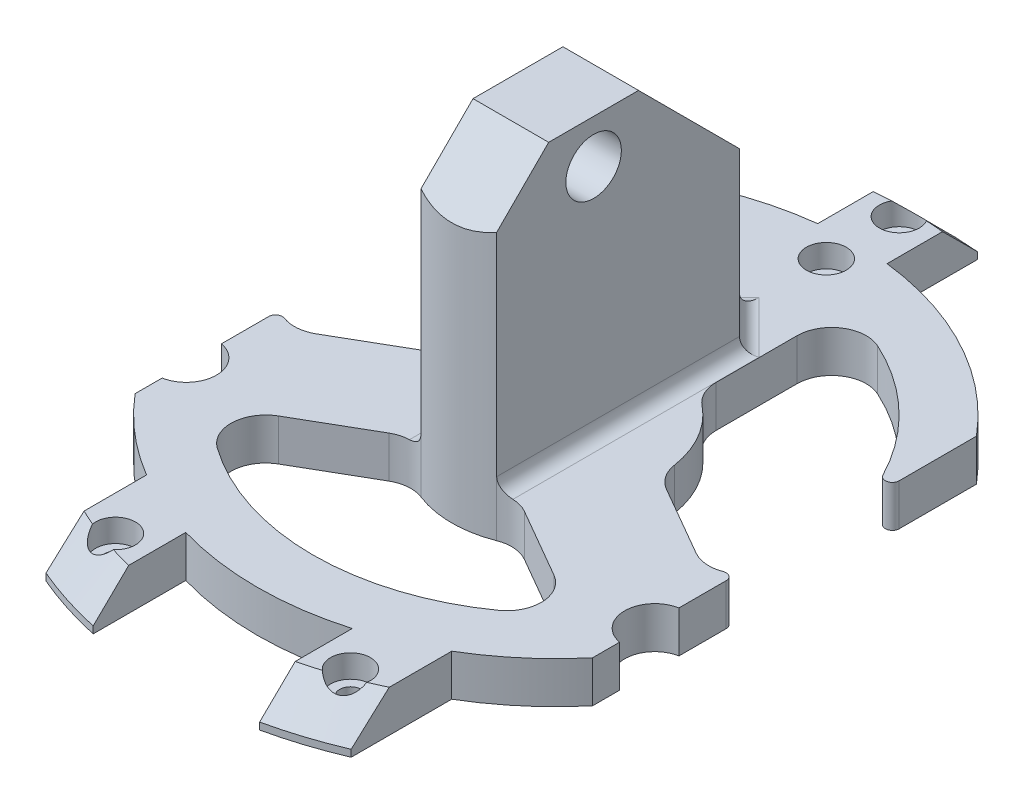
ISO-10303-21;
HEADER;
FILE_DESCRIPTION(('STEP AP214'),'2;1');
FILE_NAME('part.step','',(''),(''),'','','');
FILE_SCHEMA(('AUTOMOTIVE_DESIGN { 1 0 10303 214 1 1 1 1 }'));
ENDSEC;
DATA;
#1=APPLICATION_CONTEXT('core data for automotive mechanical design processes');
#2=APPLICATION_PROTOCOL_DEFINITION('international standard','automotive_design',2000,#1);
#3=PRODUCT_CONTEXT('',#1,'mechanical');
#4=PRODUCT('Part','Part','',(#3));
#5=PRODUCT_RELATED_PRODUCT_CATEGORY('part','',(#4));
#6=PRODUCT_DEFINITION_FORMATION('','',#4);
#7=PRODUCT_DEFINITION_CONTEXT('part definition',#1,'design');
#8=PRODUCT_DEFINITION('design','',#6,#7);
#9=PRODUCT_DEFINITION_SHAPE('','',#8);
#10=(LENGTH_UNIT() NAMED_UNIT(*) SI_UNIT(.MILLI.,.METRE.));
#11=(NAMED_UNIT(*) PLANE_ANGLE_UNIT() SI_UNIT($,.RADIAN.));
#12=(NAMED_UNIT(*) SI_UNIT($,.STERADIAN.) SOLID_ANGLE_UNIT());
#13=UNCERTAINTY_MEASURE_WITH_UNIT(LENGTH_MEASURE(1.E-05),#10,'distance_accuracy_value','');
#14=(GEOMETRIC_REPRESENTATION_CONTEXT(3) GLOBAL_UNCERTAINTY_ASSIGNED_CONTEXT((#13)) GLOBAL_UNIT_ASSIGNED_CONTEXT((#10,
#11,#12)) REPRESENTATION_CONTEXT('',''));
#15=CARTESIAN_POINT('',(0.,0.,0.));
#16=DIRECTION('',(0.,0.,1.));
#17=DIRECTION('',(1.,0.,0.));
#18=AXIS2_PLACEMENT_3D('',#15,#16,#17);
#19=CARTESIAN_POINT('',(0.,5.,0.));
#20=DIRECTION('',(0.,1.,0.));
#21=DIRECTION('',(0.,0.,1.));
#22=AXIS2_PLACEMENT_3D('',#19,#20,#21);
#23=PLANE('',#22);
#24=CARTESIAN_POINT('',(0.,5.,-49.53));
#25=DIRECTION('',(0.,1.,0.));
#26=DIRECTION('',(0.,0.,1.));
#27=AXIS2_PLACEMENT_3D('',#24,#25,#26);
#28=CIRCLE('',#27,2.875);
#29=CARTESIAN_POINT('',(-2.50641361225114,5.,-50.9383734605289));
#30=VERTEX_POINT('',#29);
#31=CARTESIAN_POINT('',(2.50641361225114,5.,-50.9383734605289));
#32=VERTEX_POINT('',#31);
#33=EDGE_CURVE('E500',#30,#32,#28,.T.);
#34=ORIENTED_EDGE('',*,*,#33,.F.);
#35=CARTESIAN_POINT('',(0.,5.,0.));
#36=DIRECTION('',(0.,-1.,0.));
#37=DIRECTION('',(0.,0.,-1.));
#38=AXIS2_PLACEMENT_3D('',#35,#36,#37);
#39=CIRCLE('',#38,50.9999999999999);
#40=CARTESIAN_POINT('',(-5.,5.,-50.754310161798));
#41=VERTEX_POINT('',#40);
#42=EDGE_CURVE('E680',#41,#30,#39,.T.);
#43=ORIENTED_EDGE('',*,*,#42,.F.);
#44=DIRECTION('',(0.,0.,1.));
#45=VECTOR('',#44,1.);
#46=CARTESIAN_POINT('',(-5.,5.,-42.7586540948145));
#47=LINE('',#46,#45);
#48=CARTESIAN_POINT('',(-5.,5.,-42.7586540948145));
#49=VERTEX_POINT('',#48);
#50=EDGE_CURVE('E734',#41,#49,#47,.T.);
#51=ORIENTED_EDGE('',*,*,#50,.T.);
#52=CARTESIAN_POINT('',(0.,5.,0.));
#53=DIRECTION('',(0.,1.,0.));
#54=DIRECTION('',(0.,0.,1.));
#55=AXIS2_PLACEMENT_3D('',#52,#53,#54);
#56=CIRCLE('',#55,43.05);
#57=CARTESIAN_POINT('',(-32.9782132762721,5.,-27.6720065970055));
#58=VERTEX_POINT('',#57);
#59=EDGE_CURVE('E756',#49,#58,#56,.T.);
#60=ORIENTED_EDGE('',*,*,#59,.T.);
#61=DIRECTION('',(0.,0.,1.));
#62=VECTOR('',#61,1.);
#63=CARTESIAN_POINT('',(-32.9782132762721,5.,-24.0561851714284));
#64=LINE('',#63,#62);
#65=CARTESIAN_POINT('',(-32.9782132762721,5.,-16.5346265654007));
#66=VERTEX_POINT('',#65);
#67=EDGE_CURVE('E580',#58,#66,#64,.T.);
#68=ORIENTED_EDGE('',*,*,#67,.T.);
#69=CARTESIAN_POINT('',(-31.9782132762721,5.,-16.5346265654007));
#70=DIRECTION('',(0.,1.,0.));
#71=DIRECTION('',(0.,0.,1.));
#72=AXIS2_PLACEMENT_3D('',#69,#70,#71);
#73=CIRCLE('',#72,1.);
#74=CARTESIAN_POINT('',(-31.0899295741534,5.,-16.0753313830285));
#75=VERTEX_POINT('',#74);
#76=EDGE_CURVE('E1296',#66,#75,#73,.T.);
#77=ORIENTED_EDGE('',*,*,#76,.T.);
#78=CARTESIAN_POINT('',(0.,5.,0.));
#79=DIRECTION('',(0.,-1.,0.));
#80=DIRECTION('',(0.,0.,1.));
#81=AXIS2_PLACEMENT_3D('',#78,#79,#80);
#82=CIRCLE('',#81,34.9999999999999);
#83=CARTESIAN_POINT('',(-14.5833333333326,5.,-31.8170770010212));
#84=VERTEX_POINT('',#83);
#85=EDGE_CURVE('E577',#75,#84,#82,.T.);
#86=ORIENTED_EDGE('',*,*,#85,.T.);
#87=CARTESIAN_POINT('',(-12.4999999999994,5.,-27.2717802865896));
#88=DIRECTION('',(0.,-1.,0.));
#89=DIRECTION('',(0.,0.,-1.));
#90=AXIS2_PLACEMENT_3D('',#87,#88,#89);
#91=CIRCLE('',#90,5.);
#92=CARTESIAN_POINT('',(-7.49999999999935,5.,-27.2717802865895));
#93=VERTEX_POINT('',#92);
#94=EDGE_CURVE('E574',#84,#93,#91,.T.);
#95=ORIENTED_EDGE('',*,*,#94,.T.);
#96=DIRECTION('',(0.,0.,1.));
#97=VECTOR('',#96,1.);
#98=CARTESIAN_POINT('',(-7.49999999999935,5.,-27.2717802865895));
#99=LINE('',#98,#97);
#100=CARTESIAN_POINT('',(-7.49999999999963,5.,-15.6124949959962));
#101=VERTEX_POINT('',#100);
#102=EDGE_CURVE('E571',#93,#101,#99,.T.);
#103=ORIENTED_EDGE('',*,*,#102,.T.);
#104=CARTESIAN_POINT('',(-12.4999999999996,5.,-15.6124949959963));
#105=DIRECTION('',(0.,-1.,0.));
#106=DIRECTION('',(0.,0.,-1.));
#107=AXIS2_PLACEMENT_3D('',#104,#105,#106);
#108=CIRCLE('',#107,5.);
#109=CARTESIAN_POINT('',(-9.37499999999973,5.,-11.7093712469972));
#110=VERTEX_POINT('',#109);
#111=EDGE_CURVE('E568',#101,#110,#108,.T.);
#112=ORIENTED_EDGE('',*,*,#111,.T.);
#113=CARTESIAN_POINT('',(0.,5.,0.));
#114=DIRECTION('',(0.,1.,0.));
#115=DIRECTION('',(0.,0.,1.));
#116=AXIS2_PLACEMENT_3D('',#113,#114,#115);
#117=CIRCLE('',#116,15.);
#118=CARTESIAN_POINT('',(-14.8281129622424,5.,-2.26430253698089));
#119=VERTEX_POINT('',#118);
#120=EDGE_CURVE('E565',#110,#119,#117,.T.);
#121=ORIENTED_EDGE('',*,*,#120,.T.);
#122=CARTESIAN_POINT('',(-19.7708172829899,5.,-3.01907004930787));
#123=DIRECTION('',(0.,-1.,0.));
#124=DIRECTION('',(0.,0.,-1.));
#125=AXIS2_PLACEMENT_3D('',#122,#123,#124);
#126=CIRCLE('',#125,5.00000000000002);
#127=CARTESIAN_POINT('',(-17.27081728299,5.,1.31105696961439));
#128=VERTEX_POINT('',#127);
#129=EDGE_CURVE('E562',#119,#128,#126,.T.);
#130=ORIENTED_EDGE('',*,*,#129,.T.);
#131=DIRECTION('',(-0.866025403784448,0.,0.499999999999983));
#132=VECTOR('',#131,1.);
#133=CARTESIAN_POINT('',(-17.27081728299,5.,1.31105696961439));
#134=LINE('',#133,#132);
#135=CARTESIAN_POINT('',(-27.3680545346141,5.,7.14069961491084));
#136=VERTEX_POINT('',#135);
#137=EDGE_CURVE('E559',#128,#136,#134,.T.);
#138=ORIENTED_EDGE('',*,*,#137,.T.);
#139=CARTESIAN_POINT('',(-29.868054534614,5.,2.81057259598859));
#140=DIRECTION('',(0.,-1.,0.));
#141=DIRECTION('',(0.,0.,1.));
#142=AXIS2_PLACEMENT_3D('',#139,#140,#141);
#143=CIRCLE('',#142,5.00000000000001);
#144=CARTESIAN_POINT('',(-31.6265201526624,5.,7.49114934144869));
#145=VERTEX_POINT('',#144);
#146=EDGE_CURVE('E531',#136,#145,#143,.T.);
#147=ORIENTED_EDGE('',*,*,#146,.T.);
#148=CARTESIAN_POINT('',(-31.9782132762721,5.,8.42726469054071));
#149=DIRECTION('',(0.,1.,0.));
#150=DIRECTION('',(0.,0.,1.));
#151=AXIS2_PLACEMENT_3D('',#148,#149,#150);
#152=CIRCLE('',#151,1.);
#153=CARTESIAN_POINT('',(-32.9782132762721,5.,8.42726469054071));
#154=VERTEX_POINT('',#153);
#155=EDGE_CURVE('E2222',#145,#154,#152,.T.);
#156=ORIENTED_EDGE('',*,*,#155,.T.);
#157=DIRECTION('',(0.,0.,1.));
#158=VECTOR('',#157,1.);
#159=CARTESIAN_POINT('',(-32.9782132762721,5.,9.99999999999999));
#160=LINE('',#159,#158);
#161=CARTESIAN_POINT('',(-32.9782132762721,5.,15.2235943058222));
#162=VERTEX_POINT('',#161);
#163=EDGE_CURVE('E584',#154,#162,#160,.T.);
#164=ORIENTED_EDGE('',*,*,#163,.T.);
#165=CARTESIAN_POINT('',(-33.7749907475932,5.,19.4999999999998));
#166=DIRECTION('',(0.,1.,0.));
#167=DIRECTION('',(0.,0.,1.));
#168=AXIS2_PLACEMENT_3D('',#165,#166,#167);
#169=CIRCLE('',#168,4.35);
#170=CARTESIAN_POINT('',(-32.9782132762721,5.,23.7764056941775));
#171=VERTEX_POINT('',#170);
#172=EDGE_CURVE('E520',#171,#162,#169,.T.);
#173=ORIENTED_EDGE('',*,*,#172,.F.);
#174=CARTESIAN_POINT('',(-32.9782132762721,5.,27.6720065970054));
#175=VERTEX_POINT('',#174);
#176=EDGE_CURVE('E583',#171,#175,#160,.T.);
#177=ORIENTED_EDGE('',*,*,#176,.T.);
#178=CARTESIAN_POINT('',(-22.,5.,37.0040876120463));
#179=VERTEX_POINT('',#178);
#180=EDGE_CURVE('E758',#175,#179,#56,.T.);
#181=ORIENTED_EDGE('',*,*,#180,.T.);
#182=DIRECTION('',(0.,0.,1.));
#183=VECTOR('',#182,1.);
#184=CARTESIAN_POINT('',(-22.,5.,51.4975727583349));
#185=LINE('',#184,#183);
#186=CARTESIAN_POINT('',(-22.,5.,46.0108682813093));
#187=VERTEX_POINT('',#186);
#188=EDGE_CURVE('E731',#179,#187,#185,.T.);
#189=ORIENTED_EDGE('',*,*,#188,.T.);
#190=CARTESIAN_POINT('',(-19.7745350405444,5.,47.0102942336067));
#191=VERTEX_POINT('',#190);
#192=EDGE_CURVE('E682',#191,#187,#39,.T.);
#193=ORIENTED_EDGE('',*,*,#192,.F.);
#194=CARTESIAN_POINT('',(-16.9385475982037,5.,46.5382770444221));
#195=DIRECTION('',(0.,1.,0.));
#196=DIRECTION('',(0.,0.,1.));
#197=AXIS2_PLACEMENT_3D('',#194,#195,#196);
#198=CIRCLE('',#197,2.875);
#199=CARTESIAN_POINT('',(-15.0694619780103,5.,48.7228007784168));
#200=VERTEX_POINT('',#199);
#201=EDGE_CURVE('E509',#200,#191,#198,.T.);
#202=ORIENTED_EDGE('',*,*,#201,.F.);
#203=CARTESIAN_POINT('',(-12.,5.,49.5681349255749));
#204=VERTEX_POINT('',#203);
#205=EDGE_CURVE('E691',#204,#200,#39,.T.);
#206=ORIENTED_EDGE('',*,*,#205,.F.);
#207=DIRECTION('',(0.,0.,-1.));
#208=VECTOR('',#207,1.);
#209=CARTESIAN_POINT('',(-12.,5.,41.3437117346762));
#210=LINE('',#209,#208);
#211=CARTESIAN_POINT('',(-12.,5.,41.3437117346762));
#212=VERTEX_POINT('',#211);
#213=EDGE_CURVE('E716',#204,#212,#210,.T.);
#214=ORIENTED_EDGE('',*,*,#213,.T.);
#215=CARTESIAN_POINT('',(12.,5.,41.3437117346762));
#216=VERTEX_POINT('',#215);
#217=EDGE_CURVE('E759',#212,#216,#56,.T.);
#218=ORIENTED_EDGE('',*,*,#217,.T.);
#219=DIRECTION('',(0.,0.,1.));
#220=VECTOR('',#219,1.);
#221=CARTESIAN_POINT('',(12.,5.,41.3437117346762));
#222=LINE('',#221,#220);
#223=CARTESIAN_POINT('',(12.,5.,49.5681349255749));
#224=VERTEX_POINT('',#223);
#225=EDGE_CURVE('E744',#216,#224,#222,.T.);
#226=ORIENTED_EDGE('',*,*,#225,.T.);
#227=CARTESIAN_POINT('',(15.0694619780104,5.,48.7228007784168));
#228=VERTEX_POINT('',#227);
#229=EDGE_CURVE('E683',#228,#224,#39,.T.);
#230=ORIENTED_EDGE('',*,*,#229,.F.);
#231=CARTESIAN_POINT('',(16.9385475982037,5.,46.5382770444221));
#232=DIRECTION('',(0.,1.,0.));
#233=DIRECTION('',(0.,0.,1.));
#234=AXIS2_PLACEMENT_3D('',#231,#232,#233);
#235=CIRCLE('',#234,2.875);
#236=CARTESIAN_POINT('',(19.7745350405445,5.,47.0102942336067));
#237=VERTEX_POINT('',#236);
#238=EDGE_CURVE('E515',#237,#228,#235,.T.);
#239=ORIENTED_EDGE('',*,*,#238,.F.);
#240=CARTESIAN_POINT('',(22.,5.,46.0108682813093));
#241=VERTEX_POINT('',#240);
#242=EDGE_CURVE('E684',#241,#237,#39,.T.);
#243=ORIENTED_EDGE('',*,*,#242,.F.);
#244=DIRECTION('',(0.,0.,-1.));
#245=VECTOR('',#244,1.);
#246=CARTESIAN_POINT('',(22.,5.,51.4975727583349));
#247=LINE('',#246,#245);
#248=CARTESIAN_POINT('',(22.,5.,37.0040876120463));
#249=VERTEX_POINT('',#248);
#250=EDGE_CURVE('E779',#241,#249,#247,.T.);
#251=ORIENTED_EDGE('',*,*,#250,.T.);
#252=CARTESIAN_POINT('',(32.9782132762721,5.,27.6720065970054));
#253=VERTEX_POINT('',#252);
#254=EDGE_CURVE('E765',#249,#253,#56,.T.);
#255=ORIENTED_EDGE('',*,*,#254,.T.);
#256=DIRECTION('',(0.,0.,-1.));
#257=VECTOR('',#256,1.);
#258=CARTESIAN_POINT('',(32.9782132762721,5.,27.6720065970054));
#259=LINE('',#258,#257);
#260=CARTESIAN_POINT('',(32.9782132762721,5.,23.7764056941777));
#261=VERTEX_POINT('',#260);
#262=EDGE_CURVE('E623',#253,#261,#259,.T.);
#263=ORIENTED_EDGE('',*,*,#262,.T.);
#264=CARTESIAN_POINT('',(33.7749907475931,5.,19.5));
#265=DIRECTION('',(0.,1.,0.));
#266=DIRECTION('',(0.,0.,1.));
#267=AXIS2_PLACEMENT_3D('',#264,#265,#266);
#268=CIRCLE('',#267,4.35);
#269=CARTESIAN_POINT('',(32.9782132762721,5.,15.2235943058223));
#270=VERTEX_POINT('',#269);
#271=EDGE_CURVE('E524',#270,#261,#268,.T.);
#272=ORIENTED_EDGE('',*,*,#271,.F.);
#273=CARTESIAN_POINT('',(32.9782132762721,5.,8.42726469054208));
#274=VERTEX_POINT('',#273);
#275=EDGE_CURVE('E622',#270,#274,#259,.T.);
#276=ORIENTED_EDGE('',*,*,#275,.T.);
#277=CARTESIAN_POINT('',(31.9782132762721,5.,8.42726469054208));
#278=DIRECTION('',(0.,1.,0.));
#279=DIRECTION('',(0.,0.,1.));
#280=AXIS2_PLACEMENT_3D('',#277,#278,#279);
#281=CIRCLE('',#280,1.);
#282=CARTESIAN_POINT('',(31.6265201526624,5.,7.49114934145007));
#283=VERTEX_POINT('',#282);
#284=EDGE_CURVE('E2228',#274,#283,#281,.T.);
#285=ORIENTED_EDGE('',*,*,#284,.T.);
#286=CARTESIAN_POINT('',(29.8680545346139,5.,2.81057259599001));
#287=DIRECTION('',(0.,-1.,0.));
#288=DIRECTION('',(0.,0.,-1.));
#289=AXIS2_PLACEMENT_3D('',#286,#287,#288);
#290=CIRCLE('',#289,5.00000000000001);
#291=CARTESIAN_POINT('',(27.3680545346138,5.,7.14069961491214));
#292=VERTEX_POINT('',#291);
#293=EDGE_CURVE('E619',#283,#292,#290,.T.);
#294=ORIENTED_EDGE('',*,*,#293,.T.);
#295=DIRECTION('',(-0.866025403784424,0.,-0.500000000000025));
#296=VECTOR('',#295,1.);
#297=CARTESIAN_POINT('',(27.3680545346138,5.,7.14069961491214));
#298=LINE('',#297,#296);
#299=CARTESIAN_POINT('',(17.2708172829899,5.,1.31105696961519));
#300=VERTEX_POINT('',#299);
#301=EDGE_CURVE('E616',#292,#300,#298,.T.);
#302=ORIENTED_EDGE('',*,*,#301,.T.);
#303=CARTESIAN_POINT('',(19.77081728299,5.,-3.01907004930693));
#304=DIRECTION('',(0.,-1.,0.));
#305=DIRECTION('',(0.,0.,-1.));
#306=AXIS2_PLACEMENT_3D('',#303,#304,#305);
#307=CIRCLE('',#306,5.);
#308=CARTESIAN_POINT('',(14.8281129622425,5.,-2.2643025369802));
#309=VERTEX_POINT('',#308);
#310=EDGE_CURVE('E590',#300,#309,#307,.T.);
#311=ORIENTED_EDGE('',*,*,#310,.T.);
#312=CARTESIAN_POINT('',(0.,5.,0.));
#313=DIRECTION('',(0.,1.,0.));
#314=DIRECTION('',(0.,0.,1.));
#315=AXIS2_PLACEMENT_3D('',#312,#313,#314);
#316=CIRCLE('',#315,15.);
#317=CARTESIAN_POINT('',(9.37500000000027,5.,-11.7093712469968));
#318=VERTEX_POINT('',#317);
#319=EDGE_CURVE('E556',#309,#318,#316,.T.);
#320=ORIENTED_EDGE('',*,*,#319,.T.);
#321=CARTESIAN_POINT('',(12.5000000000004,5.,-15.6124949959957));
#322=DIRECTION('',(0.,-1.,0.));
#323=DIRECTION('',(0.,0.,-1.));
#324=AXIS2_PLACEMENT_3D('',#321,#322,#323);
#325=CIRCLE('',#324,5.00000000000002);
#326=CARTESIAN_POINT('',(7.50000000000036,5.,-15.6124949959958));
#327=VERTEX_POINT('',#326);
#328=EDGE_CURVE('E638',#318,#327,#325,.T.);
#329=ORIENTED_EDGE('',*,*,#328,.T.);
#330=DIRECTION('',(0.,0.,-1.));
#331=VECTOR('',#330,1.);
#332=CARTESIAN_POINT('',(7.50000000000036,5.,-15.6124949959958));
#333=LINE('',#332,#331);
#334=CARTESIAN_POINT('',(7.50000000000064,5.,-27.2717802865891));
#335=VERTEX_POINT('',#334);
#336=EDGE_CURVE('E635',#327,#335,#333,.T.);
#337=ORIENTED_EDGE('',*,*,#336,.T.);
#338=CARTESIAN_POINT('',(12.5000000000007,5.,-27.271780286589));
#339=DIRECTION('',(0.,-1.,0.));
#340=DIRECTION('',(0.,0.,1.));
#341=AXIS2_PLACEMENT_3D('',#338,#339,#340);
#342=CIRCLE('',#341,5.00000000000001);
#343=CARTESIAN_POINT('',(14.5833333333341,5.,-31.8170770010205));
#344=VERTEX_POINT('',#343);
#345=EDGE_CURVE('E632',#335,#344,#342,.T.);
#346=ORIENTED_EDGE('',*,*,#345,.T.);
#347=CARTESIAN_POINT('',(0.,5.,0.));
#348=DIRECTION('',(0.,-1.,0.));
#349=DIRECTION('',(0.,0.,1.));
#350=AXIS2_PLACEMENT_3D('',#347,#348,#349);
#351=CIRCLE('',#350,35.);
#352=CARTESIAN_POINT('',(31.0899295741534,5.,-16.0753313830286));
#353=VERTEX_POINT('',#352);
#354=EDGE_CURVE('E629',#344,#353,#351,.T.);
#355=ORIENTED_EDGE('',*,*,#354,.T.);
#356=CARTESIAN_POINT('',(31.9782132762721,5.,-16.5346265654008));
#357=DIRECTION('',(0.,1.,0.));
#358=DIRECTION('',(0.,0.,1.));
#359=AXIS2_PLACEMENT_3D('',#356,#357,#358);
#360=CIRCLE('',#359,1.);
#361=CARTESIAN_POINT('',(32.9782132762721,5.,-16.5346265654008));
#362=VERTEX_POINT('',#361);
#363=EDGE_CURVE('E2230',#353,#362,#360,.T.);
#364=ORIENTED_EDGE('',*,*,#363,.T.);
#365=DIRECTION('',(0.,0.,-1.));
#366=VECTOR('',#365,1.);
#367=CARTESIAN_POINT('',(32.9782132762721,5.,-11.7233719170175));
#368=LINE('',#367,#366);
#369=CARTESIAN_POINT('',(32.9782132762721,5.,-27.6720065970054));
#370=VERTEX_POINT('',#369);
#371=EDGE_CURVE('E626',#362,#370,#368,.T.);
#372=ORIENTED_EDGE('',*,*,#371,.T.);
#373=CARTESIAN_POINT('',(5.,5.,-42.7586540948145));
#374=VERTEX_POINT('',#373);
#375=EDGE_CURVE('E747',#370,#374,#56,.T.);
#376=ORIENTED_EDGE('',*,*,#375,.T.);
#377=DIRECTION('',(0.,0.,-1.));
#378=VECTOR('',#377,1.);
#379=CARTESIAN_POINT('',(5.,5.,-42.7586540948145));
#380=LINE('',#379,#378);
#381=CARTESIAN_POINT('',(5.,5.,-50.754310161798));
#382=VERTEX_POINT('',#381);
#383=EDGE_CURVE('E730',#374,#382,#380,.T.);
#384=ORIENTED_EDGE('',*,*,#383,.T.);
#385=EDGE_CURVE('E664',#32,#382,#39,.T.);
#386=ORIENTED_EDGE('',*,*,#385,.F.);
#387=EDGE_LOOP('',(#34,#43,#51,#60,#68,#77,#86,#95,#103,#112,#121,#130,#138,#147,#156,#164,#173,
#177,#181,#189,#193,#202,#206,#214,#218,#226,#230,#239,#243,#251,#255,#263,#272,#276,#285,#294,
#302,#311,#320,#329,#337,#346,#355,#364,#372,#376,#384,#386));
#388=FACE_BOUND('',#387,.T.);
#389=CARTESIAN_POINT('',(0.,5.,-39.));
#390=DIRECTION('',(0.,1.,0.));
#391=DIRECTION('',(0.,0.,1.));
#392=AXIS2_PLACEMENT_3D('',#389,#390,#391);
#393=CIRCLE('',#392,2.875);
#394=CARTESIAN_POINT('',(0.,5.,-36.125));
#395=VERTEX_POINT('',#394);
#396=EDGE_CURVE('E503',#395,#395,#393,.T.);
#397=ORIENTED_EDGE('',*,*,#396,.F.);
#398=EDGE_LOOP('',(#397));
#399=FACE_BOUND('',#398,.T.);
#400=CARTESIAN_POINT('',(-7.27081728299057,5.,18.6315650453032));
#401=DIRECTION('',(0.,-1.,0.));
#402=DIRECTION('',(0.,0.,-1.));
#403=AXIS2_PLACEMENT_3D('',#400,#401,#402);
#404=CIRCLE('',#403,5.);
#405=CARTESIAN_POINT('',(-9.77081728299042,5.,14.301438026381));
#406=VERTEX_POINT('',#405);
#407=CARTESIAN_POINT('',(-7.45311296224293,5.,13.6348893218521));
#408=VERTEX_POINT('',#407);
#409=EDGE_CURVE('E114',#406,#408,#404,.T.);
#410=ORIENTED_EDGE('',*,*,#409,.T.);
#411=DIRECTION('',(0.,0.,1.));
#412=VECTOR('',#411,1.);
#413=CARTESIAN_POINT('',(-7.45311296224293,5.,0.));
#414=LINE('',#413,#412);
#415=CARTESIAN_POINT('',(-7.45311296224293,5.,-21.8547533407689));
#416=VERTEX_POINT('',#415);
#417=EDGE_CURVE('E108',#408,#416,#414,.F.);
#418=ORIENTED_EDGE('',*,*,#417,.T.);
#419=DIRECTION('',(-0.707106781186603,0.,0.707106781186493));
#420=VECTOR('',#419,1.);
#421=CARTESIAN_POINT('',(-14.6539331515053,5.,-14.6539331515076));
#422=LINE('',#421,#420);
#423=CARTESIAN_POINT('',(2.21906770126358E-13,5.,-29.3078663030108));
#424=VERTEX_POINT('',#423);
#425=EDGE_CURVE('E110',#416,#424,#422,.F.);
#426=ORIENTED_EDGE('',*,*,#425,.T.);
#427=DIRECTION('',(-0.707106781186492,0.,-0.707106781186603));
#428=VECTOR('',#427,1.);
#429=CARTESIAN_POINT('',(14.6539331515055,5.,-14.6539331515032));
#430=LINE('',#429,#428);
#431=CARTESIAN_POINT('',(7.45311296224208,5.,-21.8547533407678));
#432=VERTEX_POINT('',#431);
#433=EDGE_CURVE('E128',#424,#432,#430,.F.);
#434=ORIENTED_EDGE('',*,*,#433,.T.);
#435=DIRECTION('',(0.,0.,-1.));
#436=VECTOR('',#435,1.);
#437=CARTESIAN_POINT('',(7.45311296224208,5.,0.));
#438=LINE('',#437,#436);
#439=CARTESIAN_POINT('',(7.45311296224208,5.,13.6348893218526));
#440=VERTEX_POINT('',#439);
#441=EDGE_CURVE('E2305',#432,#440,#438,.F.);
#442=ORIENTED_EDGE('',*,*,#441,.T.);
#443=CARTESIAN_POINT('',(7.27081728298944,5.,18.6315650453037));
#444=DIRECTION('',(0.,-1.,0.));
#445=DIRECTION('',(0.,0.,-1.));
#446=AXIS2_PLACEMENT_3D('',#443,#444,#445);
#447=CIRCLE('',#446,5.00000000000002);
#448=CARTESIAN_POINT('',(9.77081728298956,5.,14.3014380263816));
#449=VERTEX_POINT('',#448);
#450=EDGE_CURVE('E644',#440,#449,#447,.T.);
#451=ORIENTED_EDGE('',*,*,#450,.T.);
#452=DIRECTION('',(0.866025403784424,0.,0.500000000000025));
#453=VECTOR('',#452,1.);
#454=CARTESIAN_POINT('',(9.77081728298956,5.,14.3014380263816));
#455=LINE('',#454,#453);
#456=CARTESIAN_POINT('',(19.8680545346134,5.,20.1310806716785));
#457=VERTEX_POINT('',#456);
#458=EDGE_CURVE('E647',#449,#457,#455,.T.);
#459=ORIENTED_EDGE('',*,*,#458,.T.);
#460=CARTESIAN_POINT('',(17.3680545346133,5.,24.4612076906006));
#461=DIRECTION('',(0.,-1.,0.));
#462=DIRECTION('',(0.,0.,1.));
#463=AXIS2_PLACEMENT_3D('',#460,#461,#462);
#464=CIRCLE('',#463,5.00000000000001);
#465=CARTESIAN_POINT('',(20.2627302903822,5.,28.5380756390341));
#466=VERTEX_POINT('',#465);
#467=EDGE_CURVE('E650',#457,#466,#464,.T.);
#468=ORIENTED_EDGE('',*,*,#467,.T.);
#469=CARTESIAN_POINT('',(0.,5.,0.));
#470=DIRECTION('',(0.,-1.,0.));
#471=DIRECTION('',(0.,0.,1.));
#472=AXIS2_PLACEMENT_3D('',#469,#470,#471);
#473=CIRCLE('',#472,35.0000000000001);
#474=CARTESIAN_POINT('',(-20.2627302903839,5.,28.5380756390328));
#475=VERTEX_POINT('',#474);
#476=EDGE_CURVE('E653',#466,#475,#473,.T.);
#477=ORIENTED_EDGE('',*,*,#476,.T.);
#478=CARTESIAN_POINT('',(-17.3680545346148,5.,24.4612076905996));
#479=DIRECTION('',(0.,-1.,0.));
#480=DIRECTION('',(0.,0.,-1.));
#481=AXIS2_PLACEMENT_3D('',#478,#479,#480);
#482=CIRCLE('',#481,4.99999999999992);
#483=CARTESIAN_POINT('',(-19.8680545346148,5.,20.1310806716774));
#484=VERTEX_POINT('',#483);
#485=EDGE_CURVE('E656',#475,#484,#482,.T.);
#486=ORIENTED_EDGE('',*,*,#485,.T.);
#487=DIRECTION('',(0.866025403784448,0.,-0.499999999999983));
#488=VECTOR('',#487,1.);
#489=CARTESIAN_POINT('',(-19.8680545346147,5.,20.1310806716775));
#490=LINE('',#489,#488);
#491=EDGE_CURVE('E659',#484,#406,#490,.T.);
#492=ORIENTED_EDGE('',*,*,#491,.T.);
#493=EDGE_LOOP('',(#410,#418,#426,#434,#442,#451,#459,#468,#477,#486,#492));
#494=FACE_BOUND('',#493,.T.);
#495=ADVANCED_FACE('F36',(#388,#399,#494),#23,.T.);
#496=CARTESIAN_POINT('',(0.,0.,-49.53));
#497=DIRECTION('',(0.,1.,0.));
#498=DIRECTION('',(0.,0.,1.));
#499=AXIS2_PLACEMENT_3D('',#496,#497,#498);
#500=CYLINDRICAL_SURFACE('',#499,1.54999999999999);
#501=CARTESIAN_POINT('',(0.,1.7,-49.53));
#502=DIRECTION('',(0.,1.,0.));
#503=DIRECTION('',(0.,0.,1.));
#504=AXIS2_PLACEMENT_3D('',#501,#502,#503);
#505=CIRCLE('',#504,1.54999999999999);
#506=CARTESIAN_POINT('',(0.,1.7,-47.98));
#507=VERTEX_POINT('',#506);
#508=EDGE_CURVE('E527',#507,#507,#505,.F.);
#509=ORIENTED_EDGE('',*,*,#508,.F.);
#510=EDGE_LOOP('',(#509));
#511=FACE_BOUND('',#510,.T.);
#512=CARTESIAN_POINT('',(0.,-1.,-49.53));
#513=DIRECTION('',(0.,-1.,0.));
#514=DIRECTION('',(0.,0.,-1.));
#515=AXIS2_PLACEMENT_3D('',#512,#513,#514);
#516=CIRCLE('',#515,1.54999999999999);
#517=CARTESIAN_POINT('',(0.,-1.,-51.08));
#518=VERTEX_POINT('',#517);
#519=EDGE_CURVE('E1026',#518,#518,#516,.T.);
#520=ORIENTED_EDGE('',*,*,#519,.T.);
#521=EDGE_LOOP('',(#520));
#522=FACE_BOUND('',#521,.T.);
#523=ADVANCED_FACE('F275',(#511,#522),#500,.F.);
#524=CARTESIAN_POINT('',(-16.9385475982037,0.,46.5382770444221));
#525=DIRECTION('',(0.,1.,0.));
#526=DIRECTION('',(0.,0.,1.));
#527=AXIS2_PLACEMENT_3D('',#524,#525,#526);
#528=CYLINDRICAL_SURFACE('',#527,1.55);
#529=CARTESIAN_POINT('',(-16.9385475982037,1.7,46.5382770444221));
#530=DIRECTION('',(0.,1.,0.));
#531=DIRECTION('',(0.,0.,1.));
#532=AXIS2_PLACEMENT_3D('',#529,#530,#531);
#533=CIRCLE('',#532,1.55);
#534=CARTESIAN_POINT('',(-16.9385475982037,1.7,48.0882770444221));
#535=VERTEX_POINT('',#534);
#536=EDGE_CURVE('E1317',#535,#535,#533,.F.);
#537=ORIENTED_EDGE('',*,*,#536,.F.);
#538=EDGE_LOOP('',(#537));
#539=FACE_BOUND('',#538,.T.);
#540=CARTESIAN_POINT('',(-16.9385475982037,-1.,46.5382770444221));
#541=DIRECTION('',(0.,-1.,0.));
#542=DIRECTION('',(0.,0.,-1.));
#543=AXIS2_PLACEMENT_3D('',#540,#541,#542);
#544=CIRCLE('',#543,1.55);
#545=CARTESIAN_POINT('',(-16.9385475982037,-1.,44.9882770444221));
#546=VERTEX_POINT('',#545);
#547=EDGE_CURVE('E1035',#546,#546,#544,.T.);
#548=ORIENTED_EDGE('',*,*,#547,.T.);
#549=EDGE_LOOP('',(#548));
#550=FACE_BOUND('',#549,.T.);
#551=ADVANCED_FACE('F278',(#539,#550),#528,.F.);
#552=CARTESIAN_POINT('',(16.9385475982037,0.,46.5382770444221));
#553=DIRECTION('',(0.,1.,0.));
#554=DIRECTION('',(0.,0.,1.));
#555=AXIS2_PLACEMENT_3D('',#552,#553,#554);
#556=CYLINDRICAL_SURFACE('',#555,1.55);
#557=CARTESIAN_POINT('',(16.9385475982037,1.7,46.5382770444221));
#558=DIRECTION('',(0.,1.,0.));
#559=DIRECTION('',(0.,0.,1.));
#560=AXIS2_PLACEMENT_3D('',#557,#558,#559);
#561=CIRCLE('',#560,1.55);
#562=CARTESIAN_POINT('',(16.9385475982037,1.7,48.0882770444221));
#563=VERTEX_POINT('',#562);
#564=EDGE_CURVE('E1314',#563,#563,#561,.F.);
#565=ORIENTED_EDGE('',*,*,#564,.F.);
#566=EDGE_LOOP('',(#565));
#567=FACE_BOUND('',#566,.T.);
#568=CARTESIAN_POINT('',(16.9385475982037,-1.,46.5382770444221));
#569=DIRECTION('',(0.,-1.,0.));
#570=DIRECTION('',(0.,0.,-1.));
#571=AXIS2_PLACEMENT_3D('',#568,#569,#570);
#572=CIRCLE('',#571,1.55);
#573=CARTESIAN_POINT('',(16.9385475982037,-1.,44.9882770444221));
#574=VERTEX_POINT('',#573);
#575=EDGE_CURVE('E1032',#574,#574,#572,.T.);
#576=ORIENTED_EDGE('',*,*,#575,.T.);
#577=EDGE_LOOP('',(#576));
#578=FACE_BOUND('',#577,.T.);
#579=ADVANCED_FACE('F282',(#567,#578),#556,.F.);
#580=CARTESIAN_POINT('',(0.,0.,-39.));
#581=DIRECTION('',(0.,1.,0.));
#582=DIRECTION('',(0.,0.,1.));
#583=AXIS2_PLACEMENT_3D('',#580,#581,#582);
#584=CYLINDRICAL_SURFACE('',#583,1.55);
#585=CARTESIAN_POINT('',(0.,1.7,-39.));
#586=DIRECTION('',(0.,1.,0.));
#587=DIRECTION('',(0.,0.,1.));
#588=AXIS2_PLACEMENT_3D('',#585,#586,#587);
#589=CIRCLE('',#588,1.55);
#590=CARTESIAN_POINT('',(0.,1.7,-37.45));
#591=VERTEX_POINT('',#590);
#592=EDGE_CURVE('E499',#591,#591,#589,.F.);
#593=ORIENTED_EDGE('',*,*,#592,.F.);
#594=EDGE_LOOP('',(#593));
#595=FACE_BOUND('',#594,.T.);
#596=CARTESIAN_POINT('',(0.,-1.,-39.));
#597=DIRECTION('',(0.,-1.,0.));
#598=DIRECTION('',(0.,0.,-1.));
#599=AXIS2_PLACEMENT_3D('',#596,#597,#598);
#600=CIRCLE('',#599,1.55);
#601=CARTESIAN_POINT('',(0.,-1.,-40.55));
#602=VERTEX_POINT('',#601);
#603=EDGE_CURVE('E1029',#602,#602,#600,.T.);
#604=ORIENTED_EDGE('',*,*,#603,.T.);
#605=EDGE_LOOP('',(#604));
#606=FACE_BOUND('',#605,.T.);
#607=ADVANCED_FACE('F286',(#595,#606),#584,.F.);
#608=CARTESIAN_POINT('',(-32.9782132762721,5.,24.0561851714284));
#609=DIRECTION('',(1.,0.,0.));
#610=DIRECTION('',(0.,0.,-1.));
#611=AXIS2_PLACEMENT_3D('',#608,#609,#610);
#612=PLANE('',#611);
#613=DIRECTION('',(0.,-1.,0.));
#614=VECTOR('',#613,1.);
#615=CARTESIAN_POINT('',(-32.9782132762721,5.,8.42726469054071));
#616=LINE('',#615,#614);
#617=CARTESIAN_POINT('',(-32.9782132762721,-1.,8.42726469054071));
#618=VERTEX_POINT('',#617);
#619=EDGE_CURVE('E2215',#154,#618,#616,.T.);
#620=ORIENTED_EDGE('',*,*,#619,.T.);
#621=DIRECTION('',(0.,0.,-1.));
#622=VECTOR('',#621,1.);
#623=CARTESIAN_POINT('',(-32.9782132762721,-1.,15.2235943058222));
#624=LINE('',#623,#622);
#625=CARTESIAN_POINT('',(-32.9782132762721,-1.,15.2235943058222));
#626=VERTEX_POINT('',#625);
#627=EDGE_CURVE('E1016',#626,#618,#624,.T.);
#628=ORIENTED_EDGE('',*,*,#627,.F.);
#629=DIRECTION('',(0.,1.,0.));
#630=VECTOR('',#629,1.);
#631=CARTESIAN_POINT('',(-32.9782132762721,0.,15.2235943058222));
#632=LINE('',#631,#630);
#633=EDGE_CURVE('E1309',#626,#162,#632,.T.);
#634=ORIENTED_EDGE('',*,*,#633,.T.);
#635=ORIENTED_EDGE('',*,*,#163,.F.);
#636=EDGE_LOOP('',(#620,#628,#634,#635));
#637=FACE_BOUND('',#636,.T.);
#638=ADVANCED_FACE('F290',(#637),#612,.F.);
#639=CARTESIAN_POINT('',(32.9782132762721,5.,27.6720065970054));
#640=DIRECTION('',(-1.,0.,0.));
#641=DIRECTION('',(0.,0.,1.));
#642=AXIS2_PLACEMENT_3D('',#639,#640,#641);
#643=PLANE('',#642);
#644=DIRECTION('',(0.,-1.,0.));
#645=VECTOR('',#644,1.);
#646=CARTESIAN_POINT('',(32.9782132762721,5.,27.6720065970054));
#647=LINE('',#646,#645);
#648=CARTESIAN_POINT('',(32.9782132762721,-1.,27.6720065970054));
#649=VERTEX_POINT('',#648);
#650=EDGE_CURVE('E603',#253,#649,#647,.T.);
#651=ORIENTED_EDGE('',*,*,#650,.T.);
#652=DIRECTION('',(0.,0.,1.));
#653=VECTOR('',#652,1.);
#654=CARTESIAN_POINT('',(32.9782132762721,-1.,23.7764056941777));
#655=LINE('',#654,#653);
#656=CARTESIAN_POINT('',(32.9782132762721,-1.,23.7764056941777));
#657=VERTEX_POINT('',#656);
#658=EDGE_CURVE('E926',#657,#649,#655,.T.);
#659=ORIENTED_EDGE('',*,*,#658,.F.);
#660=DIRECTION('',(0.,1.,0.));
#661=VECTOR('',#660,1.);
#662=CARTESIAN_POINT('',(32.9782132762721,0.,23.7764056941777));
#663=LINE('',#662,#661);
#664=EDGE_CURVE('E1299',#657,#261,#663,.T.);
#665=ORIENTED_EDGE('',*,*,#664,.T.);
#666=ORIENTED_EDGE('',*,*,#262,.F.);
#667=EDGE_LOOP('',(#651,#659,#665,#666));
#668=FACE_BOUND('',#667,.T.);
#669=ADVANCED_FACE('F371',(#668),#643,.F.);
#670=CARTESIAN_POINT('',(0.,5.,0.));
#671=DIRECTION('',(0.,-1.,0.));
#672=DIRECTION('',(0.,0.,-1.));
#673=AXIS2_PLACEMENT_3D('',#670,#671,#672);
#674=CYLINDRICAL_SURFACE('',#673,43.05);
#675=DIRECTION('',(0.,1.,0.));
#676=VECTOR('',#675,1.);
#677=CARTESIAN_POINT('',(22.,-20.3252601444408,37.0040876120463));
#678=LINE('',#677,#676);
#679=CARTESIAN_POINT('',(22.,-1.,37.0040876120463));
#680=VERTEX_POINT('',#679);
#681=EDGE_CURVE('E789',#680,#249,#678,.T.);
#682=ORIENTED_EDGE('',*,*,#681,.F.);
#683=CARTESIAN_POINT('',(0.,-1.,0.));
#684=DIRECTION('',(0.,-1.,0.));
#685=DIRECTION('',(0.,0.,-1.));
#686=AXIS2_PLACEMENT_3D('',#683,#684,#685);
#687=CIRCLE('',#686,43.05);
#688=EDGE_CURVE('E924',#649,#680,#687,.T.);
#689=ORIENTED_EDGE('',*,*,#688,.F.);
#690=ORIENTED_EDGE('',*,*,#650,.F.);
#691=ORIENTED_EDGE('',*,*,#254,.F.);
#692=EDGE_LOOP('',(#682,#689,#690,#691));
#693=FACE_BOUND('',#692,.T.);
#694=ADVANCED_FACE('F416',(#693),#674,.T.);
#695=DIRECTION('',(0.,1.,0.));
#696=VECTOR('',#695,1.);
#697=CARTESIAN_POINT('',(-5.,-20.3252601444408,-42.7586540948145));
#698=LINE('',#697,#696);
#699=CARTESIAN_POINT('',(-5.,-1.,-42.7586540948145));
#700=VERTEX_POINT('',#699);
#701=EDGE_CURVE('E748',#700,#49,#698,.T.);
#702=ORIENTED_EDGE('',*,*,#701,.F.);
#703=CARTESIAN_POINT('',(0.,-1.,0.));
#704=DIRECTION('',(0.,-1.,0.));
#705=DIRECTION('',(0.,0.,-1.));
#706=AXIS2_PLACEMENT_3D('',#703,#704,#705);
#707=CIRCLE('',#706,43.05);
#708=CARTESIAN_POINT('',(-32.9782132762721,-1.,-27.6720065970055));
#709=VERTEX_POINT('',#708);
#710=EDGE_CURVE('E980',#709,#700,#707,.T.);
#711=ORIENTED_EDGE('',*,*,#710,.F.);
#712=DIRECTION('',(0.,-1.,0.));
#713=VECTOR('',#712,1.);
#714=CARTESIAN_POINT('',(-32.9782132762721,5.,-27.6720065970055));
#715=LINE('',#714,#713);
#716=EDGE_CURVE('E532',#58,#709,#715,.T.);
#717=ORIENTED_EDGE('',*,*,#716,.F.);
#718=ORIENTED_EDGE('',*,*,#59,.F.);
#719=EDGE_LOOP('',(#702,#711,#717,#718));
#720=FACE_BOUND('',#719,.T.);
#721=ADVANCED_FACE('F1287',(#720),#674,.T.);
#722=ORIENTED_EDGE('',*,*,#375,.F.);
#723=DIRECTION('',(0.,-1.,0.));
#724=VECTOR('',#723,1.);
#725=CARTESIAN_POINT('',(32.9782132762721,5.,-27.6720065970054));
#726=LINE('',#725,#724);
#727=CARTESIAN_POINT('',(32.9782132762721,-1.,-27.6720065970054));
#728=VERTEX_POINT('',#727);
#729=EDGE_CURVE('E600',#370,#728,#726,.T.);
#730=ORIENTED_EDGE('',*,*,#729,.T.);
#731=CARTESIAN_POINT('',(0.,-1.,0.));
#732=DIRECTION('',(0.,-1.,0.));
#733=DIRECTION('',(0.,0.,-1.));
#734=AXIS2_PLACEMENT_3D('',#731,#732,#733);
#735=CIRCLE('',#734,43.05);
#736=CARTESIAN_POINT('',(5.,-1.,-42.7586540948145));
#737=VERTEX_POINT('',#736);
#738=EDGE_CURVE('E968',#737,#728,#735,.T.);
#739=ORIENTED_EDGE('',*,*,#738,.F.);
#740=DIRECTION('',(0.,1.,0.));
#741=VECTOR('',#740,1.);
#742=CARTESIAN_POINT('',(5.,-20.3252601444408,-42.7586540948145));
#743=LINE('',#742,#741);
#744=EDGE_CURVE('E752',#737,#374,#743,.T.);
#745=ORIENTED_EDGE('',*,*,#744,.T.);
#746=EDGE_LOOP('',(#722,#730,#739,#745));
#747=FACE_BOUND('',#746,.T.);
#748=ADVANCED_FACE('F1632',(#747),#674,.T.);
#749=ORIENTED_EDGE('',*,*,#180,.F.);
#750=DIRECTION('',(0.,-1.,0.));
#751=VECTOR('',#750,1.);
#752=CARTESIAN_POINT('',(-32.9782132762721,5.,27.6720065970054));
#753=LINE('',#752,#751);
#754=CARTESIAN_POINT('',(-32.9782132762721,-1.,27.6720065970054));
#755=VERTEX_POINT('',#754);
#756=EDGE_CURVE('E528',#175,#755,#753,.T.);
#757=ORIENTED_EDGE('',*,*,#756,.T.);
#758=CARTESIAN_POINT('',(0.,-1.,0.));
#759=DIRECTION('',(0.,-1.,0.));
#760=DIRECTION('',(0.,0.,-1.));
#761=AXIS2_PLACEMENT_3D('',#758,#759,#760);
#762=CIRCLE('',#761,43.0500000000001);
#763=CARTESIAN_POINT('',(-22.,-1.,37.0040876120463));
#764=VERTEX_POINT('',#763);
#765=EDGE_CURVE('E819',#764,#755,#762,.T.);
#766=ORIENTED_EDGE('',*,*,#765,.F.);
#767=DIRECTION('',(0.,1.,0.));
#768=VECTOR('',#767,1.);
#769=CARTESIAN_POINT('',(-22.,-20.3252601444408,37.0040876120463));
#770=LINE('',#769,#768);
#771=EDGE_CURVE('E743',#764,#179,#770,.T.);
#772=ORIENTED_EDGE('',*,*,#771,.T.);
#773=EDGE_LOOP('',(#749,#757,#766,#772));
#774=FACE_BOUND('',#773,.T.);
#775=ADVANCED_FACE('F414',(#774),#674,.T.);
#776=DIRECTION('',(0.,1.,0.));
#777=VECTOR('',#776,1.);
#778=CARTESIAN_POINT('',(-12.,-20.3252601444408,41.3437117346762));
#779=LINE('',#778,#777);
#780=CARTESIAN_POINT('',(-12.,-1.,41.3437117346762));
#781=VERTEX_POINT('',#780);
#782=EDGE_CURVE('E729',#781,#212,#779,.T.);
#783=ORIENTED_EDGE('',*,*,#782,.F.);
#784=CARTESIAN_POINT('',(0.,-1.,0.));
#785=DIRECTION('',(0.,-1.,0.));
#786=DIRECTION('',(0.,0.,-1.));
#787=AXIS2_PLACEMENT_3D('',#784,#785,#786);
#788=CIRCLE('',#787,43.05);
#789=CARTESIAN_POINT('',(12.,-1.,41.3437117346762));
#790=VERTEX_POINT('',#789);
#791=EDGE_CURVE('E917',#790,#781,#788,.T.);
#792=ORIENTED_EDGE('',*,*,#791,.F.);
#793=DIRECTION('',(0.,1.,0.));
#794=VECTOR('',#793,1.);
#795=CARTESIAN_POINT('',(12.,-20.3252601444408,41.3437117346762));
#796=LINE('',#795,#794);
#797=EDGE_CURVE('E800',#790,#216,#796,.T.);
#798=ORIENTED_EDGE('',*,*,#797,.T.);
#799=ORIENTED_EDGE('',*,*,#217,.F.);
#800=EDGE_LOOP('',(#783,#792,#798,#799));
#801=FACE_BOUND('',#800,.T.);
#802=ADVANCED_FACE('F410',(#801),#674,.T.);
#803=CARTESIAN_POINT('',(-5.,-20.3252601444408,-42.7586540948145));
#804=DIRECTION('',(-1.,0.,0.));
#805=DIRECTION('',(0.,0.,1.));
#806=AXIS2_PLACEMENT_3D('',#803,#804,#805);
#807=PLANE('',#806);
#808=CARTESIAN_POINT('',(-5.,-13.900489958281,-69.7214349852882));
#809=CARTESIAN_POINT('',(-5.,-12.5303507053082,-68.3477754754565));
#810=CARTESIAN_POINT('',(-5.,-11.1603132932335,-66.9740143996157));
#811=CARTESIAN_POINT('',(-5.,-8.420488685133,-64.226242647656));
#812=CARTESIAN_POINT('',(-5.,-7.05070148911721,-62.8522319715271));
#813=CARTESIAN_POINT('',(-5.,-2.94178682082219,-58.7297576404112));
#814=CARTESIAN_POINT('',(-5.,-0.203104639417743,-55.9808500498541));
#815=CARTESIAN_POINT('',(-5.,3.90354403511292,-51.8561186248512));
#816=CARTESIAN_POINT('',(-5.,5.27219818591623,-50.4809794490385));
#817=CARTESIAN_POINT('',(-5.,8.00891493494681,-47.7301127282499));
#818=CARTESIAN_POINT('',(-5.,9.3769775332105,-46.3543851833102));
#819=CARTESIAN_POINT('',(-5.,12.1123449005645,-43.6021751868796));
#820=CARTESIAN_POINT('',(-5.,13.4796496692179,-42.2256927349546));
#821=CARTESIAN_POINT('',(-5.,16.2132212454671,-39.4716970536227));
#822=CARTESIAN_POINT('',(-5.,17.5794880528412,-38.0941838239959));
#823=CARTESIAN_POINT('',(-5.,18.9450959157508,-36.7160171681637));
#824=B_SPLINE_CURVE_WITH_KNOTS('',3,(#808,#809,#810,#811,#812,#813,#814,#815,#816,#817,#818,
#819,#820,#821,#822,#823),.UNSPECIFIED.,.F.,.F.,(4,2,2,2,2,2,2,4),(0.,5.82048089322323,
11.6409620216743,23.2819173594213,29.1023980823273,34.9228784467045,40.7433621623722,
46.5638471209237),.UNSPECIFIED.);
#825=CARTESIAN_POINT('',(-5.,0.,-55.7763390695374));
#826=VERTEX_POINT('',#825);
#827=EDGE_CURVE('E223',#826,#41,#824,.T.);
#828=ORIENTED_EDGE('',*,*,#827,.F.);
#829=DIRECTION('',(0.,1.,0.));
#830=VECTOR('',#829,1.);
#831=CARTESIAN_POINT('',(-5.,-1.,-55.7763390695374));
#832=LINE('',#831,#830);
#833=CARTESIAN_POINT('',(-5.,-1.,-55.7763390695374));
#834=VERTEX_POINT('',#833);
#835=EDGE_CURVE('E133',#834,#826,#832,.T.);
#836=ORIENTED_EDGE('',*,*,#835,.F.);
#837=DIRECTION('',(0.,0.,-1.));
#838=VECTOR('',#837,1.);
#839=CARTESIAN_POINT('',(-4.99999999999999,-1.,-42.7586540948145));
#840=LINE('',#839,#838);
#841=EDGE_CURVE('E977',#700,#834,#840,.T.);
#842=ORIENTED_EDGE('',*,*,#841,.F.);
#843=ORIENTED_EDGE('',*,*,#701,.T.);
#844=ORIENTED_EDGE('',*,*,#50,.F.);
#845=EDGE_LOOP('',(#828,#836,#842,#843,#844));
#846=FACE_BOUND('',#845,.T.);
#847=ADVANCED_FACE('F413',(#846),#807,.T.);
#848=CARTESIAN_POINT('',(5.,-20.3252601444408,-42.7586540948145));
#849=DIRECTION('',(1.,0.,0.));
#850=DIRECTION('',(0.,0.,-1.));
#851=AXIS2_PLACEMENT_3D('',#848,#849,#850);
#852=PLANE('',#851);
#853=CARTESIAN_POINT('',(5.,18.9450959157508,-36.7160171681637));
#854=CARTESIAN_POINT('',(5.,17.5794880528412,-38.0941838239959));
#855=CARTESIAN_POINT('',(5.,16.2132212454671,-39.4716970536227));
#856=CARTESIAN_POINT('',(5.,13.4796496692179,-42.2256927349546));
#857=CARTESIAN_POINT('',(5.,12.1123449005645,-43.6021751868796));
#858=CARTESIAN_POINT('',(5.,9.37697753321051,-46.3543851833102));
#859=CARTESIAN_POINT('',(5.,8.00891493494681,-47.7301127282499));
#860=CARTESIAN_POINT('',(5.,5.27219818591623,-50.4809794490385));
#861=CARTESIAN_POINT('',(5.,3.90354403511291,-51.8561186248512));
#862=CARTESIAN_POINT('',(5.,-0.20310463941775,-55.9808500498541));
#863=CARTESIAN_POINT('',(5.,-2.94178682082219,-58.7297576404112));
#864=CARTESIAN_POINT('',(5.,-7.05070148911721,-62.8522319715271));
#865=CARTESIAN_POINT('',(5.,-8.420488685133,-64.226242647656));
#866=CARTESIAN_POINT('',(5.,-11.1603132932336,-66.9740143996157));
#867=CARTESIAN_POINT('',(5.,-12.5303507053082,-68.3477754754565));
#868=CARTESIAN_POINT('',(5.,-13.900489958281,-69.7214349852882));
#869=B_SPLINE_CURVE_WITH_KNOTS('',3,(#853,#854,#855,#856,#857,#858,#859,#860,#861,#862,#863,
#864,#865,#866,#867,#868),.UNSPECIFIED.,.F.,.F.,(4,2,2,2,2,2,2,4),(0.,5.82048495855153,
11.6409686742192,17.4614490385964,23.2819297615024,34.9228850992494,40.7433662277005,
46.5638471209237),.UNSPECIFIED.);
#870=CARTESIAN_POINT('',(5.,0.,-55.7763390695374));
#871=VERTEX_POINT('',#870);
#872=EDGE_CURVE('E215',#382,#871,#869,.T.);
#873=ORIENTED_EDGE('',*,*,#872,.F.);
#874=ORIENTED_EDGE('',*,*,#383,.F.);
#875=ORIENTED_EDGE('',*,*,#744,.F.);
#876=DIRECTION('',(0.,0.,1.));
#877=VECTOR('',#876,1.);
#878=CARTESIAN_POINT('',(5.00000000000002,-1.,-55.7763390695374));
#879=LINE('',#878,#877);
#880=CARTESIAN_POINT('',(5.00000000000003,-1.,-55.7763390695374));
#881=VERTEX_POINT('',#880);
#882=EDGE_CURVE('E971',#881,#737,#879,.T.);
#883=ORIENTED_EDGE('',*,*,#882,.F.);
#884=DIRECTION('',(0.,1.,0.));
#885=VECTOR('',#884,1.);
#886=CARTESIAN_POINT('',(5.00000000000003,-1.,-55.7763390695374));
#887=LINE('',#886,#885);
#888=EDGE_CURVE('E136',#881,#871,#887,.T.);
#889=ORIENTED_EDGE('',*,*,#888,.T.);
#890=EDGE_LOOP('',(#873,#874,#875,#883,#889));
#891=FACE_BOUND('',#890,.T.);
#892=ADVANCED_FACE('F408',(#891),#852,.T.);
#893=CARTESIAN_POINT('',(-22.,-20.3252601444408,51.4975727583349));
#894=DIRECTION('',(-1.,0.,0.));
#895=DIRECTION('',(0.,0.,1.));
#896=AXIS2_PLACEMENT_3D('',#893,#894,#895);
#897=PLANE('',#896);
#898=CARTESIAN_POINT('',(-22.,20.3319028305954,28.0751341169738));
#899=CARTESIAN_POINT('',(-22.,20.0619908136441,28.4180387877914));
#900=CARTESIAN_POINT('',(-22.,19.7909242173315,28.7600318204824));
#901=CARTESIAN_POINT('',(-22.,19.2466642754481,29.4423177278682));
#902=CARTESIAN_POINT('',(-22.,18.9734709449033,29.7826106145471));
#903=CARTESIAN_POINT('',(-22.,18.150990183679,30.8011043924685));
#904=CARTESIAN_POINT('',(-22.,17.5987808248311,31.4769472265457));
#905=CARTESIAN_POINT('',(-22.,16.4878443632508,32.8230836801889));
#906=CARTESIAN_POINT('',(-22.,15.9291182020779,33.4933780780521));
#907=CARTESIAN_POINT('',(-22.,14.8060166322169,34.829226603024));
#908=CARTESIAN_POINT('',(-22.,14.2416411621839,35.4947806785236));
#909=CARTESIAN_POINT('',(-22.,13.1082240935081,36.8215059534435));
#910=CARTESIAN_POINT('',(-22.,12.5391841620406,37.4826785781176));
#911=CARTESIAN_POINT('',(-22.,11.3968842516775,38.8013698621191));
#912=CARTESIAN_POINT('',(-22.,10.8236242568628,39.4588885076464));
#913=CARTESIAN_POINT('',(-22.,9.09829809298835,41.4266660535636));
#914=CARTESIAN_POINT('',(-22.,7.94072629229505,42.7320992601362));
#915=CARTESIAN_POINT('',(-22.,5.61481506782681,45.3321468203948));
#916=CARTESIAN_POINT('',(-22.,4.44648128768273,46.6267662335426));
#917=CARTESIAN_POINT('',(-22.,2.10084409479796,49.2078130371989));
#918=CARTESIAN_POINT('',(-22.,0.923540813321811,50.4942405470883));
#919=CARTESIAN_POINT('',(-22.,-1.43839075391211,53.0605346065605));
#920=CARTESIAN_POINT('',(-22.,-2.62301960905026,54.3404006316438));
#921=CARTESIAN_POINT('',(-22.,-4.99818951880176,56.8946373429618));
#922=CARTESIAN_POINT('',(-22.,-6.18873058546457,58.1690080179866));
#923=CARTESIAN_POINT('',(-22.,-7.96094123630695,60.05870295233));
#924=CARTESIAN_POINT('',(-22.,-8.54074089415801,60.6757825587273));
#925=CARTESIAN_POINT('',(-22.,-9.7013880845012,61.9089316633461));
#926=CARTESIAN_POINT('',(-22.,-10.2822355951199,62.5250011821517));
#927=CARTESIAN_POINT('',(-22.,-11.4449643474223,63.7562880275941));
#928=CARTESIAN_POINT('',(-22.,-12.0268456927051,64.3715052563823));
#929=CARTESIAN_POINT('',(-22.,-13.1915169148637,65.6011035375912));
#930=CARTESIAN_POINT('',(-22.,-13.774306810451,66.215484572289));
#931=CARTESIAN_POINT('',(-22.,-14.3575071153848,66.8294755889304));
#932=B_SPLINE_CURVE_WITH_KNOTS('',3,(#898,#899,#900,#901,#902,#903,#904,#905,#906,#907,#908,
#909,#910,#911,#912,#913,#914,#915,#916,#917,#918,#919,#920,#921,#922,#923,#924,#925,#926,#927,
#928,#929,#930,#931),.UNSPECIFIED.,.F.,.F.,(4,2,2,2,2,2,2,2,2,2,2,2,2,2,2,2,4),(0.,
1.30916348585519,2.61831773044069,5.23652373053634,7.85435602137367,10.4722167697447,
13.0891794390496,15.7061519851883,20.9402839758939,26.1718118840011,31.4032633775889,
36.6351267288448,41.8670007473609,44.4071954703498,46.9473377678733,49.4877508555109,
52.028216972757),.UNSPECIFIED.);
#933=CARTESIAN_POINT('',(-22.,0.,51.4975727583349));
#934=VERTEX_POINT('',#933);
#935=EDGE_CURVE('E207',#187,#934,#932,.T.);
#936=ORIENTED_EDGE('',*,*,#935,.F.);
#937=ORIENTED_EDGE('',*,*,#188,.F.);
#938=ORIENTED_EDGE('',*,*,#771,.F.);
#939=DIRECTION('',(0.,0.,-1.));
#940=VECTOR('',#939,1.);
#941=CARTESIAN_POINT('',(-22.,-1.,51.4975727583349));
#942=LINE('',#941,#940);
#943=CARTESIAN_POINT('',(-22.,-1.,51.4975727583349));
#944=VERTEX_POINT('',#943);
#945=EDGE_CURVE('E909',#944,#764,#942,.T.);
#946=ORIENTED_EDGE('',*,*,#945,.F.);
#947=DIRECTION('',(0.,1.,0.));
#948=VECTOR('',#947,1.);
#949=CARTESIAN_POINT('',(-22.,-1.,51.4975727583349));
#950=LINE('',#949,#948);
#951=EDGE_CURVE('E907',#944,#934,#950,.T.);
#952=ORIENTED_EDGE('',*,*,#951,.T.);
#953=EDGE_LOOP('',(#936,#937,#938,#946,#952));
#954=FACE_BOUND('',#953,.T.);
#955=ADVANCED_FACE('F826',(#954),#897,.T.);
#956=CARTESIAN_POINT('',(-12.,-20.3252601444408,41.3437117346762));
#957=DIRECTION('',(1.,0.,0.));
#958=DIRECTION('',(0.,0.,-1.));
#959=AXIS2_PLACEMENT_3D('',#956,#957,#958);
#960=PLANE('',#959);
#961=CARTESIAN_POINT('',(-12.,-13.9964041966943,68.9601087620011));
#962=CARTESIAN_POINT('',(-12.,-12.6006615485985,67.5433639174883));
#963=CARTESIAN_POINT('',(-12.,-11.2055335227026,66.1260128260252));
#964=CARTESIAN_POINT('',(-12.,-8.41683387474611,63.2897806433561));
#965=CARTESIAN_POINT('',(-12.,-7.02326225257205,61.8708995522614));
#966=CARTESIAN_POINT('',(-12.,-4.23803250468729,59.0313203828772));
#967=CARTESIAN_POINT('',(-12.,-2.84637433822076,57.6106223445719));
#968=CARTESIAN_POINT('',(-12.,-0.0653994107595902,54.766936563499));
#969=CARTESIAN_POINT('',(-12.,1.3239173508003,53.3439488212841));
#970=CARTESIAN_POINT('',(-12.,4.09962628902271,50.4950662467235));
#971=CARTESIAN_POINT('',(-12.,5.48601840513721,49.0691713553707));
#972=CARTESIAN_POINT('',(-12.,8.25500568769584,46.2137040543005));
#973=CARTESIAN_POINT('',(-12.,9.63760086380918,44.7841316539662));
#974=CARTESIAN_POINT('',(-12.,11.7077489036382,42.6361322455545));
#975=CARTESIAN_POINT('',(-12.,12.3971820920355,41.9195173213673));
#976=CARTESIAN_POINT('',(-12.,13.7745861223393,40.4848840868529));
#977=CARTESIAN_POINT('',(-12.,14.4625569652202,39.7668657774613));
#978=CARTESIAN_POINT('',(-12.,15.8368020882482,38.329195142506));
#979=CARTESIAN_POINT('',(-12.,16.5230763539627,37.6095428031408));
#980=CARTESIAN_POINT('',(-12.,17.8936019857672,36.1683115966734));
#981=CARTESIAN_POINT('',(-12.,18.5778533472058,35.4467327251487));
#982=CARTESIAN_POINT('',(-12.,19.2609314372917,34.7240429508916));
#983=B_SPLINE_CURVE_WITH_KNOTS('',3,(#961,#962,#963,#964,#965,#966,#967,#968,#969,#970,#971,
#972,#973,#974,#975,#976,#977,#978,#979,#980,#981,#982),.UNSPECIFIED.,.F.,.F.,(4,2,2,2,2,2,2,2,
2,2,4),(0.,5.96635387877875,11.9327073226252,17.898931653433,23.8651545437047,29.8314997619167,
35.7978297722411,38.7810638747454,41.7642959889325,44.7475533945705,47.7308176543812),.UNSPECIFIED.);
#984=CARTESIAN_POINT('',(-12.,0.,54.6991773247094));
#985=VERTEX_POINT('',#984);
#986=EDGE_CURVE('E199',#985,#204,#983,.T.);
#987=ORIENTED_EDGE('',*,*,#986,.F.);
#988=DIRECTION('',(0.,1.,0.));
#989=VECTOR('',#988,1.);
#990=CARTESIAN_POINT('',(-12.,-1.,54.6991773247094));
#991=LINE('',#990,#989);
#992=CARTESIAN_POINT('',(-12.,-1.,54.6991773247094));
#993=VERTEX_POINT('',#992);
#994=EDGE_CURVE('E903',#993,#985,#991,.T.);
#995=ORIENTED_EDGE('',*,*,#994,.F.);
#996=DIRECTION('',(0.,0.,1.));
#997=VECTOR('',#996,1.);
#998=CARTESIAN_POINT('',(-12.,-1.,41.3437117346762));
#999=LINE('',#998,#997);
#1000=EDGE_CURVE('E914',#781,#993,#999,.T.);
#1001=ORIENTED_EDGE('',*,*,#1000,.F.);
#1002=ORIENTED_EDGE('',*,*,#782,.T.);
#1003=ORIENTED_EDGE('',*,*,#213,.F.);
#1004=EDGE_LOOP('',(#987,#995,#1001,#1002,#1003));
#1005=FACE_BOUND('',#1004,.T.);
#1006=ADVANCED_FACE('F723',(#1005),#960,.T.);
#1007=CARTESIAN_POINT('',(22.,-20.3252601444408,51.4975727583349));
#1008=DIRECTION('',(1.,0.,0.));
#1009=DIRECTION('',(0.,0.,-1.));
#1010=AXIS2_PLACEMENT_3D('',#1007,#1008,#1009);
#1011=PLANE('',#1010);
#1012=CARTESIAN_POINT('',(22.,-14.3575071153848,66.8294755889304));
#1013=CARTESIAN_POINT('',(22.,-13.6110288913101,66.0435848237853));
#1014=CARTESIAN_POINT('',(22.,-12.8652222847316,65.2570562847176));
#1015=CARTESIAN_POINT('',(22.,-11.3751116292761,63.6825752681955));
#1016=CARTESIAN_POINT('',(22.,-10.6308075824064,62.8946227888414));
#1017=CARTESIAN_POINT('',(22.,-8.40040581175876,60.528425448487));
#1018=CARTESIAN_POINT('',(22.,-6.91680383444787,58.9478253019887));
#1019=CARTESIAN_POINT('',(22.,-3.9585673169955,55.7794898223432));
#1020=CARTESIAN_POINT('',(22.,-2.48392928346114,54.1917577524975));
#1021=CARTESIAN_POINT('',(22.,0.454736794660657,51.0064206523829));
#1022=CARTESIAN_POINT('',(22.,1.91876459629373,49.4088153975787));
#1023=CARTESIAN_POINT('',(22.,4.10463159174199,47.0025647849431));
#1024=CARTESIAN_POINT('',(22.,4.83170647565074,46.198674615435));
#1025=CARTESIAN_POINT('',(22.,6.28180431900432,44.5872477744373));
#1026=CARTESIAN_POINT('',(22.,7.00482728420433,43.77971110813));
#1027=CARTESIAN_POINT('',(22.,8.44612310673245,42.1604947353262));
#1028=CARTESIAN_POINT('',(22.,9.16439624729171,41.3488152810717));
#1029=CARTESIAN_POINT('',(22.,10.5954290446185,39.7205983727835));
#1030=CARTESIAN_POINT('',(22.,11.3081886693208,38.9040608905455));
#1031=CARTESIAN_POINT('',(22.,12.7274932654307,37.2649699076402));
#1032=CARTESIAN_POINT('',(22.,13.4340353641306,36.4424139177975));
#1033=CARTESIAN_POINT('',(22.,14.8393111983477,34.7906717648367));
#1034=CARTESIAN_POINT('',(22.,15.5380450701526,33.9614857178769));
#1035=CARTESIAN_POINT('',(22.,16.5791404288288,32.7117280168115));
#1036=CARTESIAN_POINT('',(22.,16.9250402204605,32.2941019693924));
#1037=CARTESIAN_POINT('',(22.,17.6142280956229,31.4567015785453));
#1038=CARTESIAN_POINT('',(22.,17.9575161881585,31.0369272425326));
#1039=CARTESIAN_POINT('',(22.,18.6412249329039,30.1950075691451));
#1040=CARTESIAN_POINT('',(22.,18.9816454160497,29.7728620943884));
#1041=CARTESIAN_POINT('',(22.,19.6592703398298,28.9259900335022));
#1042=CARTESIAN_POINT('',(22.,19.996474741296,28.5012634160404));
#1043=CARTESIAN_POINT('',(22.,20.3319028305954,28.0751341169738));
#1044=B_SPLINE_CURVE_WITH_KNOTS('',3,(#1012,#1013,#1014,#1015,#1016,#1017,#1018,#1019,#1020,
#1021,#1022,#1023,#1024,#1025,#1026,#1027,#1028,#1029,#1030,#1031,#1032,#1033,#1034,#1035,#1036,
#1037,#1038,#1039,#1040,#1041,#1042,#1043),.UNSPECIFIED.,.F.,.F.,(4,2,2,2,2,2,2,2,2,2,2,2,2,2,2,
4),(0.,3.25171965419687,6.50344364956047,13.0068279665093,19.5074903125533,26.008301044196,
29.2600428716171,32.5117800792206,35.7633216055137,39.0148820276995,42.2678732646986,
45.5208076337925,47.1476129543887,48.7744126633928,50.4013076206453,52.0282223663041),.UNSPECIFIED.);
#1045=CARTESIAN_POINT('',(22.,0.,51.4975727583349));
#1046=VERTEX_POINT('',#1045);
#1047=EDGE_CURVE('E191',#1046,#241,#1044,.T.);
#1048=ORIENTED_EDGE('',*,*,#1047,.F.);
#1049=DIRECTION('',(0.,1.,0.));
#1050=VECTOR('',#1049,1.);
#1051=CARTESIAN_POINT('',(22.,-1.,51.4975727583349));
#1052=LINE('',#1051,#1050);
#1053=CARTESIAN_POINT('',(22.,-1.,51.4975727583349));
#1054=VERTEX_POINT('',#1053);
#1055=EDGE_CURVE('E894',#1054,#1046,#1052,.T.);
#1056=ORIENTED_EDGE('',*,*,#1055,.F.);
#1057=DIRECTION('',(0.,0.,1.));
#1058=VECTOR('',#1057,1.);
#1059=CARTESIAN_POINT('',(22.,-1.,37.0040876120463));
#1060=LINE('',#1059,#1058);
#1061=EDGE_CURVE('E799',#680,#1054,#1060,.T.);
#1062=ORIENTED_EDGE('',*,*,#1061,.F.);
#1063=ORIENTED_EDGE('',*,*,#681,.T.);
#1064=ORIENTED_EDGE('',*,*,#250,.F.);
#1065=EDGE_LOOP('',(#1048,#1056,#1062,#1063,#1064));
#1066=FACE_BOUND('',#1065,.T.);
#1067=ADVANCED_FACE('F796',(#1066),#1011,.T.);
#1068=CARTESIAN_POINT('',(12.,-20.3252601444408,41.3437117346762));
#1069=DIRECTION('',(-1.,0.,0.));
#1070=DIRECTION('',(0.,0.,1.));
#1071=AXIS2_PLACEMENT_3D('',#1068,#1069,#1070);
#1072=PLANE('',#1071);
#1073=CARTESIAN_POINT('',(12.,19.2609314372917,34.7240429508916));
#1074=CARTESIAN_POINT('',(12.,18.5778533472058,35.4467327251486));
#1075=CARTESIAN_POINT('',(12.,17.8936019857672,36.1683115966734));
#1076=CARTESIAN_POINT('',(12.,16.5230763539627,37.6095428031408));
#1077=CARTESIAN_POINT('',(12.,15.8368020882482,38.329195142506));
#1078=CARTESIAN_POINT('',(12.,14.4625569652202,39.7668657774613));
#1079=CARTESIAN_POINT('',(12.,13.7745861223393,40.4848840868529));
#1080=CARTESIAN_POINT('',(12.,12.3971820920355,41.9195173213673));
#1081=CARTESIAN_POINT('',(12.,11.7077489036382,42.6361322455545));
#1082=CARTESIAN_POINT('',(12.,9.63760086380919,44.7841316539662));
#1083=CARTESIAN_POINT('',(12.,8.25500568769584,46.2137040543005));
#1084=CARTESIAN_POINT('',(12.,5.48601840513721,49.0691713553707));
#1085=CARTESIAN_POINT('',(12.,4.09962628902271,50.4950662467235));
#1086=CARTESIAN_POINT('',(12.,1.3239173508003,53.3439488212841));
#1087=CARTESIAN_POINT('',(12.,-0.0653994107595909,54.766936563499));
#1088=CARTESIAN_POINT('',(12.,-2.84637433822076,57.6106223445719));
#1089=CARTESIAN_POINT('',(12.,-4.23803250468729,59.0313203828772));
#1090=CARTESIAN_POINT('',(12.,-7.02326225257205,61.8708995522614));
#1091=CARTESIAN_POINT('',(12.,-8.41683387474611,63.2897806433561));
#1092=CARTESIAN_POINT('',(12.,-11.2055335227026,66.1260128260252));
#1093=CARTESIAN_POINT('',(12.,-12.6006615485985,67.5433639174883));
#1094=CARTESIAN_POINT('',(12.,-13.9964041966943,68.9601087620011));
#1095=B_SPLINE_CURVE_WITH_KNOTS('',3,(#1073,#1074,#1075,#1076,#1077,#1078,#1079,#1080,#1081,
#1082,#1083,#1084,#1085,#1086,#1087,#1088,#1089,#1090,#1091,#1092,#1093,#1094),.UNSPECIFIED.,
.F.,.F.,(4,2,2,2,2,2,2,2,2,2,4),(0.,2.98326425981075,5.96652166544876,8.94975377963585,
11.9329878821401,17.8993178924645,23.8656631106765,29.8318860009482,35.798110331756,
41.7644637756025,47.7308176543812),.UNSPECIFIED.);
#1096=CARTESIAN_POINT('',(12.,0.,54.6991773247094));
#1097=VERTEX_POINT('',#1096);
#1098=EDGE_CURVE('E180',#224,#1097,#1095,.T.);
#1099=ORIENTED_EDGE('',*,*,#1098,.F.);
#1100=ORIENTED_EDGE('',*,*,#225,.F.);
#1101=ORIENTED_EDGE('',*,*,#797,.F.);
#1102=DIRECTION('',(0.,0.,-1.));
#1103=VECTOR('',#1102,1.);
#1104=CARTESIAN_POINT('',(12.,-1.,54.6991773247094));
#1105=LINE('',#1104,#1103);
#1106=CARTESIAN_POINT('',(12.,-1.,54.6991773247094));
#1107=VERTEX_POINT('',#1106);
#1108=EDGE_CURVE('E920',#1107,#790,#1105,.T.);
#1109=ORIENTED_EDGE('',*,*,#1108,.F.);
#1110=DIRECTION('',(0.,1.,0.));
#1111=VECTOR('',#1110,1.);
#1112=CARTESIAN_POINT('',(12.,-1.,54.6991773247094));
#1113=LINE('',#1112,#1111);
#1114=EDGE_CURVE('E884',#1107,#1097,#1113,.T.);
#1115=ORIENTED_EDGE('',*,*,#1114,.T.);
#1116=EDGE_LOOP('',(#1099,#1100,#1101,#1109,#1115));
#1117=FACE_BOUND('',#1116,.T.);
#1118=ADVANCED_FACE('F173',(#1117),#1072,.T.);
#1119=CARTESIAN_POINT('',(0.,5.,0.));
#1120=DIRECTION('',(0.,-1.,0.));
#1121=DIRECTION('',(0.,0.,-1.));
#1122=AXIS2_PLACEMENT_3D('',#1119,#1120,#1121);
#1123=CONICAL_SURFACE('',#1122,50.9999999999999,0.785398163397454);
#1124=ORIENTED_EDGE('',*,*,#242,.T.);
#1125=CARTESIAN_POINT('',(19.7745738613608,5.00020000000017,47.010060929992));
#1126=CARTESIAN_POINT('',(19.7593301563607,4.92173293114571,47.1015961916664));
#1127=CARTESIAN_POINT('',(19.73948615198,4.84456488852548,47.1935857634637));
#1128=CARTESIAN_POINT('',(19.6898433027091,4.69343425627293,47.3780251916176));
#1129=CARTESIAN_POINT('',(19.6600118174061,4.6194830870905,47.4704755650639));
#1130=CARTESIAN_POINT('',(19.5893470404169,4.47513785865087,47.6557819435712));
#1131=CARTESIAN_POINT('',(19.5483969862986,4.40479155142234,47.7486313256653));
#1132=CARTESIAN_POINT('',(19.4549860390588,4.26981327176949,47.9324713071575));
#1133=CARTESIAN_POINT('',(19.4025426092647,4.20517283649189,48.0234645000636));
#1134=CARTESIAN_POINT('',(19.2744118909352,4.0713629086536,48.2192001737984));
#1135=CARTESIAN_POINT('',(19.1962076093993,4.00363059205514,48.3233073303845));
#1136=CARTESIAN_POINT('',(19.0221134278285,3.88113814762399,48.5236922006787));
#1137=CARTESIAN_POINT('',(18.9262866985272,3.82633323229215,48.6199961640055));
#1138=CARTESIAN_POINT('',(18.7691172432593,3.75585686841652,48.7562824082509));
#1139=CARTESIAN_POINT('',(18.7141060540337,3.73422323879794,48.8005979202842));
#1140=CARTESIAN_POINT('',(18.5999495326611,3.69545150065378,48.8857070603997));
#1141=CARTESIAN_POINT('',(18.5408064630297,3.67831095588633,48.9265025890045));
#1142=CARTESIAN_POINT('',(18.4187504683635,3.6488918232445,49.0040117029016));
#1143=CARTESIAN_POINT('',(18.3558378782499,3.63661280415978,49.0407256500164));
#1144=CARTESIAN_POINT('',(18.2268070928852,3.61720053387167,49.1095352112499));
#1145=CARTESIAN_POINT('',(18.1606894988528,3.61006632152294,49.1416316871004));
#1146=CARTESIAN_POINT('',(17.9781883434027,3.59799194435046,49.2216499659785));
#1147=CARTESIAN_POINT('',(17.8592620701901,3.59815378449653,49.2647534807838));
#1148=CARTESIAN_POINT('',(17.6178363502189,3.61407009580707,49.3347065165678));
#1149=CARTESIAN_POINT('',(17.4953374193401,3.62982232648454,49.3615583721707));
#1150=CARTESIAN_POINT('',(17.2576910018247,3.67442019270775,49.3978902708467));
#1151=CARTESIAN_POINT('',(17.1425265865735,3.70245918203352,49.4082820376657));
#1152=CARTESIAN_POINT('',(16.9152119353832,3.76976287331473,49.4154337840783));
#1153=CARTESIAN_POINT('',(16.8030612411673,3.80902585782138,49.4121958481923));
#1154=CARTESIAN_POINT('',(16.5425339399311,3.91355964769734,49.3898885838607));
#1155=CARTESIAN_POINT('',(16.3963197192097,3.98306375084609,49.3653445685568));
#1156=CARTESIAN_POINT('',(16.1157177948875,4.1359629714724,49.2968266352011));
#1157=CARTESIAN_POINT('',(15.9813862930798,4.21941921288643,49.2527657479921));
#1158=CARTESIAN_POINT('',(15.7031470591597,4.41265170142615,49.1394061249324));
#1159=CARTESIAN_POINT('',(15.5619291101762,4.52445552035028,49.0669775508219));
#1160=CARTESIAN_POINT('',(15.3655600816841,4.69883199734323,48.9460098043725));
#1161=CARTESIAN_POINT('',(15.3029529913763,4.75776077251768,48.9038720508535));
#1162=CARTESIAN_POINT('',(15.1825564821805,4.87757840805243,48.8159186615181));
#1163=CARTESIAN_POINT('',(15.1247612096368,4.93846475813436,48.7701076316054));
#1164=CARTESIAN_POINT('',(15.0692822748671,5.0002,48.7226470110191));
#1165=B_SPLINE_CURVE_WITH_KNOTS('',3,(#1125,#1126,#1127,#1128,#1129,#1130,#1131,#1132,#1133,
#1134,#1135,#1136,#1137,#1138,#1139,#1140,#1141,#1142,#1143,#1144,#1145,#1146,#1147,#1148,#1149,
#1150,#1151,#1152,#1153,#1154,#1155,#1156,#1157,#1158,#1159,#1160,#1161,#1162,#1163,#1164),
.UNSPECIFIED.,.F.,.F.,(4,2,2,2,2,2,2,2,2,2,2,2,2,2,2,2,2,2,2,4),(0.,0.364597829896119,
0.730399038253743,1.10020115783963,1.46944523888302,1.9081816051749,2.34537486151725,
2.56672935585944,2.78796357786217,3.00917817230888,3.23035142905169,3.60761997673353,
3.98483431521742,4.34031594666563,4.69574321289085,5.18427670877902,5.67500940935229,
6.2548437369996,6.54192683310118,6.82865542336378),.UNSPECIFIED.);
#1166=EDGE_CURVE('E246',#237,#228,#1165,.T.);
#1167=ORIENTED_EDGE('',*,*,#1166,.T.);
#1168=ORIENTED_EDGE('',*,*,#229,.T.);
#1169=ORIENTED_EDGE('',*,*,#1098,.T.);
#1170=CARTESIAN_POINT('',(0.,0.,0.));
#1171=DIRECTION('',(0.,1.,0.));
#1172=DIRECTION('',(0.,0.,1.));
#1173=AXIS2_PLACEMENT_3D('',#1170,#1171,#1172);
#1174=CIRCLE('',#1173,56.);
#1175=EDGE_CURVE('E801',#1046,#1097,#1174,.F.);
#1176=ORIENTED_EDGE('',*,*,#1175,.F.);
#1177=ORIENTED_EDGE('',*,*,#1047,.T.);
#1178=EDGE_LOOP('',(#1124,#1167,#1168,#1169,#1176,#1177));
#1179=FACE_BOUND('',#1178,.T.);
#1180=ADVANCED_FACE('F168',(#1179),#1123,.T.);
#1181=ORIENTED_EDGE('',*,*,#205,.T.);
#1182=CARTESIAN_POINT('',(-15.0692822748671,5.0002,48.7226470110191));
#1183=CARTESIAN_POINT('',(-15.1397973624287,4.92173293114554,48.7829686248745));
#1184=CARTESIAN_POINT('',(-15.2141285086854,4.84456488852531,48.8406812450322));
#1185=CARTESIAN_POINT('',(-15.3707125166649,4.69343425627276,48.9500602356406));
#1186=CARTESIAN_POINT('',(-15.4529907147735,4.61948308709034,49.0017060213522));
#1187=CARTESIAN_POINT('',(-15.6262357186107,4.47513785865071,49.0982364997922));
#1188=CARTESIAN_POINT('',(-15.7172877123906,4.40479155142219,49.1430410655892));
#1189=CARTESIAN_POINT('',(-15.9070147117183,4.26981327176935,49.2238272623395));
#1190=CARTESIAN_POINT('',(-16.0056780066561,4.20517283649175,49.2598221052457));
#1191=CARTESIAN_POINT('',(-16.2296482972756,4.07136290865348,49.327403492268));
#1192=CARTESIAN_POINT('',(-16.3564750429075,4.00363059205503,49.3568854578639));
#1193=CARTESIAN_POINT('',(-16.618643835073,3.88113814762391,49.3984835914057));
#1194=CARTESIAN_POINT('',(-16.7539543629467,3.82633323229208,49.4106604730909));
#1195=CARTESIAN_POINT('',(-16.9619562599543,3.75585686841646,49.4140352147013));
#1196=CARTESIAN_POINT('',(-17.0325827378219,3.73422323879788,49.41262235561));
#1197=CARTESIAN_POINT('',(-17.1747388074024,3.69545150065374,49.4044413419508));
#1198=CARTESIAN_POINT('',(-17.2462678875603,3.67831095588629,49.3976760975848));
#1199=CARTESIAN_POINT('',(-17.3895901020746,3.64889182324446,49.3785954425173));
#1200=CARTESIAN_POINT('',(-17.4613832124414,3.63661280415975,49.3662805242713));
#1201=CARTESIAN_POINT('',(-17.6044564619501,3.61720053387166,49.3360523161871));
#1202=CARTESIAN_POINT('',(-17.6757366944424,3.61006632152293,49.3181400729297));
#1203=CARTESIAN_POINT('',(-17.866975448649,3.59799194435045,49.2621281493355));
#1204=CARTESIAN_POINT('',(-17.9857846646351,3.59815378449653,49.2187030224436));
#1205=CARTESIAN_POINT('',(-18.215692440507,3.61407009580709,49.1171046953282));
#1206=CARTESIAN_POINT('',(-18.3267921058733,3.62982232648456,49.0589336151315));
#1207=CARTESIAN_POINT('',(-18.5321935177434,3.67442019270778,48.9340092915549));
#1208=CARTESIAN_POINT('',(-18.6270942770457,3.70245918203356,48.8679435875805));
#1209=CARTESIAN_POINT('',(-18.8058244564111,3.76976287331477,48.7273071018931));
#1210=CARTESIAN_POINT('',(-18.8896555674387,3.80902585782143,48.6527376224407));
#1211=CARTESIAN_POINT('',(-19.0748922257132,3.91355964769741,48.4681855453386));
#1212=CARTESIAN_POINT('',(-19.1711222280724,3.98306375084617,48.3553990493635));
#1213=CARTESIAN_POINT('',(-19.3420332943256,4.13596297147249,48.1225438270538));
#1214=CARTESIAN_POINT('',(-19.4166154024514,4.21941921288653,48.0024446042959));
#1215=CARTESIAN_POINT('',(-19.5568928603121,4.41265170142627,47.7367573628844));
#1216=CARTESIAN_POINT('',(-19.618515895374,4.52445552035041,47.5905007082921));
#1217=CARTESIAN_POINT('',(-19.6911867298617,4.69883199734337,47.371610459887));
#1218=CARTESIAN_POINT('',(-19.7120609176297,4.75776077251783,47.2990880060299));
#1219=CARTESIAN_POINT('',(-19.7477546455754,4.87757840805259,47.1543224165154));
#1220=CARTESIAN_POINT('',(-19.7625816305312,4.93846475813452,47.0820790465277));
#1221=CARTESIAN_POINT('',(-19.7745738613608,5.00020000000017,47.010060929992));
#1222=B_SPLINE_CURVE_WITH_KNOTS('',3,(#1182,#1183,#1184,#1185,#1186,#1187,#1188,#1189,#1190,
#1191,#1192,#1193,#1194,#1195,#1196,#1197,#1198,#1199,#1200,#1201,#1202,#1203,#1204,#1205,#1206,
#1207,#1208,#1209,#1210,#1211,#1212,#1213,#1214,#1215,#1216,#1217,#1218,#1219,#1220,#1221),
.UNSPECIFIED.,.F.,.F.,(4,2,2,2,2,2,2,2,2,2,2,2,2,2,2,2,2,2,2,4),(0.,0.364597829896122,
0.730399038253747,1.10020115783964,1.46944523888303,1.90818160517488,2.3453748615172,
2.56672935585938,2.78796357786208,3.00917817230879,3.23035142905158,3.6076199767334,
3.98483431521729,4.3403159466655,4.69574321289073,5.18427670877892,5.67500940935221,
6.25484373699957,6.54192683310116,6.82865542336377),.UNSPECIFIED.);
#1223=EDGE_CURVE('E239',#200,#191,#1222,.T.);
#1224=ORIENTED_EDGE('',*,*,#1223,.T.);
#1225=ORIENTED_EDGE('',*,*,#192,.T.);
#1226=ORIENTED_EDGE('',*,*,#935,.T.);
#1227=CARTESIAN_POINT('',(0.,0.,0.));
#1228=DIRECTION('',(0.,1.,0.));
#1229=DIRECTION('',(0.,0.,1.));
#1230=AXIS2_PLACEMENT_3D('',#1227,#1228,#1229);
#1231=CIRCLE('',#1230,56.);
#1232=EDGE_CURVE('E740',#985,#934,#1231,.F.);
#1233=ORIENTED_EDGE('',*,*,#1232,.F.);
#1234=ORIENTED_EDGE('',*,*,#986,.T.);
#1235=EDGE_LOOP('',(#1181,#1224,#1225,#1226,#1233,#1234));
#1236=FACE_BOUND('',#1235,.T.);
#1237=ADVANCED_FACE('F172',(#1236),#1123,.T.);
#1238=ORIENTED_EDGE('',*,*,#42,.T.);
#1239=CARTESIAN_POINT('',(-2.50652931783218,5.00020000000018,-50.938167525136));
#1240=CARTESIAN_POINT('',(-2.4610909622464,4.92168084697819,-51.0190143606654));
#1241=CARTESIAN_POINT('',(-2.41117915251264,4.84445387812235,-51.098722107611));
#1242=CARTESIAN_POINT('',(-2.30185470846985,4.69318904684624,-51.2551831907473));
#1243=CARTESIAN_POINT('',(-2.2424114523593,4.61916247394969,-51.3319259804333));
#1244=CARTESIAN_POINT('',(-2.11306019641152,4.47464399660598,-51.4820542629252));
#1245=CARTESIAN_POINT('',(-2.04304492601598,4.40419956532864,-51.5553938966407));
#1246=CARTESIAN_POINT('',(-1.89283980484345,4.26899631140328,-51.6964209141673));
#1247=CARTESIAN_POINT('',(-1.81266535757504,4.20422912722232,-51.7641166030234));
#1248=CARTESIAN_POINT('',(-1.62563152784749,4.06997127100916,-51.9046824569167));
#1249=CARTESIAN_POINT('',(-1.51659770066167,4.00192852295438,-51.9760844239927));
#1250=CARTESIAN_POINT('',(-1.28452034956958,3.8788081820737,-52.1054928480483));
#1251=CARTESIAN_POINT('',(-1.16152721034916,3.82368603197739,-52.1635453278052));
#1252=CARTESIAN_POINT('',(-0.967147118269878,3.75273729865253,-52.2383521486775));
#1253=CARTESIAN_POINT('',(-0.900258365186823,3.73094548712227,-52.261346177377));
#1254=CARTESIAN_POINT('',(-0.763777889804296,3.69186295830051,-52.302605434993));
#1255=CARTESIAN_POINT('',(-0.694187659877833,3.67456979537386,-52.3208732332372));
#1256=CARTESIAN_POINT('',(-0.552838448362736,3.64485463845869,-52.3522743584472));
#1257=CARTESIAN_POINT('',(-0.481079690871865,3.63243214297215,-52.3654082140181));
#1258=CARTESIAN_POINT('',(-0.336107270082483,3.61274569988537,-52.3862264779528));
#1259=CARTESIAN_POINT('',(-0.262893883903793,3.60548077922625,-52.3939119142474));
#1260=CARTESIAN_POINT('',(-0.0638115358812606,3.59308074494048,-52.4070298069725));
#1261=CARTESIAN_POINT('',(0.0628165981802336,3.59305165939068,-52.4070607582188));
#1262=CARTESIAN_POINT('',(0.313914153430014,3.60862586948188,-52.3905845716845));
#1263=CARTESIAN_POINT('',(0.438383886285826,3.6242268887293,-52.3740798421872));
#1264=CARTESIAN_POINT('',(0.674343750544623,3.66854975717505,-52.3272310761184));
#1265=CARTESIAN_POINT('',(0.78616677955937,3.69644655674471,-52.2977574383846));
#1266=CARTESIAN_POINT('',(1.00234073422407,3.76348040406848,-52.2270152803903));
#1267=CARTESIAN_POINT('',(1.10669289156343,3.80261559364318,-52.1857487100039));
#1268=CARTESIAN_POINT('',(1.34391474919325,3.9067975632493,-52.0760489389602));
#1269=CARTESIAN_POINT('',(1.4729053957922,3.97606468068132,-52.0032237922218));
#1270=CARTESIAN_POINT('',(1.71318593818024,4.12849359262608,-51.8433535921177));
#1271=CARTESIAN_POINT('',(1.82439278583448,4.21171706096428,-51.7562454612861));
#1272=CARTESIAN_POINT('',(2.0487696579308,4.4057845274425,-51.5536767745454));
#1273=CARTESIAN_POINT('',(2.15802581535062,4.51884182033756,-51.4360092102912));
#1274=CARTESIAN_POINT('',(2.30273791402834,4.69524312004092,-51.2530779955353));
#1275=CARTESIAN_POINT('',(2.34760269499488,4.75486480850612,-51.1913534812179));
#1276=CARTESIAN_POINT('',(2.43141638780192,4.87610475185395,-51.066063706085));
#1277=CARTESIAN_POINT('',(2.47037283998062,4.93772033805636,-51.0025009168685));
#1278=CARTESIAN_POINT('',(2.50652931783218,5.00020000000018,-50.938167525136));
#1279=B_SPLINE_CURVE_WITH_KNOTS('',3,(#1239,#1240,#1241,#1242,#1243,#1244,#1245,#1246,#1247,
#1248,#1249,#1250,#1251,#1252,#1253,#1254,#1255,#1256,#1257,#1258,#1259,#1260,#1261,#1262,#1263,
#1264,#1265,#1266,#1267,#1268,#1269,#1270,#1271,#1272,#1273,#1274,#1275,#1276,#1277,#1278),
.UNSPECIFIED.,.F.,.F.,(4,2,2,2,2,2,2,2,2,2,2,2,2,2,2,2,2,2,2,4),(0.,0.364572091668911,
0.730339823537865,1.10010508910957,1.46931627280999,1.90881277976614,2.34677060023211,
2.56852203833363,2.79015267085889,3.01176047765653,3.23332646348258,3.61098303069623,
3.98858460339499,4.34399317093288,4.69934300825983,5.18722166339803,5.6773160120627,
6.26378062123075,6.55412525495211,6.84409616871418),.UNSPECIFIED.);
#1280=EDGE_CURVE('E231',#30,#32,#1279,.T.);
#1281=ORIENTED_EDGE('',*,*,#1280,.T.);
#1282=ORIENTED_EDGE('',*,*,#385,.T.);
#1283=ORIENTED_EDGE('',*,*,#872,.T.);
#1284=CARTESIAN_POINT('',(0.,0.,0.));
#1285=DIRECTION('',(0.,1.,0.));
#1286=DIRECTION('',(0.,0.,1.));
#1287=AXIS2_PLACEMENT_3D('',#1284,#1285,#1286);
#1288=CIRCLE('',#1287,56.);
#1289=EDGE_CURVE('E745',#826,#871,#1288,.F.);
#1290=ORIENTED_EDGE('',*,*,#1289,.F.);
#1291=ORIENTED_EDGE('',*,*,#827,.T.);
#1292=EDGE_LOOP('',(#1238,#1281,#1282,#1283,#1290,#1291));
#1293=FACE_BOUND('',#1292,.T.);
#1294=ADVANCED_FACE('F167',(#1293),#1123,.T.);
#1295=CARTESIAN_POINT('',(-7.27081728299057,5.,18.6315650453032));
#1296=DIRECTION('',(0.,-1.,0.));
#1297=DIRECTION('',(0.,0.,-1.));
#1298=AXIS2_PLACEMENT_3D('',#1295,#1296,#1297);
#1299=CYLINDRICAL_SURFACE('',#1298,5.);
#1300=DIRECTION('',(0.,-1.,0.));
#1301=VECTOR('',#1300,1.);
#1302=CARTESIAN_POINT('',(-9.77081728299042,5.,14.301438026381));
#1303=LINE('',#1302,#1301);
#1304=CARTESIAN_POINT('',(-9.77081728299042,-1.,14.301438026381));
#1305=VERTEX_POINT('',#1304);
#1306=EDGE_CURVE('E661',#406,#1305,#1303,.T.);
#1307=ORIENTED_EDGE('',*,*,#1306,.T.);
#1308=CARTESIAN_POINT('',(-7.27081728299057,-1.,18.6315650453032));
#1309=DIRECTION('',(0.,-1.,0.));
#1310=DIRECTION('',(0.,0.,-1.));
#1311=AXIS2_PLACEMENT_3D('',#1308,#1309,#1310);
#1312=CIRCLE('',#1311,5.);
#1313=CARTESIAN_POINT('',(-5.45311296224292,-1.,13.9736737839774));
#1314=VERTEX_POINT('',#1313);
#1315=EDGE_CURVE('E1046',#1305,#1314,#1312,.T.);
#1316=ORIENTED_EDGE('',*,*,#1315,.T.);
#1317=DIRECTION('',(0.,-1.,0.));
#1318=VECTOR('',#1317,1.);
#1319=CARTESIAN_POINT('',(-5.45311296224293,5.,13.9736737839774));
#1320=LINE('',#1319,#1318);
#1321=CARTESIAN_POINT('',(-5.45311296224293,7.,13.9736737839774));
#1322=VERTEX_POINT('',#1321);
#1323=EDGE_CURVE('E76',#1322,#1314,#1320,.T.);
#1324=ORIENTED_EDGE('',*,*,#1323,.F.);
#1325=CARTESIAN_POINT('',(-5.45311296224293,7.,13.9736737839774));
#1326=CARTESIAN_POINT('',(-5.45310540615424,6.94569047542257,13.9736842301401));
#1327=CARTESIAN_POINT('',(-5.45532491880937,6.89138647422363,13.9728107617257));
#1328=CARTESIAN_POINT('',(-5.46415904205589,6.78320836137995,13.9693738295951));
#1329=CARTESIAN_POINT('',(-5.47077220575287,6.72933411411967,13.9668109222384));
#1330=CARTESIAN_POINT('',(-5.48830382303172,6.62258585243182,13.9600846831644));
#1331=CARTESIAN_POINT('',(-5.49920707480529,6.56970898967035,13.9559270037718));
#1332=CARTESIAN_POINT('',(-5.52520307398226,6.46514527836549,13.9461597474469));
#1333=CARTESIAN_POINT('',(-5.54029602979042,6.41345848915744,13.9405500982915));
#1334=CARTESIAN_POINT('',(-5.59164324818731,6.26079302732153,13.9218181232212));
#1335=CARTESIAN_POINT('',(-5.6339965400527,6.16202496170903,13.9067801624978));
#1336=CARTESIAN_POINT('',(-5.73363763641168,5.97293656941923,13.8734325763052));
#1337=CARTESIAN_POINT('',(-5.7909381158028,5.88262350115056,13.855120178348));
#1338=CARTESIAN_POINT('',(-5.92177902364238,5.70874166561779,13.8164910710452));
#1339=CARTESIAN_POINT('',(-5.99591043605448,5.62562811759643,13.7961220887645));
#1340=CARTESIAN_POINT('',(-6.15708393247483,5.47269719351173,13.7564777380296));
#1341=CARTESIAN_POINT('',(-6.24412786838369,5.40288172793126,13.737202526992));
#1342=CARTESIAN_POINT('',(-6.43150826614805,5.27680543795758,13.701567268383));
#1343=CARTESIAN_POINT('',(-6.53213094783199,5.22094316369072,13.6852958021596));
#1344=CARTESIAN_POINT('',(-6.74207089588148,5.12713988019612,13.6584787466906));
#1345=CARTESIAN_POINT('',(-6.85137877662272,5.08917982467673,13.6479270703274));
#1346=CARTESIAN_POINT('',(-7.04315954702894,5.04073268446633,13.6361098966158));
#1347=CARTESIAN_POINT('',(-7.12435173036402,5.02549096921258,13.6330503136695));
#1348=CARTESIAN_POINT('',(-7.28807413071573,5.00510586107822,13.6309145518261));
#1349=CARTESIAN_POINT('',(-7.37060485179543,4.9999663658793,13.6318399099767));
#1350=CARTESIAN_POINT('',(-7.45311296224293,5.,13.6348893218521));
#1351=B_SPLINE_CURVE_WITH_KNOTS('',3,(#1325,#1326,#1327,#1328,#1329,#1330,#1331,#1332,#1333,
#1334,#1335,#1336,#1337,#1338,#1339,#1340,#1341,#1342,#1343,#1344,#1345,#1346,#1347,#1348,#1349,
#1350),.UNSPECIFIED.,.F.,.F.,(4,2,2,2,2,2,2,2,2,2,2,2,4),(0.,0.162866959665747,
0.325680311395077,0.48792186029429,0.650171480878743,0.974115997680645,1.29833611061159,
1.63645800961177,1.97462844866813,2.32157034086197,2.66814228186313,2.91545337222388,
3.16285986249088),.UNSPECIFIED.);
#1352=EDGE_CURVE('E46',#1322,#408,#1351,.T.);
#1353=ORIENTED_EDGE('',*,*,#1352,.T.);
#1354=ORIENTED_EDGE('',*,*,#409,.F.);
#1355=EDGE_LOOP('',(#1307,#1316,#1324,#1353,#1354));
#1356=FACE_BOUND('',#1355,.T.);
#1357=ADVANCED_FACE('F162',(#1356),#1299,.F.);
#1358=CARTESIAN_POINT('',(-19.8680545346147,5.,20.1310806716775));
#1359=DIRECTION('',(-0.499999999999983,0.,-0.866025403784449));
#1360=DIRECTION('',(-0.866025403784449,0.,0.499999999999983));
#1361=AXIS2_PLACEMENT_3D('',#1358,#1359,#1360);
#1362=PLANE('',#1361);
#1363=DIRECTION('',(0.,-1.,0.));
#1364=VECTOR('',#1363,1.);
#1365=CARTESIAN_POINT('',(-19.8680545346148,5.,20.1310806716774));
#1366=LINE('',#1365,#1364);
#1367=CARTESIAN_POINT('',(-19.8680545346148,-1.,20.1310806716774));
#1368=VERTEX_POINT('',#1367);
#1369=EDGE_CURVE('E665',#484,#1368,#1366,.T.);
#1370=ORIENTED_EDGE('',*,*,#1369,.T.);
#1371=DIRECTION('',(0.866025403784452,0.,-0.499999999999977));
#1372=VECTOR('',#1371,1.);
#1373=CARTESIAN_POINT('',(-19.8680545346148,-1.,20.1310806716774));
#1374=LINE('',#1373,#1372);
#1375=EDGE_CURVE('E1048',#1368,#1305,#1374,.T.);
#1376=ORIENTED_EDGE('',*,*,#1375,.T.);
#1377=ORIENTED_EDGE('',*,*,#1306,.F.);
#1378=ORIENTED_EDGE('',*,*,#491,.F.);
#1379=EDGE_LOOP('',(#1370,#1376,#1377,#1378));
#1380=FACE_BOUND('',#1379,.T.);
#1381=ADVANCED_FACE('F166',(#1380),#1362,.F.);
#1382=CARTESIAN_POINT('',(-17.3680545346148,5.,24.4612076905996));
#1383=DIRECTION('',(0.,-1.,0.));
#1384=DIRECTION('',(0.,0.,-1.));
#1385=AXIS2_PLACEMENT_3D('',#1382,#1383,#1384);
#1386=CYLINDRICAL_SURFACE('',#1385,4.99999999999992);
#1387=DIRECTION('',(0.,-1.,0.));
#1388=VECTOR('',#1387,1.);
#1389=CARTESIAN_POINT('',(-20.2627302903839,5.,28.5380756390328));
#1390=LINE('',#1389,#1388);
#1391=CARTESIAN_POINT('',(-20.2627302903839,-1.,28.5380756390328));
#1392=VERTEX_POINT('',#1391);
#1393=EDGE_CURVE('E668',#475,#1392,#1390,.T.);
#1394=ORIENTED_EDGE('',*,*,#1393,.T.);
#1395=CARTESIAN_POINT('',(-17.3680545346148,-1.,24.4612076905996));
#1396=DIRECTION('',(0.,-1.,0.));
#1397=DIRECTION('',(0.,0.,-1.));
#1398=AXIS2_PLACEMENT_3D('',#1395,#1396,#1397);
#1399=CIRCLE('',#1398,4.99999999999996);
#1400=EDGE_CURVE('E1051',#1392,#1368,#1399,.T.);
#1401=ORIENTED_EDGE('',*,*,#1400,.T.);
#1402=ORIENTED_EDGE('',*,*,#1369,.F.);
#1403=ORIENTED_EDGE('',*,*,#485,.F.);
#1404=EDGE_LOOP('',(#1394,#1401,#1402,#1403));
#1405=FACE_BOUND('',#1404,.T.);
#1406=ADVANCED_FACE('F384',(#1405),#1386,.F.);
#1407=CARTESIAN_POINT('',(0.,5.,0.));
#1408=DIRECTION('',(0.,-1.,0.));
#1409=DIRECTION('',(0.,0.,-1.));
#1410=AXIS2_PLACEMENT_3D('',#1407,#1408,#1409);
#1411=CYLINDRICAL_SURFACE('',#1410,35.0000000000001);
#1412=DIRECTION('',(0.,-1.,0.));
#1413=VECTOR('',#1412,1.);
#1414=CARTESIAN_POINT('',(20.2627302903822,5.,28.5380756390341));
#1415=LINE('',#1414,#1413);
#1416=CARTESIAN_POINT('',(20.2627302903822,-1.,28.538075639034));
#1417=VERTEX_POINT('',#1416);
#1418=EDGE_CURVE('E671',#466,#1417,#1415,.T.);
#1419=ORIENTED_EDGE('',*,*,#1418,.T.);
#1420=CARTESIAN_POINT('',(0.,-1.,0.));
#1421=DIRECTION('',(0.,-1.,0.));
#1422=DIRECTION('',(0.,0.,-1.));
#1423=AXIS2_PLACEMENT_3D('',#1420,#1421,#1422);
#1424=CIRCLE('',#1423,35.0000000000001);
#1425=EDGE_CURVE('E1054',#1417,#1392,#1424,.T.);
#1426=ORIENTED_EDGE('',*,*,#1425,.T.);
#1427=ORIENTED_EDGE('',*,*,#1393,.F.);
#1428=ORIENTED_EDGE('',*,*,#476,.F.);
#1429=EDGE_LOOP('',(#1419,#1426,#1427,#1428));
#1430=FACE_BOUND('',#1429,.T.);
#1431=ADVANCED_FACE('F388',(#1430),#1411,.F.);
#1432=CARTESIAN_POINT('',(17.3680545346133,5.,24.4612076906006));
#1433=DIRECTION('',(0.,-1.,0.));
#1434=DIRECTION('',(0.,0.,-1.));
#1435=AXIS2_PLACEMENT_3D('',#1432,#1433,#1434);
#1436=CYLINDRICAL_SURFACE('',#1435,5.00000000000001);
#1437=DIRECTION('',(0.,-1.,0.));
#1438=VECTOR('',#1437,1.);
#1439=CARTESIAN_POINT('',(19.8680545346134,5.,20.1310806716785));
#1440=LINE('',#1439,#1438);
#1441=CARTESIAN_POINT('',(19.8680545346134,-1.,20.1310806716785));
#1442=VERTEX_POINT('',#1441);
#1443=EDGE_CURVE('E674',#457,#1442,#1440,.T.);
#1444=ORIENTED_EDGE('',*,*,#1443,.T.);
#1445=CARTESIAN_POINT('',(17.3680545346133,-1.,24.4612076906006));
#1446=DIRECTION('',(0.,-1.,0.));
#1447=DIRECTION('',(0.,0.,-1.));
#1448=AXIS2_PLACEMENT_3D('',#1445,#1446,#1447);
#1449=CIRCLE('',#1448,5.00000000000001);
#1450=EDGE_CURVE('E1057',#1442,#1417,#1449,.T.);
#1451=ORIENTED_EDGE('',*,*,#1450,.T.);
#1452=ORIENTED_EDGE('',*,*,#1418,.F.);
#1453=ORIENTED_EDGE('',*,*,#467,.F.);
#1454=EDGE_LOOP('',(#1444,#1451,#1452,#1453));
#1455=FACE_BOUND('',#1454,.T.);
#1456=ADVANCED_FACE('F391',(#1455),#1436,.F.);
#1457=CARTESIAN_POINT('',(9.77081728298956,5.,14.3014380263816));
#1458=DIRECTION('',(0.500000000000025,0.,-0.866025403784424));
#1459=DIRECTION('',(-0.866025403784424,0.,-0.500000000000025));
#1460=AXIS2_PLACEMENT_3D('',#1457,#1458,#1459);
#1461=PLANE('',#1460);
#1462=DIRECTION('',(0.,-1.,0.));
#1463=VECTOR('',#1462,1.);
#1464=CARTESIAN_POINT('',(9.77081728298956,5.,14.3014380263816));
#1465=LINE('',#1464,#1463);
#1466=CARTESIAN_POINT('',(9.77081728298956,-1.,14.3014380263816));
#1467=VERTEX_POINT('',#1466);
#1468=EDGE_CURVE('E676',#449,#1467,#1465,.T.);
#1469=ORIENTED_EDGE('',*,*,#1468,.T.);
#1470=DIRECTION('',(0.866025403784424,0.,0.500000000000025));
#1471=VECTOR('',#1470,1.);
#1472=CARTESIAN_POINT('',(9.77081728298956,-1.,14.3014380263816));
#1473=LINE('',#1472,#1471);
#1474=EDGE_CURVE('E1038',#1467,#1442,#1473,.T.);
#1475=ORIENTED_EDGE('',*,*,#1474,.T.);
#1476=ORIENTED_EDGE('',*,*,#1443,.F.);
#1477=ORIENTED_EDGE('',*,*,#458,.F.);
#1478=EDGE_LOOP('',(#1469,#1475,#1476,#1477));
#1479=FACE_BOUND('',#1478,.T.);
#1480=ADVANCED_FACE('F157',(#1479),#1461,.F.);
#1481=CARTESIAN_POINT('',(7.27081728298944,5.,18.6315650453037));
#1482=DIRECTION('',(0.,-1.,0.));
#1483=DIRECTION('',(0.,0.,-1.));
#1484=AXIS2_PLACEMENT_3D('',#1481,#1482,#1483);
#1485=CYLINDRICAL_SURFACE('',#1484,5.00000000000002);
#1486=DIRECTION('',(0.,-1.,0.));
#1487=VECTOR('',#1486,1.);
#1488=CARTESIAN_POINT('',(5.45311296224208,5.,13.9736737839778));
#1489=LINE('',#1488,#1487);
#1490=CARTESIAN_POINT('',(5.45311296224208,7.,13.9736737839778));
#1491=VERTEX_POINT('',#1490);
#1492=CARTESIAN_POINT('',(5.45311296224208,-1.,13.9736737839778));
#1493=VERTEX_POINT('',#1492);
#1494=EDGE_CURVE('E54',#1491,#1493,#1489,.T.);
#1495=ORIENTED_EDGE('',*,*,#1494,.T.);
#1496=CARTESIAN_POINT('',(7.27081728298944,-1.,18.6315650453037));
#1497=DIRECTION('',(0.,-1.,0.));
#1498=DIRECTION('',(0.,0.,-1.));
#1499=AXIS2_PLACEMENT_3D('',#1496,#1497,#1498);
#1500=CIRCLE('',#1499,5.00000000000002);
#1501=EDGE_CURVE('E1041',#1493,#1467,#1500,.T.);
#1502=ORIENTED_EDGE('',*,*,#1501,.T.);
#1503=ORIENTED_EDGE('',*,*,#1468,.F.);
#1504=ORIENTED_EDGE('',*,*,#450,.F.);
#1505=CARTESIAN_POINT('',(7.45311296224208,5.,13.6348893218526));
#1506=CARTESIAN_POINT('',(7.39955933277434,4.99999244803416,13.6329275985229));
#1507=CARTESIAN_POINT('',(7.34597734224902,5.00215085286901,13.6318425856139));
#1508=CARTESIAN_POINT('',(7.23916400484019,5.01075688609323,13.6313821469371));
#1509=CARTESIAN_POINT('',(7.18593257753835,5.01720349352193,13.6320063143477));
#1510=CARTESIAN_POINT('',(7.0803741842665,5.03431534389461,13.6349147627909));
#1511=CARTESIAN_POINT('',(7.02804483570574,5.04496676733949,13.637193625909));
#1512=CARTESIAN_POINT('',(6.92450166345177,5.07038452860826,13.6433027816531));
#1513=CARTESIAN_POINT('',(6.87328786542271,5.0851509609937,13.6471331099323));
#1514=CARTESIAN_POINT('',(6.72189669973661,5.13543568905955,13.6607595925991));
#1515=CARTESIAN_POINT('',(6.62383081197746,5.17696216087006,13.6726956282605));
#1516=CARTESIAN_POINT('',(6.43599870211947,5.27468324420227,13.7008311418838));
#1517=CARTESIAN_POINT('',(6.34623776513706,5.33088711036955,13.717033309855));
#1518=CARTESIAN_POINT('',(6.17390974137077,5.45871667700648,13.7525479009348));
#1519=CARTESIAN_POINT('',(6.09172061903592,5.53082693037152,13.7719516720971));
#1520=CARTESIAN_POINT('',(5.94018324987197,5.68739796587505,13.8112377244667));
#1521=CARTESIAN_POINT('',(5.87084038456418,5.77186389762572,13.8311202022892));
#1522=CARTESIAN_POINT('',(5.74374241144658,5.95544800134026,13.8699819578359));
#1523=CARTESIAN_POINT('',(5.68668149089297,6.0550668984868,13.8888754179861));
#1524=CARTESIAN_POINT('',(5.59026709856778,6.26316436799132,13.9221741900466));
#1525=CARTESIAN_POINT('',(5.55089391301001,6.37163291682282,13.936584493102));
#1526=CARTESIAN_POINT('',(5.4986444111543,6.56687445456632,13.9560968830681));
#1527=CARTESIAN_POINT('',(5.48163198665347,6.65241786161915,13.9626169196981));
#1528=CARTESIAN_POINT('',(5.45884014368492,6.82528247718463,13.9714387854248));
#1529=CARTESIAN_POINT('',(5.45307194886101,6.91260537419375,13.9737363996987));
#1530=CARTESIAN_POINT('',(5.45311296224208,7.,13.9736737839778));
#1531=B_SPLINE_CURVE_WITH_KNOTS('',3,(#1505,#1506,#1507,#1508,#1509,#1510,#1511,#1512,#1513,
#1514,#1515,#1516,#1517,#1518,#1519,#1520,#1521,#1522,#1523,#1524,#1525,#1526,#1527,#1528,#1529,
#1530),.UNSPECIFIED.,.F.,.F.,(4,2,2,2,2,2,2,2,2,2,2,2,4),(0.,0.160711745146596,
0.321385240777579,0.481535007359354,0.641688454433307,0.961578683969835,1.28167110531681,
1.61334901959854,1.94516556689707,2.29251117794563,2.63946869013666,2.90104610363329,
3.16288448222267),.UNSPECIFIED.);
#1532=EDGE_CURVE('E11',#440,#1491,#1531,.T.);
#1533=ORIENTED_EDGE('',*,*,#1532,.T.);
#1534=EDGE_LOOP('',(#1495,#1502,#1503,#1504,#1533));
#1535=FACE_BOUND('',#1534,.T.);
#1536=ADVANCED_FACE('F151',(#1535),#1485,.F.);
#1537=CARTESIAN_POINT('',(0.,5.,0.));
#1538=DIRECTION('',(0.,-1.,0.));
#1539=DIRECTION('',(0.,0.,-1.));
#1540=AXIS2_PLACEMENT_3D('',#1537,#1538,#1539);
#1541=CYLINDRICAL_SURFACE('',#1540,15.);
#1542=DIRECTION('',(0.,-1.,0.));
#1543=VECTOR('',#1542,1.);
#1544=CARTESIAN_POINT('',(5.45311296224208,45.,13.9736737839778));
#1545=LINE('',#1544,#1543);
#1546=CARTESIAN_POINT('',(5.45311296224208,37.5057653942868,13.9736737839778));
#1547=VERTEX_POINT('',#1546);
#1548=EDGE_CURVE('E493',#1547,#1491,#1545,.T.);
#1549=ORIENTED_EDGE('',*,*,#1548,.F.);
#1550=CARTESIAN_POINT('',(0.,51.4794391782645,0.));
#1551=DIRECTION('',(0.,-0.707106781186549,-0.707106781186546));
#1552=DIRECTION('',(0.,-0.707106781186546,0.707106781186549));
#1553=AXIS2_PLACEMENT_3D('',#1550,#1551,#1552);
#1554=ELLIPSE('',#1553,21.2132034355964,15.);
#1555=CARTESIAN_POINT('',(-5.45311296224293,37.5057653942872,13.9736737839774));
#1556=VERTEX_POINT('',#1555);
#1557=EDGE_CURVE('E472',#1547,#1556,#1554,.T.);
#1558=ORIENTED_EDGE('',*,*,#1557,.T.);
#1559=DIRECTION('',(0.,-1.,0.));
#1560=VECTOR('',#1559,1.);
#1561=CARTESIAN_POINT('',(-5.45311296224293,45.,13.9736737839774));
#1562=LINE('',#1561,#1560);
#1563=EDGE_CURVE('E482',#1556,#1322,#1562,.T.);
#1564=ORIENTED_EDGE('',*,*,#1563,.T.);
#1565=ORIENTED_EDGE('',*,*,#1323,.T.);
#1566=CARTESIAN_POINT('',(0.,-1.,0.));
#1567=DIRECTION('',(0.,1.,0.));
#1568=DIRECTION('',(0.,0.,-1.));
#1569=AXIS2_PLACEMENT_3D('',#1566,#1567,#1568);
#1570=CIRCLE('',#1569,15.0000000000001);
#1571=EDGE_CURVE('E1044',#1314,#1493,#1570,.T.);
#1572=ORIENTED_EDGE('',*,*,#1571,.T.);
#1573=ORIENTED_EDGE('',*,*,#1494,.F.);
#1574=EDGE_LOOP('',(#1549,#1558,#1564,#1565,#1572,#1573));
#1575=FACE_BOUND('',#1574,.T.);
#1576=ADVANCED_FACE('F156',(#1575),#1541,.T.);
#1577=CARTESIAN_POINT('',(-29.868054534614,5.,2.81057259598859));
#1578=DIRECTION('',(0.,-1.,0.));
#1579=DIRECTION('',(0.,0.,-1.));
#1580=AXIS2_PLACEMENT_3D('',#1577,#1578,#1579);
#1581=CYLINDRICAL_SURFACE('',#1580,5.00000000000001);
#1582=DIRECTION('',(0.,-1.,0.));
#1583=VECTOR('',#1582,1.);
#1584=CARTESIAN_POINT('',(-27.3680545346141,5.,7.14069961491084));
#1585=LINE('',#1584,#1583);
#1586=CARTESIAN_POINT('',(-27.3680545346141,-1.,7.14069961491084));
#1587=VERTEX_POINT('',#1586);
#1588=EDGE_CURVE('E553',#136,#1587,#1585,.T.);
#1589=ORIENTED_EDGE('',*,*,#1588,.T.);
#1590=CARTESIAN_POINT('',(-29.868054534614,-1.,2.81057259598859));
#1591=DIRECTION('',(0.,1.,0.));
#1592=DIRECTION('',(0.,0.,-1.));
#1593=AXIS2_PLACEMENT_3D('',#1590,#1591,#1592);
#1594=CIRCLE('',#1593,5.00000000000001);
#1595=CARTESIAN_POINT('',(-31.6265201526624,-1.,7.49114934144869));
#1596=VERTEX_POINT('',#1595);
#1597=EDGE_CURVE('E1010',#1596,#1587,#1594,.T.);
#1598=ORIENTED_EDGE('',*,*,#1597,.F.);
#1599=DIRECTION('',(0.,-1.,0.));
#1600=VECTOR('',#1599,1.);
#1601=CARTESIAN_POINT('',(-31.6265201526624,5.,7.49114934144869));
#1602=LINE('',#1601,#1600);
#1603=EDGE_CURVE('E1301',#1596,#145,#1602,.F.);
#1604=ORIENTED_EDGE('',*,*,#1603,.T.);
#1605=ORIENTED_EDGE('',*,*,#146,.F.);
#1606=EDGE_LOOP('',(#1589,#1598,#1604,#1605));
#1607=FACE_BOUND('',#1606,.T.);
#1608=ADVANCED_FACE('F161',(#1607),#1581,.F.);
#1609=CARTESIAN_POINT('',(-17.27081728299,5.,1.31105696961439));
#1610=DIRECTION('',(0.499999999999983,0.,0.866025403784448));
#1611=DIRECTION('',(0.866025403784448,0.,-0.499999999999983));
#1612=AXIS2_PLACEMENT_3D('',#1609,#1610,#1611);
#1613=PLANE('',#1612);
#1614=DIRECTION('',(0.,-1.,0.));
#1615=VECTOR('',#1614,1.);
#1616=CARTESIAN_POINT('',(-17.27081728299,5.,1.31105696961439));
#1617=LINE('',#1616,#1615);
#1618=CARTESIAN_POINT('',(-17.27081728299,-1.,1.31105696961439));
#1619=VERTEX_POINT('',#1618);
#1620=EDGE_CURVE('E550',#128,#1619,#1617,.T.);
#1621=ORIENTED_EDGE('',*,*,#1620,.T.);
#1622=DIRECTION('',(0.866025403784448,0.,-0.499999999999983));
#1623=VECTOR('',#1622,1.);
#1624=CARTESIAN_POINT('',(-27.3680545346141,-1.,7.14069961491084));
#1625=LINE('',#1624,#1623);
#1626=EDGE_CURVE('E1007',#1587,#1619,#1625,.T.);
#1627=ORIENTED_EDGE('',*,*,#1626,.F.);
#1628=ORIENTED_EDGE('',*,*,#1588,.F.);
#1629=ORIENTED_EDGE('',*,*,#137,.F.);
#1630=EDGE_LOOP('',(#1621,#1627,#1628,#1629));
#1631=FACE_BOUND('',#1630,.T.);
#1632=ADVANCED_FACE('F333',(#1631),#1613,.F.);
#1633=CARTESIAN_POINT('',(-19.7708172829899,5.,-3.01907004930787));
#1634=DIRECTION('',(0.,-1.,0.));
#1635=DIRECTION('',(0.,0.,-1.));
#1636=AXIS2_PLACEMENT_3D('',#1633,#1634,#1635);
#1637=CYLINDRICAL_SURFACE('',#1636,5.00000000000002);
#1638=DIRECTION('',(0.,-1.,0.));
#1639=VECTOR('',#1638,1.);
#1640=CARTESIAN_POINT('',(-14.8281129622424,5.,-2.26430253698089));
#1641=LINE('',#1640,#1639);
#1642=CARTESIAN_POINT('',(-14.8281129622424,-1.,-2.26430253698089));
#1643=VERTEX_POINT('',#1642);
#1644=EDGE_CURVE('E547',#119,#1643,#1641,.T.);
#1645=ORIENTED_EDGE('',*,*,#1644,.T.);
#1646=CARTESIAN_POINT('',(-19.7708172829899,-1.,-3.01907004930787));
#1647=DIRECTION('',(0.,1.,0.));
#1648=DIRECTION('',(0.,0.,-1.));
#1649=AXIS2_PLACEMENT_3D('',#1646,#1647,#1648);
#1650=CIRCLE('',#1649,5.00000000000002);
#1651=EDGE_CURVE('E1004',#1619,#1643,#1650,.T.);
#1652=ORIENTED_EDGE('',*,*,#1651,.F.);
#1653=ORIENTED_EDGE('',*,*,#1620,.F.);
#1654=ORIENTED_EDGE('',*,*,#129,.F.);
#1655=EDGE_LOOP('',(#1645,#1652,#1653,#1654));
#1656=FACE_BOUND('',#1655,.T.);
#1657=ADVANCED_FACE('F329',(#1656),#1637,.F.);
#1658=CARTESIAN_POINT('',(0.,5.,0.));
#1659=DIRECTION('',(0.,-1.,0.));
#1660=DIRECTION('',(0.,0.,-1.));
#1661=AXIS2_PLACEMENT_3D('',#1658,#1659,#1660);
#1662=CYLINDRICAL_SURFACE('',#1661,15.);
#1663=DIRECTION('',(0.,-1.,0.));
#1664=VECTOR('',#1663,1.);
#1665=CARTESIAN_POINT('',(-9.37499999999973,5.,-11.7093712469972));
#1666=LINE('',#1665,#1664);
#1667=CARTESIAN_POINT('',(-9.37499999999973,-1.,-11.7093712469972));
#1668=VERTEX_POINT('',#1667);
#1669=EDGE_CURVE('E544',#110,#1668,#1666,.T.);
#1670=ORIENTED_EDGE('',*,*,#1669,.T.);
#1671=CARTESIAN_POINT('',(0.,-1.,0.));
#1672=DIRECTION('',(0.,-1.,0.));
#1673=DIRECTION('',(0.,0.,-1.));
#1674=AXIS2_PLACEMENT_3D('',#1671,#1672,#1673);
#1675=CIRCLE('',#1674,15.);
#1676=EDGE_CURVE('E1001',#1643,#1668,#1675,.T.);
#1677=ORIENTED_EDGE('',*,*,#1676,.F.);
#1678=ORIENTED_EDGE('',*,*,#1644,.F.);
#1679=ORIENTED_EDGE('',*,*,#120,.F.);
#1680=EDGE_LOOP('',(#1670,#1677,#1678,#1679));
#1681=FACE_BOUND('',#1680,.T.);
#1682=ADVANCED_FACE('F325',(#1681),#1662,.T.);
#1683=CARTESIAN_POINT('',(-12.4999999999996,5.,-15.6124949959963));
#1684=DIRECTION('',(0.,-1.,0.));
#1685=DIRECTION('',(0.,0.,-1.));
#1686=AXIS2_PLACEMENT_3D('',#1683,#1684,#1685);
#1687=CYLINDRICAL_SURFACE('',#1686,5.);
#1688=DIRECTION('',(0.,-1.,0.));
#1689=VECTOR('',#1688,1.);
#1690=CARTESIAN_POINT('',(-7.49999999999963,5.,-15.6124949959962));
#1691=LINE('',#1690,#1689);
#1692=CARTESIAN_POINT('',(-7.49999999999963,-1.,-15.6124949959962));
#1693=VERTEX_POINT('',#1692);
#1694=EDGE_CURVE('E541',#101,#1693,#1691,.T.);
#1695=ORIENTED_EDGE('',*,*,#1694,.T.);
#1696=CARTESIAN_POINT('',(-12.4999999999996,-1.,-15.6124949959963));
#1697=DIRECTION('',(0.,1.,0.));
#1698=DIRECTION('',(0.,0.,-1.));
#1699=AXIS2_PLACEMENT_3D('',#1696,#1697,#1698);
#1700=CIRCLE('',#1699,5.);
#1701=EDGE_CURVE('E998',#1668,#1693,#1700,.T.);
#1702=ORIENTED_EDGE('',*,*,#1701,.F.);
#1703=ORIENTED_EDGE('',*,*,#1669,.F.);
#1704=ORIENTED_EDGE('',*,*,#111,.F.);
#1705=EDGE_LOOP('',(#1695,#1702,#1703,#1704));
#1706=FACE_BOUND('',#1705,.T.);
#1707=ADVANCED_FACE('F321',(#1706),#1687,.F.);
#1708=CARTESIAN_POINT('',(-7.49999999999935,5.,-27.2717802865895));
#1709=DIRECTION('',(1.,0.,0.));
#1710=DIRECTION('',(0.,0.,-1.));
#1711=AXIS2_PLACEMENT_3D('',#1708,#1709,#1710);
#1712=PLANE('',#1711);
#1713=DIRECTION('',(0.,-1.,0.));
#1714=VECTOR('',#1713,1.);
#1715=CARTESIAN_POINT('',(-7.49999999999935,5.,-27.2717802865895));
#1716=LINE('',#1715,#1714);
#1717=CARTESIAN_POINT('',(-7.49999999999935,-1.,-27.2717802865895));
#1718=VERTEX_POINT('',#1717);
#1719=EDGE_CURVE('E538',#93,#1718,#1716,.T.);
#1720=ORIENTED_EDGE('',*,*,#1719,.T.);
#1721=DIRECTION('',(0.,0.,-1.));
#1722=VECTOR('',#1721,1.);
#1723=CARTESIAN_POINT('',(-7.49999999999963,-1.,-15.6124949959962));
#1724=LINE('',#1723,#1722);
#1725=EDGE_CURVE('E995',#1693,#1718,#1724,.T.);
#1726=ORIENTED_EDGE('',*,*,#1725,.F.);
#1727=ORIENTED_EDGE('',*,*,#1694,.F.);
#1728=ORIENTED_EDGE('',*,*,#102,.F.);
#1729=EDGE_LOOP('',(#1720,#1726,#1727,#1728));
#1730=FACE_BOUND('',#1729,.T.);
#1731=ADVANCED_FACE('F317',(#1730),#1712,.F.);
#1732=CARTESIAN_POINT('',(-12.4999999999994,5.,-27.2717802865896));
#1733=DIRECTION('',(0.,-1.,0.));
#1734=DIRECTION('',(0.,0.,-1.));
#1735=AXIS2_PLACEMENT_3D('',#1732,#1733,#1734);
#1736=CYLINDRICAL_SURFACE('',#1735,5.);
#1737=DIRECTION('',(0.,-1.,0.));
#1738=VECTOR('',#1737,1.);
#1739=CARTESIAN_POINT('',(-14.5833333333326,5.,-31.8170770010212));
#1740=LINE('',#1739,#1738);
#1741=CARTESIAN_POINT('',(-14.5833333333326,-1.,-31.8170770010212));
#1742=VERTEX_POINT('',#1741);
#1743=EDGE_CURVE('E535',#84,#1742,#1740,.T.);
#1744=ORIENTED_EDGE('',*,*,#1743,.T.);
#1745=CARTESIAN_POINT('',(-12.4999999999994,-1.,-27.2717802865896));
#1746=DIRECTION('',(0.,1.,0.));
#1747=DIRECTION('',(0.,0.,-1.));
#1748=AXIS2_PLACEMENT_3D('',#1745,#1746,#1747);
#1749=CIRCLE('',#1748,5.00000000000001);
#1750=EDGE_CURVE('E992',#1718,#1742,#1749,.T.);
#1751=ORIENTED_EDGE('',*,*,#1750,.F.);
#1752=ORIENTED_EDGE('',*,*,#1719,.F.);
#1753=ORIENTED_EDGE('',*,*,#94,.F.);
#1754=EDGE_LOOP('',(#1744,#1751,#1752,#1753));
#1755=FACE_BOUND('',#1754,.T.);
#1756=ADVANCED_FACE('F313',(#1755),#1736,.F.);
#1757=CARTESIAN_POINT('',(0.,5.,0.));
#1758=DIRECTION('',(0.,-1.,0.));
#1759=DIRECTION('',(0.,0.,-1.));
#1760=AXIS2_PLACEMENT_3D('',#1757,#1758,#1759);
#1761=CYLINDRICAL_SURFACE('',#1760,34.9999999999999);
#1762=ORIENTED_EDGE('',*,*,#85,.F.);
#1763=DIRECTION('',(0.,-1.,0.));
#1764=VECTOR('',#1763,1.);
#1765=CARTESIAN_POINT('',(-31.0899295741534,5.,-16.0753313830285));
#1766=LINE('',#1765,#1764);
#1767=CARTESIAN_POINT('',(-31.0899295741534,-1.,-16.0753313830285));
#1768=VERTEX_POINT('',#1767);
#1769=EDGE_CURVE('E1294',#75,#1768,#1766,.T.);
#1770=ORIENTED_EDGE('',*,*,#1769,.T.);
#1771=CARTESIAN_POINT('',(0.,-1.,0.));
#1772=DIRECTION('',(0.,1.,0.));
#1773=DIRECTION('',(0.,0.,-1.));
#1774=AXIS2_PLACEMENT_3D('',#1771,#1772,#1773);
#1775=CIRCLE('',#1774,34.9999999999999);
#1776=EDGE_CURVE('E989',#1742,#1768,#1775,.T.);
#1777=ORIENTED_EDGE('',*,*,#1776,.F.);
#1778=ORIENTED_EDGE('',*,*,#1743,.F.);
#1779=EDGE_LOOP('',(#1762,#1770,#1777,#1778));
#1780=FACE_BOUND('',#1779,.T.);
#1781=ADVANCED_FACE('F309',(#1780),#1761,.F.);
#1782=CARTESIAN_POINT('',(-32.9782132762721,5.,-24.0561851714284));
#1783=DIRECTION('',(1.,0.,0.));
#1784=DIRECTION('',(0.,0.,-1.));
#1785=AXIS2_PLACEMENT_3D('',#1782,#1783,#1784);
#1786=PLANE('',#1785);
#1787=ORIENTED_EDGE('',*,*,#716,.T.);
#1788=DIRECTION('',(0.,0.,-1.));
#1789=VECTOR('',#1788,1.);
#1790=CARTESIAN_POINT('',(-32.9782132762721,-1.,-16.5346265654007));
#1791=LINE('',#1790,#1789);
#1792=CARTESIAN_POINT('',(-32.9782132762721,-1.,-16.5346265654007));
#1793=VERTEX_POINT('',#1792);
#1794=EDGE_CURVE('E983',#1793,#709,#1791,.T.);
#1795=ORIENTED_EDGE('',*,*,#1794,.F.);
#1796=DIRECTION('',(0.,-1.,0.));
#1797=VECTOR('',#1796,1.);
#1798=CARTESIAN_POINT('',(-32.9782132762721,5.,-16.5346265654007));
#1799=LINE('',#1798,#1797);
#1800=EDGE_CURVE('E1295',#1793,#66,#1799,.F.);
#1801=ORIENTED_EDGE('',*,*,#1800,.T.);
#1802=ORIENTED_EDGE('',*,*,#67,.F.);
#1803=EDGE_LOOP('',(#1787,#1795,#1801,#1802));
#1804=FACE_BOUND('',#1803,.T.);
#1805=ADVANCED_FACE('F305',(#1804),#1786,.F.);
#1806=ORIENTED_EDGE('',*,*,#176,.F.);
#1807=DIRECTION('',(0.,1.,0.));
#1808=VECTOR('',#1807,1.);
#1809=CARTESIAN_POINT('',(-32.9782132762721,0.,23.7764056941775));
#1810=LINE('',#1809,#1808);
#1811=CARTESIAN_POINT('',(-32.9782132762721,-1.,23.7764056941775));
#1812=VERTEX_POINT('',#1811);
#1813=EDGE_CURVE('E1307',#171,#1812,#1810,.F.);
#1814=ORIENTED_EDGE('',*,*,#1813,.T.);
#1815=DIRECTION('',(0.,0.,-1.));
#1816=VECTOR('',#1815,1.);
#1817=CARTESIAN_POINT('',(-32.9782132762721,-1.,27.6720065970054));
#1818=LINE('',#1817,#1816);
#1819=EDGE_CURVE('E1022',#755,#1812,#1818,.T.);
#1820=ORIENTED_EDGE('',*,*,#1819,.F.);
#1821=ORIENTED_EDGE('',*,*,#756,.F.);
#1822=EDGE_LOOP('',(#1806,#1814,#1820,#1821));
#1823=FACE_BOUND('',#1822,.T.);
#1824=ADVANCED_FACE('F301',(#1823),#612,.F.);
#1825=CARTESIAN_POINT('',(0.,5.,0.));
#1826=DIRECTION('',(0.,-1.,0.));
#1827=DIRECTION('',(0.,0.,-1.));
#1828=AXIS2_PLACEMENT_3D('',#1825,#1826,#1827);
#1829=CYLINDRICAL_SURFACE('',#1828,15.);
#1830=DIRECTION('',(0.,-1.,0.));
#1831=VECTOR('',#1830,1.);
#1832=CARTESIAN_POINT('',(14.8281129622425,5.,-2.2643025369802));
#1833=LINE('',#1832,#1831);
#1834=CARTESIAN_POINT('',(14.8281129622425,-1.,-2.26430253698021));
#1835=VERTEX_POINT('',#1834);
#1836=EDGE_CURVE('E523',#309,#1835,#1833,.T.);
#1837=ORIENTED_EDGE('',*,*,#1836,.T.);
#1838=CARTESIAN_POINT('',(0.,-1.,0.));
#1839=DIRECTION('',(0.,-1.,0.));
#1840=DIRECTION('',(0.,0.,-1.));
#1841=AXIS2_PLACEMENT_3D('',#1838,#1839,#1840);
#1842=CIRCLE('',#1841,15.);
#1843=CARTESIAN_POINT('',(9.37500000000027,-1.,-11.7093712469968));
#1844=VERTEX_POINT('',#1843);
#1845=EDGE_CURVE('E947',#1844,#1835,#1842,.T.);
#1846=ORIENTED_EDGE('',*,*,#1845,.F.);
#1847=DIRECTION('',(0.,-1.,0.));
#1848=VECTOR('',#1847,1.);
#1849=CARTESIAN_POINT('',(9.37500000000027,5.,-11.7093712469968));
#1850=LINE('',#1849,#1848);
#1851=EDGE_CURVE('E587',#318,#1844,#1850,.T.);
#1852=ORIENTED_EDGE('',*,*,#1851,.F.);
#1853=ORIENTED_EDGE('',*,*,#319,.F.);
#1854=EDGE_LOOP('',(#1837,#1846,#1852,#1853));
#1855=FACE_BOUND('',#1854,.T.);
#1856=ADVANCED_FACE('F304',(#1855),#1829,.T.);
#1857=CARTESIAN_POINT('',(19.77081728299,5.,-3.01907004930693));
#1858=DIRECTION('',(0.,-1.,0.));
#1859=DIRECTION('',(0.,0.,-1.));
#1860=AXIS2_PLACEMENT_3D('',#1857,#1858,#1859);
#1861=CYLINDRICAL_SURFACE('',#1860,5.);
#1862=DIRECTION('',(0.,-1.,0.));
#1863=VECTOR('',#1862,1.);
#1864=CARTESIAN_POINT('',(17.2708172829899,5.,1.31105696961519));
#1865=LINE('',#1864,#1863);
#1866=CARTESIAN_POINT('',(17.2708172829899,-1.,1.31105696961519));
#1867=VERTEX_POINT('',#1866);
#1868=EDGE_CURVE('E609',#300,#1867,#1865,.T.);
#1869=ORIENTED_EDGE('',*,*,#1868,.T.);
#1870=CARTESIAN_POINT('',(19.77081728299,-1.,-3.01907004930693));
#1871=DIRECTION('',(0.,1.,0.));
#1872=DIRECTION('',(0.,0.,-1.));
#1873=AXIS2_PLACEMENT_3D('',#1870,#1871,#1872);
#1874=CIRCLE('',#1873,5.);
#1875=EDGE_CURVE('E944',#1835,#1867,#1874,.T.);
#1876=ORIENTED_EDGE('',*,*,#1875,.F.);
#1877=ORIENTED_EDGE('',*,*,#1836,.F.);
#1878=ORIENTED_EDGE('',*,*,#310,.F.);
#1879=EDGE_LOOP('',(#1869,#1876,#1877,#1878));
#1880=FACE_BOUND('',#1879,.T.);
#1881=ADVANCED_FACE('F343',(#1880),#1861,.F.);
#1882=CARTESIAN_POINT('',(27.3680545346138,5.,7.14069961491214));
#1883=DIRECTION('',(-0.500000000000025,0.,0.866025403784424));
#1884=DIRECTION('',(0.866025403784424,0.,0.500000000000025));
#1885=AXIS2_PLACEMENT_3D('',#1882,#1883,#1884);
#1886=PLANE('',#1885);
#1887=DIRECTION('',(0.,-1.,0.));
#1888=VECTOR('',#1887,1.);
#1889=CARTESIAN_POINT('',(27.3680545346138,5.,7.14069961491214));
#1890=LINE('',#1889,#1888);
#1891=CARTESIAN_POINT('',(27.3680545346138,-1.,7.14069961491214));
#1892=VERTEX_POINT('',#1891);
#1893=EDGE_CURVE('E606',#292,#1892,#1890,.T.);
#1894=ORIENTED_EDGE('',*,*,#1893,.T.);
#1895=DIRECTION('',(0.866025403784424,0.,0.500000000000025));
#1896=VECTOR('',#1895,1.);
#1897=CARTESIAN_POINT('',(17.2708172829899,-1.,1.31105696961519));
#1898=LINE('',#1897,#1896);
#1899=EDGE_CURVE('E941',#1867,#1892,#1898,.T.);
#1900=ORIENTED_EDGE('',*,*,#1899,.F.);
#1901=ORIENTED_EDGE('',*,*,#1868,.F.);
#1902=ORIENTED_EDGE('',*,*,#301,.F.);
#1903=EDGE_LOOP('',(#1894,#1900,#1901,#1902));
#1904=FACE_BOUND('',#1903,.T.);
#1905=ADVANCED_FACE('F374',(#1904),#1886,.F.);
#1906=CARTESIAN_POINT('',(29.8680545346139,5.,2.81057259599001));
#1907=DIRECTION('',(0.,-1.,0.));
#1908=DIRECTION('',(0.,0.,-1.));
#1909=AXIS2_PLACEMENT_3D('',#1906,#1907,#1908);
#1910=CYLINDRICAL_SURFACE('',#1909,5.00000000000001);
#1911=ORIENTED_EDGE('',*,*,#293,.F.);
#1912=DIRECTION('',(0.,-1.,0.));
#1913=VECTOR('',#1912,1.);
#1914=CARTESIAN_POINT('',(31.6265201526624,5.,7.49114934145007));
#1915=LINE('',#1914,#1913);
#1916=CARTESIAN_POINT('',(31.6265201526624,-1.,7.49114934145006));
#1917=VERTEX_POINT('',#1916);
#1918=EDGE_CURVE('E763',#283,#1917,#1915,.T.);
#1919=ORIENTED_EDGE('',*,*,#1918,.T.);
#1920=CARTESIAN_POINT('',(29.8680545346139,-1.,2.81057259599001));
#1921=DIRECTION('',(0.,1.,0.));
#1922=DIRECTION('',(0.,0.,-1.));
#1923=AXIS2_PLACEMENT_3D('',#1920,#1921,#1922);
#1924=CIRCLE('',#1923,5.00000000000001);
#1925=EDGE_CURVE('E938',#1892,#1917,#1924,.T.);
#1926=ORIENTED_EDGE('',*,*,#1925,.F.);
#1927=ORIENTED_EDGE('',*,*,#1893,.F.);
#1928=EDGE_LOOP('',(#1911,#1919,#1926,#1927));
#1929=FACE_BOUND('',#1928,.T.);
#1930=ADVANCED_FACE('F369',(#1929),#1910,.F.);
#1931=ORIENTED_EDGE('',*,*,#275,.F.);
#1932=DIRECTION('',(0.,1.,0.));
#1933=VECTOR('',#1932,1.);
#1934=CARTESIAN_POINT('',(32.9782132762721,0.,15.2235943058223));
#1935=LINE('',#1934,#1933);
#1936=CARTESIAN_POINT('',(32.9782132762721,-1.,15.2235943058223));
#1937=VERTEX_POINT('',#1936);
#1938=EDGE_CURVE('E1297',#270,#1937,#1935,.F.);
#1939=ORIENTED_EDGE('',*,*,#1938,.T.);
#1940=DIRECTION('',(0.,0.,1.));
#1941=VECTOR('',#1940,1.);
#1942=CARTESIAN_POINT('',(32.9782132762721,-1.,8.42726469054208));
#1943=LINE('',#1942,#1941);
#1944=CARTESIAN_POINT('',(32.9782132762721,-1.,8.42726469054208));
#1945=VERTEX_POINT('',#1944);
#1946=EDGE_CURVE('E932',#1945,#1937,#1943,.T.);
#1947=ORIENTED_EDGE('',*,*,#1946,.F.);
#1948=DIRECTION('',(0.,-1.,0.));
#1949=VECTOR('',#1948,1.);
#1950=CARTESIAN_POINT('',(32.9782132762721,5.,8.42726469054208));
#1951=LINE('',#1950,#1949);
#1952=EDGE_CURVE('E2234',#1945,#274,#1951,.F.);
#1953=ORIENTED_EDGE('',*,*,#1952,.T.);
#1954=EDGE_LOOP('',(#1931,#1939,#1947,#1953));
#1955=FACE_BOUND('',#1954,.T.);
#1956=ADVANCED_FACE('F365',(#1955),#643,.F.);
#1957=CARTESIAN_POINT('',(32.9782132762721,5.,-11.7233719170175));
#1958=DIRECTION('',(-1.,0.,0.));
#1959=DIRECTION('',(0.,0.,1.));
#1960=AXIS2_PLACEMENT_3D('',#1957,#1958,#1959);
#1961=PLANE('',#1960);
#1962=ORIENTED_EDGE('',*,*,#371,.F.);
#1963=DIRECTION('',(0.,-1.,0.));
#1964=VECTOR('',#1963,1.);
#1965=CARTESIAN_POINT('',(32.9782132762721,5.,-16.5346265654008));
#1966=LINE('',#1965,#1964);
#1967=CARTESIAN_POINT('',(32.9782132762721,-1.,-16.5346265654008));
#1968=VERTEX_POINT('',#1967);
#1969=EDGE_CURVE('E2226',#362,#1968,#1966,.T.);
#1970=ORIENTED_EDGE('',*,*,#1969,.T.);
#1971=DIRECTION('',(0.,0.,1.));
#1972=VECTOR('',#1971,1.);
#1973=CARTESIAN_POINT('',(32.9782132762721,-1.,-27.6720065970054));
#1974=LINE('',#1973,#1972);
#1975=EDGE_CURVE('E965',#728,#1968,#1974,.T.);
#1976=ORIENTED_EDGE('',*,*,#1975,.F.);
#1977=ORIENTED_EDGE('',*,*,#729,.F.);
#1978=EDGE_LOOP('',(#1962,#1970,#1976,#1977));
#1979=FACE_BOUND('',#1978,.T.);
#1980=ADVANCED_FACE('F361',(#1979),#1961,.F.);
#1981=CARTESIAN_POINT('',(0.,5.,0.));
#1982=DIRECTION('',(0.,-1.,0.));
#1983=DIRECTION('',(0.,0.,-1.));
#1984=AXIS2_PLACEMENT_3D('',#1981,#1982,#1983);
#1985=CYLINDRICAL_SURFACE('',#1984,35.);
#1986=DIRECTION('',(0.,-1.,0.));
#1987=VECTOR('',#1986,1.);
#1988=CARTESIAN_POINT('',(14.5833333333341,5.,-31.8170770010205));
#1989=LINE('',#1988,#1987);
#1990=CARTESIAN_POINT('',(14.5833333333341,-1.,-31.8170770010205));
#1991=VERTEX_POINT('',#1990);
#1992=EDGE_CURVE('E597',#344,#1991,#1989,.T.);
#1993=ORIENTED_EDGE('',*,*,#1992,.T.);
#1994=CARTESIAN_POINT('',(0.,-1.,0.));
#1995=DIRECTION('',(0.,1.,0.));
#1996=DIRECTION('',(0.,0.,-1.));
#1997=AXIS2_PLACEMENT_3D('',#1994,#1995,#1996);
#1998=CIRCLE('',#1997,35.);
#1999=CARTESIAN_POINT('',(31.0899295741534,-1.,-16.0753313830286));
#2000=VERTEX_POINT('',#1999);
#2001=EDGE_CURVE('E959',#2000,#1991,#1998,.T.);
#2002=ORIENTED_EDGE('',*,*,#2001,.F.);
#2003=DIRECTION('',(0.,-1.,0.));
#2004=VECTOR('',#2003,1.);
#2005=CARTESIAN_POINT('',(31.0899295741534,5.,-16.0753313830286));
#2006=LINE('',#2005,#2004);
#2007=EDGE_CURVE('E2218',#2000,#353,#2006,.F.);
#2008=ORIENTED_EDGE('',*,*,#2007,.T.);
#2009=ORIENTED_EDGE('',*,*,#354,.F.);
#2010=EDGE_LOOP('',(#1993,#2002,#2008,#2009));
#2011=FACE_BOUND('',#2010,.T.);
#2012=ADVANCED_FACE('F357',(#2011),#1985,.F.);
#2013=CARTESIAN_POINT('',(12.5000000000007,5.,-27.271780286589));
#2014=DIRECTION('',(0.,-1.,0.));
#2015=DIRECTION('',(0.,0.,-1.));
#2016=AXIS2_PLACEMENT_3D('',#2013,#2014,#2015);
#2017=CYLINDRICAL_SURFACE('',#2016,5.00000000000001);
#2018=DIRECTION('',(0.,-1.,0.));
#2019=VECTOR('',#2018,1.);
#2020=CARTESIAN_POINT('',(7.50000000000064,5.,-27.2717802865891));
#2021=LINE('',#2020,#2019);
#2022=CARTESIAN_POINT('',(7.50000000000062,-1.,-27.2717802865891));
#2023=VERTEX_POINT('',#2022);
#2024=EDGE_CURVE('E594',#335,#2023,#2021,.T.);
#2025=ORIENTED_EDGE('',*,*,#2024,.T.);
#2026=CARTESIAN_POINT('',(12.5000000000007,-1.,-27.271780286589));
#2027=DIRECTION('',(0.,1.,0.));
#2028=DIRECTION('',(0.,0.,-1.));
#2029=AXIS2_PLACEMENT_3D('',#2026,#2027,#2028);
#2030=CIRCLE('',#2029,5.00000000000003);
#2031=EDGE_CURVE('E956',#1991,#2023,#2030,.T.);
#2032=ORIENTED_EDGE('',*,*,#2031,.F.);
#2033=ORIENTED_EDGE('',*,*,#1992,.F.);
#2034=ORIENTED_EDGE('',*,*,#345,.F.);
#2035=EDGE_LOOP('',(#2025,#2032,#2033,#2034));
#2036=FACE_BOUND('',#2035,.T.);
#2037=ADVANCED_FACE('F353',(#2036),#2017,.F.);
#2038=CARTESIAN_POINT('',(7.50000000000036,5.,-15.6124949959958));
#2039=DIRECTION('',(-1.,0.,0.));
#2040=DIRECTION('',(0.,0.,1.));
#2041=AXIS2_PLACEMENT_3D('',#2038,#2039,#2040);
#2042=PLANE('',#2041);
#2043=DIRECTION('',(0.,-1.,0.));
#2044=VECTOR('',#2043,1.);
#2045=CARTESIAN_POINT('',(7.50000000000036,5.,-15.6124949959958));
#2046=LINE('',#2045,#2044);
#2047=CARTESIAN_POINT('',(7.50000000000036,-1.,-15.6124949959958));
#2048=VERTEX_POINT('',#2047);
#2049=EDGE_CURVE('E591',#327,#2048,#2046,.T.);
#2050=ORIENTED_EDGE('',*,*,#2049,.T.);
#2051=DIRECTION('',(0.,0.,1.));
#2052=VECTOR('',#2051,1.);
#2053=CARTESIAN_POINT('',(7.50000000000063,-1.,-27.2717802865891));
#2054=LINE('',#2053,#2052);
#2055=EDGE_CURVE('E953',#2023,#2048,#2054,.T.);
#2056=ORIENTED_EDGE('',*,*,#2055,.F.);
#2057=ORIENTED_EDGE('',*,*,#2024,.F.);
#2058=ORIENTED_EDGE('',*,*,#336,.F.);
#2059=EDGE_LOOP('',(#2050,#2056,#2057,#2058));
#2060=FACE_BOUND('',#2059,.T.);
#2061=ADVANCED_FACE('F349',(#2060),#2042,.F.);
#2062=CARTESIAN_POINT('',(12.5000000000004,5.,-15.6124949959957));
#2063=DIRECTION('',(0.,-1.,0.));
#2064=DIRECTION('',(0.,0.,-1.));
#2065=AXIS2_PLACEMENT_3D('',#2062,#2063,#2064);
#2066=CYLINDRICAL_SURFACE('',#2065,5.00000000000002);
#2067=ORIENTED_EDGE('',*,*,#1851,.T.);
#2068=CARTESIAN_POINT('',(12.5000000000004,-1.,-15.6124949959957));
#2069=DIRECTION('',(0.,1.,0.));
#2070=DIRECTION('',(0.,0.,-1.));
#2071=AXIS2_PLACEMENT_3D('',#2068,#2069,#2070);
#2072=CIRCLE('',#2071,5.00000000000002);
#2073=EDGE_CURVE('E950',#2048,#1844,#2072,.T.);
#2074=ORIENTED_EDGE('',*,*,#2073,.F.);
#2075=ORIENTED_EDGE('',*,*,#2049,.F.);
#2076=ORIENTED_EDGE('',*,*,#328,.F.);
#2077=EDGE_LOOP('',(#2067,#2074,#2075,#2076));
#2078=FACE_BOUND('',#2077,.T.);
#2079=ADVANCED_FACE('F345',(#2078),#2066,.F.);
#2080=CARTESIAN_POINT('',(31.9782132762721,5.,8.42726469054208));
#2081=DIRECTION('',(0.,-1.,0.));
#2082=DIRECTION('',(0.,0.,-1.));
#2083=AXIS2_PLACEMENT_3D('',#2080,#2081,#2082);
#2084=CYLINDRICAL_SURFACE('',#2083,1.);
#2085=ORIENTED_EDGE('',*,*,#284,.F.);
#2086=ORIENTED_EDGE('',*,*,#1952,.F.);
#2087=CARTESIAN_POINT('',(31.9782132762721,-1.,8.42726469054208));
#2088=DIRECTION('',(0.,-1.,0.));
#2089=DIRECTION('',(0.,0.,-1.));
#2090=AXIS2_PLACEMENT_3D('',#2087,#2088,#2089);
#2091=CIRCLE('',#2090,1.);
#2092=EDGE_CURVE('E935',#1917,#1945,#2091,.T.);
#2093=ORIENTED_EDGE('',*,*,#2092,.F.);
#2094=ORIENTED_EDGE('',*,*,#1918,.F.);
#2095=EDGE_LOOP('',(#2085,#2086,#2093,#2094));
#2096=FACE_BOUND('',#2095,.T.);
#2097=ADVANCED_FACE('F348',(#2096),#2084,.T.);
#2098=CARTESIAN_POINT('',(31.9782132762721,5.,-16.5346265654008));
#2099=DIRECTION('',(0.,-1.,0.));
#2100=DIRECTION('',(0.,0.,-1.));
#2101=AXIS2_PLACEMENT_3D('',#2098,#2099,#2100);
#2102=CYLINDRICAL_SURFACE('',#2101,1.);
#2103=ORIENTED_EDGE('',*,*,#363,.F.);
#2104=ORIENTED_EDGE('',*,*,#2007,.F.);
#2105=CARTESIAN_POINT('',(31.9782132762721,-1.,-16.5346265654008));
#2106=DIRECTION('',(0.,-1.,0.));
#2107=DIRECTION('',(0.,0.,-1.));
#2108=AXIS2_PLACEMENT_3D('',#2105,#2106,#2107);
#2109=CIRCLE('',#2108,1.);
#2110=EDGE_CURVE('E962',#1968,#2000,#2109,.T.);
#2111=ORIENTED_EDGE('',*,*,#2110,.F.);
#2112=ORIENTED_EDGE('',*,*,#1969,.F.);
#2113=EDGE_LOOP('',(#2103,#2104,#2111,#2112));
#2114=FACE_BOUND('',#2113,.T.);
#2115=ADVANCED_FACE('F419',(#2114),#2102,.T.);
#2116=CARTESIAN_POINT('',(-31.9782132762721,5.,8.42726469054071));
#2117=DIRECTION('',(0.,-1.,0.));
#2118=DIRECTION('',(0.,0.,-1.));
#2119=AXIS2_PLACEMENT_3D('',#2116,#2117,#2118);
#2120=CYLINDRICAL_SURFACE('',#2119,1.);
#2121=ORIENTED_EDGE('',*,*,#155,.F.);
#2122=ORIENTED_EDGE('',*,*,#1603,.F.);
#2123=CARTESIAN_POINT('',(-31.9782132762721,-1.,8.42726469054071));
#2124=DIRECTION('',(0.,-1.,0.));
#2125=DIRECTION('',(0.,0.,-1.));
#2126=AXIS2_PLACEMENT_3D('',#2123,#2124,#2125);
#2127=CIRCLE('',#2126,1.);
#2128=EDGE_CURVE('E1013',#618,#1596,#2127,.T.);
#2129=ORIENTED_EDGE('',*,*,#2128,.F.);
#2130=ORIENTED_EDGE('',*,*,#619,.F.);
#2131=EDGE_LOOP('',(#2121,#2122,#2129,#2130));
#2132=FACE_BOUND('',#2131,.T.);
#2133=ADVANCED_FACE('F423',(#2132),#2120,.T.);
#2134=CARTESIAN_POINT('',(-31.9782132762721,5.,-16.5346265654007));
#2135=DIRECTION('',(0.,-1.,0.));
#2136=DIRECTION('',(0.,0.,-1.));
#2137=AXIS2_PLACEMENT_3D('',#2134,#2135,#2136);
#2138=CYLINDRICAL_SURFACE('',#2137,1.);
#2139=ORIENTED_EDGE('',*,*,#76,.F.);
#2140=ORIENTED_EDGE('',*,*,#1800,.F.);
#2141=CARTESIAN_POINT('',(-31.9782132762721,-1.,-16.5346265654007));
#2142=DIRECTION('',(0.,-1.,0.));
#2143=DIRECTION('',(0.,0.,-1.));
#2144=AXIS2_PLACEMENT_3D('',#2141,#2142,#2143);
#2145=CIRCLE('',#2144,1.);
#2146=EDGE_CURVE('E986',#1768,#1793,#2145,.T.);
#2147=ORIENTED_EDGE('',*,*,#2146,.F.);
#2148=ORIENTED_EDGE('',*,*,#1769,.F.);
#2149=EDGE_LOOP('',(#2139,#2140,#2147,#2148));
#2150=FACE_BOUND('',#2149,.T.);
#2151=ADVANCED_FACE('F299',(#2150),#2138,.T.);
#2152=CARTESIAN_POINT('',(33.7749907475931,0.,19.5));
#2153=DIRECTION('',(0.,1.,0.));
#2154=DIRECTION('',(0.,0.,1.));
#2155=AXIS2_PLACEMENT_3D('',#2152,#2153,#2154);
#2156=CYLINDRICAL_SURFACE('',#2155,4.35);
#2157=ORIENTED_EDGE('',*,*,#664,.F.);
#2158=CARTESIAN_POINT('',(33.7749907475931,-1.,19.5));
#2159=DIRECTION('',(0.,1.,0.));
#2160=DIRECTION('',(0.,0.,-1.));
#2161=AXIS2_PLACEMENT_3D('',#2158,#2159,#2160);
#2162=CIRCLE('',#2161,4.35);
#2163=EDGE_CURVE('E929',#1937,#657,#2162,.T.);
#2164=ORIENTED_EDGE('',*,*,#2163,.F.);
#2165=ORIENTED_EDGE('',*,*,#1938,.F.);
#2166=ORIENTED_EDGE('',*,*,#271,.T.);
#2167=EDGE_LOOP('',(#2157,#2164,#2165,#2166));
#2168=FACE_BOUND('',#2167,.T.);
#2169=ADVANCED_FACE('F295',(#2168),#2156,.F.);
#2170=CARTESIAN_POINT('',(-33.7749907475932,0.,19.4999999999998));
#2171=DIRECTION('',(0.,1.,0.));
#2172=DIRECTION('',(0.,0.,1.));
#2173=AXIS2_PLACEMENT_3D('',#2170,#2171,#2172);
#2174=CYLINDRICAL_SURFACE('',#2173,4.35);
#2175=ORIENTED_EDGE('',*,*,#633,.F.);
#2176=CARTESIAN_POINT('',(-33.7749907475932,-1.,19.4999999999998));
#2177=DIRECTION('',(0.,1.,0.));
#2178=DIRECTION('',(0.,0.,-1.));
#2179=AXIS2_PLACEMENT_3D('',#2176,#2177,#2178);
#2180=CIRCLE('',#2179,4.35);
#2181=EDGE_CURVE('E1019',#1812,#626,#2180,.T.);
#2182=ORIENTED_EDGE('',*,*,#2181,.F.);
#2183=ORIENTED_EDGE('',*,*,#1813,.F.);
#2184=ORIENTED_EDGE('',*,*,#172,.T.);
#2185=EDGE_LOOP('',(#2175,#2182,#2183,#2184));
#2186=FACE_BOUND('',#2185,.T.);
#2187=ADVANCED_FACE('F292',(#2186),#2174,.F.);
#2188=CARTESIAN_POINT('',(0.,1.7,-39.));
#2189=DIRECTION('',(0.,1.,0.));
#2190=DIRECTION('',(0.,0.,1.));
#2191=AXIS2_PLACEMENT_3D('',#2188,#2189,#2190);
#2192=PLANE('',#2191);
#2193=CARTESIAN_POINT('',(0.,1.7,-39.));
#2194=DIRECTION('',(0.,1.,0.));
#2195=DIRECTION('',(0.,0.,1.));
#2196=AXIS2_PLACEMENT_3D('',#2193,#2194,#2195);
#2197=CIRCLE('',#2196,2.875);
#2198=CARTESIAN_POINT('',(0.,1.7,-36.125));
#2199=VERTEX_POINT('',#2198);
#2200=EDGE_CURVE('E506',#2199,#2199,#2197,.T.);
#2201=ORIENTED_EDGE('',*,*,#2200,.T.);
#2202=EDGE_LOOP('',(#2201));
#2203=FACE_BOUND('',#2202,.T.);
#2204=ORIENTED_EDGE('',*,*,#592,.T.);
#2205=EDGE_LOOP('',(#2204));
#2206=FACE_BOUND('',#2205,.T.);
#2207=ADVANCED_FACE('F261',(#2203,#2206),#2192,.T.);
#2208=CARTESIAN_POINT('',(0.,1.7,-39.));
#2209=DIRECTION('',(0.,1.,0.));
#2210=DIRECTION('',(0.,0.,1.));
#2211=AXIS2_PLACEMENT_3D('',#2208,#2209,#2210);
#2212=CYLINDRICAL_SURFACE('',#2211,2.875);
#2213=ORIENTED_EDGE('',*,*,#2200,.F.);
#2214=EDGE_LOOP('',(#2213));
#2215=FACE_BOUND('',#2214,.T.);
#2216=ORIENTED_EDGE('',*,*,#396,.T.);
#2217=EDGE_LOOP('',(#2216));
#2218=FACE_BOUND('',#2217,.T.);
#2219=ADVANCED_FACE('F270',(#2215,#2218),#2212,.F.);
#2220=CARTESIAN_POINT('',(16.9385475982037,1.7,46.5382770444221));
#2221=DIRECTION('',(0.,1.,0.));
#2222=DIRECTION('',(0.,0.,1.));
#2223=AXIS2_PLACEMENT_3D('',#2220,#2221,#2222);
#2224=CYLINDRICAL_SURFACE('',#2223,2.875);
#2225=CARTESIAN_POINT('',(16.9385475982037,1.7,46.5382770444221));
#2226=DIRECTION('',(0.,1.,0.));
#2227=DIRECTION('',(0.,0.,1.));
#2228=AXIS2_PLACEMENT_3D('',#2225,#2226,#2227);
#2229=CIRCLE('',#2228,2.875);
#2230=CARTESIAN_POINT('',(16.9385475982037,1.7,49.4132770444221));
#2231=VERTEX_POINT('',#2230);
#2232=EDGE_CURVE('E495',#2231,#2231,#2229,.T.);
#2233=ORIENTED_EDGE('',*,*,#2232,.F.);
#2234=EDGE_LOOP('',(#2233));
#2235=FACE_BOUND('',#2234,.T.);
#2236=ORIENTED_EDGE('',*,*,#238,.T.);
#2237=ORIENTED_EDGE('',*,*,#1166,.F.);
#2238=EDGE_LOOP('',(#2236,#2237));
#2239=FACE_BOUND('',#2238,.T.);
#2240=ADVANCED_FACE('F266',(#2235,#2239),#2224,.F.);
#2241=CARTESIAN_POINT('',(16.9385475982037,1.7,46.5382770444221));
#2242=DIRECTION('',(0.,1.,0.));
#2243=DIRECTION('',(0.,0.,1.));
#2244=AXIS2_PLACEMENT_3D('',#2241,#2242,#2243);
#2245=PLANE('',#2244);
#2246=ORIENTED_EDGE('',*,*,#2232,.T.);
#2247=EDGE_LOOP('',(#2246));
#2248=FACE_BOUND('',#2247,.T.);
#2249=ORIENTED_EDGE('',*,*,#564,.T.);
#2250=EDGE_LOOP('',(#2249));
#2251=FACE_BOUND('',#2250,.T.);
#2252=ADVANCED_FACE('F259',(#2248,#2251),#2245,.T.);
#2253=CARTESIAN_POINT('',(-16.9385475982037,1.7,46.5382770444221));
#2254=DIRECTION('',(0.,1.,0.));
#2255=DIRECTION('',(0.,0.,1.));
#2256=AXIS2_PLACEMENT_3D('',#2253,#2254,#2255);
#2257=CYLINDRICAL_SURFACE('',#2256,2.875);
#2258=CARTESIAN_POINT('',(-16.9385475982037,1.7,46.5382770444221));
#2259=DIRECTION('',(0.,1.,0.));
#2260=DIRECTION('',(0.,0.,1.));
#2261=AXIS2_PLACEMENT_3D('',#2258,#2259,#2260);
#2262=CIRCLE('',#2261,2.875);
#2263=CARTESIAN_POINT('',(-16.9385475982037,1.7,49.4132770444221));
#2264=VERTEX_POINT('',#2263);
#2265=EDGE_CURVE('E512',#2264,#2264,#2262,.T.);
#2266=ORIENTED_EDGE('',*,*,#2265,.F.);
#2267=EDGE_LOOP('',(#2266));
#2268=FACE_BOUND('',#2267,.T.);
#2269=ORIENTED_EDGE('',*,*,#201,.T.);
#2270=ORIENTED_EDGE('',*,*,#1223,.F.);
#2271=EDGE_LOOP('',(#2269,#2270));
#2272=FACE_BOUND('',#2271,.T.);
#2273=ADVANCED_FACE('F253',(#2268,#2272),#2257,.F.);
#2274=CARTESIAN_POINT('',(-16.9385475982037,1.7,46.5382770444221));
#2275=DIRECTION('',(0.,1.,0.));
#2276=DIRECTION('',(0.,0.,1.));
#2277=AXIS2_PLACEMENT_3D('',#2274,#2275,#2276);
#2278=PLANE('',#2277);
#2279=ORIENTED_EDGE('',*,*,#2265,.T.);
#2280=EDGE_LOOP('',(#2279));
#2281=FACE_BOUND('',#2280,.T.);
#2282=ORIENTED_EDGE('',*,*,#536,.T.);
#2283=EDGE_LOOP('',(#2282));
#2284=FACE_BOUND('',#2283,.T.);
#2285=ADVANCED_FACE('F258',(#2281,#2284),#2278,.T.);
#2286=CARTESIAN_POINT('',(0.,1.7,-49.53));
#2287=DIRECTION('',(0.,1.,0.));
#2288=DIRECTION('',(0.,0.,1.));
#2289=AXIS2_PLACEMENT_3D('',#2286,#2287,#2288);
#2290=CYLINDRICAL_SURFACE('',#2289,2.875);
#2291=CARTESIAN_POINT('',(0.,1.7,-49.53));
#2292=DIRECTION('',(0.,1.,0.));
#2293=DIRECTION('',(0.,0.,1.));
#2294=AXIS2_PLACEMENT_3D('',#2291,#2292,#2293);
#2295=CIRCLE('',#2294,2.875);
#2296=CARTESIAN_POINT('',(0.,1.7,-46.655));
#2297=VERTEX_POINT('',#2296);
#2298=EDGE_CURVE('E496',#2297,#2297,#2295,.T.);
#2299=ORIENTED_EDGE('',*,*,#2298,.F.);
#2300=EDGE_LOOP('',(#2299));
#2301=FACE_BOUND('',#2300,.T.);
#2302=ORIENTED_EDGE('',*,*,#33,.T.);
#2303=ORIENTED_EDGE('',*,*,#1280,.F.);
#2304=EDGE_LOOP('',(#2302,#2303));
#2305=FACE_BOUND('',#2304,.T.);
#2306=ADVANCED_FACE('F264',(#2301,#2305),#2290,.F.);
#2307=CARTESIAN_POINT('',(0.,1.7,-49.53));
#2308=DIRECTION('',(0.,1.,0.));
#2309=DIRECTION('',(0.,0.,1.));
#2310=AXIS2_PLACEMENT_3D('',#2307,#2308,#2309);
#2311=PLANE('',#2310);
#2312=ORIENTED_EDGE('',*,*,#2298,.T.);
#2313=EDGE_LOOP('',(#2312));
#2314=FACE_BOUND('',#2313,.T.);
#2315=ORIENTED_EDGE('',*,*,#508,.T.);
#2316=EDGE_LOOP('',(#2315));
#2317=FACE_BOUND('',#2316,.T.);
#2318=ADVANCED_FACE('F1322',(#2314,#2317),#2311,.T.);
#2319=CARTESIAN_POINT('',(5.45311296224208,45.,13.9736737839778));
#2320=DIRECTION('',(-1.,0.,0.));
#2321=DIRECTION('',(0.,0.,1.));
#2322=AXIS2_PLACEMENT_3D('',#2319,#2320,#2321);
#2323=PLANE('',#2322);
#2324=CARTESIAN_POINT('',(5.45311296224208,38.7500000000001,-7.71896635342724E-13));
#2325=DIRECTION('',(1.,0.,0.));
#2326=DIRECTION('',(0.,0.,-1.));
#2327=AXIS2_PLACEMENT_3D('',#2324,#2325,#2326);
#2328=CIRCLE('',#2327,3.99999999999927);
#2329=CARTESIAN_POINT('',(5.45311296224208,38.7500000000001,-4.00000000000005));
#2330=VERTEX_POINT('',#2329);
#2331=EDGE_CURVE('E457',#2330,#2330,#2328,.T.);
#2332=ORIENTED_EDGE('',*,*,#2331,.F.);
#2333=EDGE_LOOP('',(#2332));
#2334=FACE_BOUND('',#2333,.T.);
#2335=ORIENTED_EDGE('',*,*,#1548,.T.);
#2336=DIRECTION('',(0.,0.,-1.));
#2337=VECTOR('',#2336,1.);
#2338=CARTESIAN_POINT('',(5.45311296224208,7.,13.9736737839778));
#2339=LINE('',#2338,#2337);
#2340=CARTESIAN_POINT('',(5.45311296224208,7.,-21.0263262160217));
#2341=VERTEX_POINT('',#2340);
#2342=EDGE_CURVE('E62',#1491,#2341,#2339,.T.);
#2343=ORIENTED_EDGE('',*,*,#2342,.T.);
#2344=DIRECTION('',(0.,-1.,0.));
#2345=VECTOR('',#2344,1.);
#2346=CARTESIAN_POINT('',(5.45311296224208,45.,-21.0263262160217));
#2347=LINE('',#2346,#2345);
#2348=CARTESIAN_POINT('',(5.45311296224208,30.4531129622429,-21.0263262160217));
#2349=VERTEX_POINT('',#2348);
#2350=EDGE_CURVE('E491',#2349,#2341,#2347,.T.);
#2351=ORIENTED_EDGE('',*,*,#2350,.F.);
#2352=DIRECTION('',(0.,-0.707106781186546,-0.707106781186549));
#2353=VECTOR('',#2352,1.);
#2354=CARTESIAN_POINT('',(5.45311296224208,45.,-6.47943917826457));
#2355=LINE('',#2354,#2353);
#2356=CARTESIAN_POINT('',(5.45311296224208,45.,-6.47943917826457));
#2357=VERTEX_POINT('',#2356);
#2358=EDGE_CURVE('E449',#2357,#2349,#2355,.T.);
#2359=ORIENTED_EDGE('',*,*,#2358,.F.);
#2360=DIRECTION('',(0.,0.,-1.));
#2361=VECTOR('',#2360,1.);
#2362=CARTESIAN_POINT('',(5.45311296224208,45.,13.9736737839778));
#2363=LINE('',#2362,#2361);
#2364=CARTESIAN_POINT('',(5.45311296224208,45.,6.47943917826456));
#2365=VERTEX_POINT('',#2364);
#2366=EDGE_CURVE('E476',#2365,#2357,#2363,.T.);
#2367=ORIENTED_EDGE('',*,*,#2366,.F.);
#2368=DIRECTION('',(0.,0.707106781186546,-0.707106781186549));
#2369=VECTOR('',#2368,1.);
#2370=CARTESIAN_POINT('',(5.45311296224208,45.,6.47943917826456));
#2371=LINE('',#2370,#2369);
#2372=EDGE_CURVE('E448',#1547,#2365,#2371,.T.);
#2373=ORIENTED_EDGE('',*,*,#2372,.F.);
#2374=EDGE_LOOP('',(#2335,#2343,#2351,#2359,#2367,#2373));
#2375=FACE_BOUND('',#2374,.T.);
#2376=ADVANCED_FACE('F1365',(#2334,#2375),#2323,.F.);
#2377=CARTESIAN_POINT('',(5.45311296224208,45.,-21.0263262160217));
#2378=DIRECTION('',(-0.707106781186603,0.,0.707106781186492));
#2379=DIRECTION('',(0.707106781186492,0.,0.707106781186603));
#2380=AXIS2_PLACEMENT_3D('',#2377,#2378,#2379);
#2381=PLANE('',#2380);
#2382=ORIENTED_EDGE('',*,*,#2350,.T.);
#2383=DIRECTION('',(-0.707106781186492,0.,-0.707106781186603));
#2384=VECTOR('',#2383,1.);
#2385=CARTESIAN_POINT('',(5.45311296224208,7.,-21.0263262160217));
#2386=LINE('',#2385,#2384);
#2387=CARTESIAN_POINT('',(0.,7.,-26.4794391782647));
#2388=VERTEX_POINT('',#2387);
#2389=EDGE_CURVE('E446',#2341,#2388,#2386,.T.);
#2390=ORIENTED_EDGE('',*,*,#2389,.T.);
#2391=DIRECTION('',(0.,-1.,0.));
#2392=VECTOR('',#2391,1.);
#2393=CARTESIAN_POINT('',(0.,45.,-26.4794391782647));
#2394=LINE('',#2393,#2392);
#2395=CARTESIAN_POINT('',(0.,25.,-26.4794391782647));
#2396=VERTEX_POINT('',#2395);
#2397=EDGE_CURVE('E488',#2396,#2388,#2394,.T.);
#2398=ORIENTED_EDGE('',*,*,#2397,.F.);
#2399=DIRECTION('',(0.577350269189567,0.577350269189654,0.577350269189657));
#2400=VECTOR('',#2399,1.);
#2401=CARTESIAN_POINT('',(10.3020753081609,35.3020753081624,-16.1773638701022));
#2402=LINE('',#2401,#2400);
#2403=EDGE_CURVE('E466',#2396,#2349,#2402,.T.);
#2404=ORIENTED_EDGE('',*,*,#2403,.T.);
#2405=EDGE_LOOP('',(#2382,#2390,#2398,#2404));
#2406=FACE_BOUND('',#2405,.T.);
#2407=ADVANCED_FACE('F1361',(#2406),#2381,.F.);
#2408=CARTESIAN_POINT('',(0.,45.,-26.4794391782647));
#2409=DIRECTION('',(0.707106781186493,0.,0.707106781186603));
#2410=DIRECTION('',(0.707106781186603,0.,-0.707106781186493));
#2411=AXIS2_PLACEMENT_3D('',#2408,#2409,#2410);
#2412=PLANE('',#2411);
#2413=ORIENTED_EDGE('',*,*,#2397,.T.);
#2414=DIRECTION('',(-0.707106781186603,0.,0.707106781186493));
#2415=VECTOR('',#2414,1.);
#2416=CARTESIAN_POINT('',(0.,7.,-26.4794391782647));
#2417=LINE('',#2416,#2415);
#2418=CARTESIAN_POINT('',(-5.45311296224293,7.,-21.0263262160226));
#2419=VERTEX_POINT('',#2418);
#2420=EDGE_CURVE('E117',#2388,#2419,#2417,.T.);
#2421=ORIENTED_EDGE('',*,*,#2420,.T.);
#2422=DIRECTION('',(0.,-1.,0.));
#2423=VECTOR('',#2422,1.);
#2424=CARTESIAN_POINT('',(-5.45311296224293,45.,-21.0263262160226));
#2425=LINE('',#2424,#2423);
#2426=CARTESIAN_POINT('',(-5.45311296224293,30.4531129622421,-21.0263262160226));
#2427=VERTEX_POINT('',#2426);
#2428=EDGE_CURVE('E485',#2427,#2419,#2425,.T.);
#2429=ORIENTED_EDGE('',*,*,#2428,.F.);
#2430=DIRECTION('',(0.577350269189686,-0.577350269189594,-0.577350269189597));
#2431=VECTOR('',#2430,1.);
#2432=CARTESIAN_POINT('',(-6.666666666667,31.6666666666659,-19.8127725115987));
#2433=LINE('',#2432,#2431);
#2434=EDGE_CURVE('E463',#2427,#2396,#2433,.T.);
#2435=ORIENTED_EDGE('',*,*,#2434,.T.);
#2436=EDGE_LOOP('',(#2413,#2421,#2429,#2435));
#2437=FACE_BOUND('',#2436,.T.);
#2438=ADVANCED_FACE('F1357',(#2437),#2412,.F.);
#2439=CARTESIAN_POINT('',(-5.45311296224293,45.,-21.0263262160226));
#2440=DIRECTION('',(1.,0.,0.));
#2441=DIRECTION('',(0.,0.,-1.));
#2442=AXIS2_PLACEMENT_3D('',#2439,#2440,#2441);
#2443=PLANE('',#2442);
#2444=CARTESIAN_POINT('',(-5.45311296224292,38.7500000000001,-7.71896635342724E-13));
#2445=DIRECTION('',(1.,0.,0.));
#2446=DIRECTION('',(0.,0.,-1.));
#2447=AXIS2_PLACEMENT_3D('',#2444,#2445,#2446);
#2448=CIRCLE('',#2447,3.99999999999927);
#2449=CARTESIAN_POINT('',(-5.45311296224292,38.7500000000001,-4.00000000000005));
#2450=VERTEX_POINT('',#2449);
#2451=EDGE_CURVE('E475',#2450,#2450,#2448,.T.);
#2452=ORIENTED_EDGE('',*,*,#2451,.T.);
#2453=EDGE_LOOP('',(#2452));
#2454=FACE_BOUND('',#2453,.T.);
#2455=ORIENTED_EDGE('',*,*,#2428,.T.);
#2456=DIRECTION('',(0.,0.,1.));
#2457=VECTOR('',#2456,1.);
#2458=CARTESIAN_POINT('',(-5.45311296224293,7.,-21.0263262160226));
#2459=LINE('',#2458,#2457);
#2460=EDGE_CURVE('E132',#2419,#1322,#2459,.T.);
#2461=ORIENTED_EDGE('',*,*,#2460,.T.);
#2462=ORIENTED_EDGE('',*,*,#1563,.F.);
#2463=DIRECTION('',(0.,0.707106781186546,-0.707106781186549));
#2464=VECTOR('',#2463,1.);
#2465=CARTESIAN_POINT('',(-5.45311296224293,58.7528826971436,-7.27344351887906));
#2466=LINE('',#2465,#2464);
#2467=CARTESIAN_POINT('',(-5.45311296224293,45.,6.47943917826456));
#2468=VERTEX_POINT('',#2467);
#2469=EDGE_CURVE('E469',#1556,#2468,#2466,.T.);
#2470=ORIENTED_EDGE('',*,*,#2469,.T.);
#2471=DIRECTION('',(0.,0.,1.));
#2472=VECTOR('',#2471,1.);
#2473=CARTESIAN_POINT('',(-5.45311296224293,45.,-21.0263262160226));
#2474=LINE('',#2473,#2472);
#2475=CARTESIAN_POINT('',(-5.45311296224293,45.,-6.47943917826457));
#2476=VERTEX_POINT('',#2475);
#2477=EDGE_CURVE('E479',#2476,#2468,#2474,.T.);
#2478=ORIENTED_EDGE('',*,*,#2477,.F.);
#2479=DIRECTION('',(0.,-0.707106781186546,-0.707106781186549));
#2480=VECTOR('',#2479,1.);
#2481=CARTESIAN_POINT('',(-5.45311296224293,37.726556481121,-13.7528826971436));
#2482=LINE('',#2481,#2480);
#2483=EDGE_CURVE('E88',#2476,#2427,#2482,.T.);
#2484=ORIENTED_EDGE('',*,*,#2483,.T.);
#2485=EDGE_LOOP('',(#2455,#2461,#2462,#2470,#2478,#2484));
#2486=FACE_BOUND('',#2485,.T.);
#2487=ADVANCED_FACE('F1353',(#2454,#2486),#2443,.F.);
#2488=CARTESIAN_POINT('',(0.,45.,0.));
#2489=DIRECTION('',(0.,1.,0.));
#2490=DIRECTION('',(0.,0.,1.));
#2491=AXIS2_PLACEMENT_3D('',#2488,#2489,#2490);
#2492=PLANE('',#2491);
#2493=DIRECTION('',(-1.,0.,0.));
#2494=VECTOR('',#2493,1.);
#2495=CARTESIAN_POINT('',(0.,45.,6.47943917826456));
#2496=LINE('',#2495,#2494);
#2497=EDGE_CURVE('E2308',#2365,#2468,#2496,.T.);
#2498=ORIENTED_EDGE('',*,*,#2497,.F.);
#2499=ORIENTED_EDGE('',*,*,#2366,.T.);
#2500=DIRECTION('',(1.,0.,0.));
#2501=VECTOR('',#2500,1.);
#2502=CARTESIAN_POINT('',(0.,45.,-6.47943917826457));
#2503=LINE('',#2502,#2501);
#2504=EDGE_CURVE('E875',#2476,#2357,#2503,.T.);
#2505=ORIENTED_EDGE('',*,*,#2504,.F.);
#2506=ORIENTED_EDGE('',*,*,#2477,.T.);
#2507=EDGE_LOOP('',(#2498,#2499,#2505,#2506));
#2508=FACE_BOUND('',#2507,.T.);
#2509=ADVANCED_FACE('F1345',(#2508),#2492,.T.);
#2510=CARTESIAN_POINT('',(-32.9782132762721,45.,-6.47943917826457));
#2511=DIRECTION('',(0.,-0.707106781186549,0.707106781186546));
#2512=DIRECTION('',(0.,-0.707106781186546,-0.707106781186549));
#2513=AXIS2_PLACEMENT_3D('',#2510,#2511,#2512);
#2514=PLANE('',#2513);
#2515=ORIENTED_EDGE('',*,*,#2434,.F.);
#2516=ORIENTED_EDGE('',*,*,#2483,.F.);
#2517=ORIENTED_EDGE('',*,*,#2504,.T.);
#2518=ORIENTED_EDGE('',*,*,#2358,.T.);
#2519=ORIENTED_EDGE('',*,*,#2403,.F.);
#2520=EDGE_LOOP('',(#2515,#2516,#2517,#2518,#2519));
#2521=FACE_BOUND('',#2520,.T.);
#2522=ADVANCED_FACE('F1341',(#2521),#2514,.F.);
#2523=CARTESIAN_POINT('',(-32.9782132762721,45.,6.47943917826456));
#2524=DIRECTION('',(0.,-0.707106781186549,-0.707106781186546));
#2525=DIRECTION('',(0.,0.707106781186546,-0.707106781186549));
#2526=AXIS2_PLACEMENT_3D('',#2523,#2524,#2525);
#2527=PLANE('',#2526);
#2528=ORIENTED_EDGE('',*,*,#2372,.T.);
#2529=ORIENTED_EDGE('',*,*,#2497,.T.);
#2530=ORIENTED_EDGE('',*,*,#2469,.F.);
#2531=ORIENTED_EDGE('',*,*,#1557,.F.);
#2532=EDGE_LOOP('',(#2528,#2529,#2530,#2531));
#2533=FACE_BOUND('',#2532,.T.);
#2534=ADVANCED_FACE('F1344',(#2533),#2527,.F.);
#2535=CARTESIAN_POINT('',(-32.9782132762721,38.7500000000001,-7.71896635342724E-13));
#2536=DIRECTION('',(1.,0.,0.));
#2537=DIRECTION('',(0.,0.,-1.));
#2538=AXIS2_PLACEMENT_3D('',#2535,#2536,#2537);
#2539=CYLINDRICAL_SURFACE('',#2538,3.99999999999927);
#2540=CARTESIAN_POINT('',(5.45311296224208,38.7500000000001,-4.00000000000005));
#2541=CARTESIAN_POINT('',(5.33950644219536,38.7500000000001,-4.00000000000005));
#2542=CARTESIAN_POINT('',(5.22589992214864,38.7500000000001,-4.00000000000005));
#2543=CARTESIAN_POINT('',(4.99868688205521,38.7500000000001,-4.00000000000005));
#2544=CARTESIAN_POINT('',(4.88508036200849,38.7500000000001,-4.00000000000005));
#2545=CARTESIAN_POINT('',(4.65786732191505,38.7500000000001,-4.00000000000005));
#2546=CARTESIAN_POINT('',(4.54426080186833,38.7500000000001,-4.00000000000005));
#2547=CARTESIAN_POINT('',(4.3170477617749,38.7500000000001,-4.00000000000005));
#2548=CARTESIAN_POINT('',(4.20344124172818,38.7500000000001,-4.00000000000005));
#2549=CARTESIAN_POINT('',(3.97622820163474,38.7500000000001,-4.00000000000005));
#2550=CARTESIAN_POINT('',(3.86262168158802,38.7500000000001,-4.00000000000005));
#2551=CARTESIAN_POINT('',(3.63540864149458,38.7500000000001,-4.00000000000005));
#2552=CARTESIAN_POINT('',(3.52180212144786,38.7500000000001,-4.00000000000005));
#2553=CARTESIAN_POINT('',(3.29458908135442,38.7500000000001,-4.00000000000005));
#2554=CARTESIAN_POINT('',(3.1809825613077,38.7500000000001,-4.00000000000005));
#2555=CARTESIAN_POINT('',(2.95376952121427,38.7500000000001,-4.00000000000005));
#2556=CARTESIAN_POINT('',(2.84016300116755,38.7500000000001,-4.00000000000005));
#2557=CARTESIAN_POINT('',(2.61294996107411,38.7500000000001,-4.00000000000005));
#2558=CARTESIAN_POINT('',(2.49934344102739,38.7500000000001,-4.00000000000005));
#2559=CARTESIAN_POINT('',(2.27213040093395,38.7500000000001,-4.00000000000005));
#2560=CARTESIAN_POINT('',(2.15852388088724,38.7500000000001,-4.00000000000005));
#2561=CARTESIAN_POINT('',(1.9313108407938,38.7500000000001,-4.00000000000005));
#2562=CARTESIAN_POINT('',(1.81770432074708,38.7500000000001,-4.00000000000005));
#2563=CARTESIAN_POINT('',(1.59049128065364,38.7500000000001,-4.00000000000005));
#2564=CARTESIAN_POINT('',(1.47688476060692,38.7500000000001,-4.00000000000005));
#2565=CARTESIAN_POINT('',(1.24967172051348,38.7500000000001,-4.00000000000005));
#2566=CARTESIAN_POINT('',(1.13606520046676,38.7500000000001,-4.00000000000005));
#2567=CARTESIAN_POINT('',(0.908852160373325,38.7500000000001,-4.00000000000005));
#2568=CARTESIAN_POINT('',(0.795245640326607,38.7500000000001,-4.00000000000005));
#2569=CARTESIAN_POINT('',(0.568032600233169,38.7500000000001,-4.00000000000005));
#2570=CARTESIAN_POINT('',(0.454426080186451,38.7500000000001,-4.00000000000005));
#2571=CARTESIAN_POINT('',(0.227213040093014,38.7500000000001,-4.00000000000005));
#2572=CARTESIAN_POINT('',(0.113606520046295,38.7500000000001,-4.00000000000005));
#2573=CARTESIAN_POINT('',(-0.113606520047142,38.7500000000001,-4.00000000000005));
#2574=CARTESIAN_POINT('',(-0.22721304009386,38.7500000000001,-4.00000000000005));
#2575=CARTESIAN_POINT('',(-0.454426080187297,38.7500000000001,-4.00000000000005));
#2576=CARTESIAN_POINT('',(-0.568032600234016,38.7500000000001,-4.00000000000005));
#2577=CARTESIAN_POINT('',(-0.795245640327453,38.7500000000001,-4.00000000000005));
#2578=CARTESIAN_POINT('',(-0.908852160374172,38.7500000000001,-4.00000000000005));
#2579=CARTESIAN_POINT('',(-1.13606520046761,38.7500000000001,-4.00000000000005));
#2580=CARTESIAN_POINT('',(-1.24967172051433,38.7500000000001,-4.00000000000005));
#2581=CARTESIAN_POINT('',(-1.47688476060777,38.7500000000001,-4.00000000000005));
#2582=CARTESIAN_POINT('',(-1.59049128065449,38.7500000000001,-4.00000000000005));
#2583=CARTESIAN_POINT('',(-1.81770432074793,38.7500000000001,-4.00000000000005));
#2584=CARTESIAN_POINT('',(-1.93131084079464,38.7500000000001,-4.00000000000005));
#2585=CARTESIAN_POINT('',(-2.15852388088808,38.7500000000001,-4.00000000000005));
#2586=CARTESIAN_POINT('',(-2.2721304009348,38.7500000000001,-4.00000000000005));
#2587=CARTESIAN_POINT('',(-2.49934344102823,38.7500000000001,-4.00000000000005));
#2588=CARTESIAN_POINT('',(-2.61294996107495,38.7500000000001,-4.00000000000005));
#2589=CARTESIAN_POINT('',(-2.84016300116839,38.7500000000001,-4.00000000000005));
#2590=CARTESIAN_POINT('',(-2.95376952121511,38.7500000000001,-4.00000000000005));
#2591=CARTESIAN_POINT('',(-3.18098256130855,38.7500000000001,-4.00000000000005));
#2592=CARTESIAN_POINT('',(-3.29458908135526,38.7500000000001,-4.00000000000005));
#2593=CARTESIAN_POINT('',(-3.5218021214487,38.7500000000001,-4.00000000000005));
#2594=CARTESIAN_POINT('',(-3.63540864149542,38.7500000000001,-4.00000000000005));
#2595=CARTESIAN_POINT('',(-3.86262168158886,38.7500000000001,-4.00000000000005));
#2596=CARTESIAN_POINT('',(-3.97622820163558,38.7500000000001,-4.00000000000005));
#2597=CARTESIAN_POINT('',(-4.20344124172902,38.7500000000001,-4.00000000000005));
#2598=CARTESIAN_POINT('',(-4.31704776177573,38.7500000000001,-4.00000000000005));
#2599=CARTESIAN_POINT('',(-4.54426080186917,38.7500000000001,-4.00000000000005));
#2600=CARTESIAN_POINT('',(-4.65786732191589,38.7500000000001,-4.00000000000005));
#2601=CARTESIAN_POINT('',(-4.88508036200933,38.7500000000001,-4.00000000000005));
#2602=CARTESIAN_POINT('',(-4.99868688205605,38.7500000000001,-4.00000000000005));
#2603=CARTESIAN_POINT('',(-5.22589992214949,38.7500000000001,-4.00000000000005));
#2604=CARTESIAN_POINT('',(-5.33950644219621,38.7500000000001,-4.00000000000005));
#2605=CARTESIAN_POINT('',(-5.45311296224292,38.7500000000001,-4.00000000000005));
#2606=B_SPLINE_CURVE_WITH_KNOTS('',3,(#2540,#2541,#2542,#2543,#2544,#2545,#2546,#2547,#2548,
#2549,#2550,#2551,#2552,#2553,#2554,#2555,#2556,#2557,#2558,#2559,#2560,#2561,#2562,#2563,#2564,
#2565,#2566,#2567,#2568,#2569,#2570,#2571,#2572,#2573,#2574,#2575,#2576,#2577,#2578,#2579,#2580,
#2581,#2582,#2583,#2584,#2585,#2586,#2587,#2588,#2589,#2590,#2591,#2592,#2593,#2594,#2595,#2596,
#2597,#2598,#2599,#2600,#2601,#2602,#2603,#2604,#2605),.UNSPECIFIED.,.F.,.F.,(4,2,2,2,2,2,2,2,2,
2,2,2,2,2,2,2,2,2,2,2,2,2,2,2,2,2,2,2,2,2,2,2,4),(0.,0.340819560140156,0.681639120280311,
1.02245868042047,1.36327824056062,1.70409780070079,2.04491736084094,2.3857369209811,
2.72655648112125,3.06737604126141,3.40819560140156,3.74901516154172,4.08983472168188,
4.43065428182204,4.77147384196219,5.11229340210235,5.4531129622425,5.79393252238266,
6.13475208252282,6.47557164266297,6.81639120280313,7.15721076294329,7.49803032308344,
7.8388498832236,8.17966944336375,8.52048900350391,8.86130856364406,9.20212812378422,
9.54294768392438,9.88376724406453,10.2245868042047,10.5654063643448,10.906225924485),.UNSPECIFIED.);
#2607=EDGE_CURVE('BSEAM441',#2330,#2450,#2606,.T.);
#2608=ORIENTED_EDGE('',*,*,#2331,.T.);
#2609=ORIENTED_EDGE('',*,*,#2451,.F.);
#2610=ORIENTED_EDGE('',*,*,#2607,.T.);
#2611=ORIENTED_EDGE('',*,*,#2607,.F.);
#2612=EDGE_LOOP('',(#2608,#2610,#2609,#2611));
#2613=FACE_BOUND('',#2612,.T.);
#2614=ADVANCED_FACE('F441',(#2613),#2539,.F.);
#2615=CARTESIAN_POINT('',(7.45311296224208,7.,13.9736737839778));
#2616=DIRECTION('',(0.,0.,-1.));
#2617=DIRECTION('',(-1.,0.,0.));
#2618=AXIS2_PLACEMENT_3D('',#2615,#2616,#2617);
#2619=CYLINDRICAL_SURFACE('',#2618,2.);
#2620=ORIENTED_EDGE('',*,*,#1532,.F.);
#2621=ORIENTED_EDGE('',*,*,#441,.F.);
#2622=CARTESIAN_POINT('',(7.45311296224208,7.,-21.8547533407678));
#2623=DIRECTION('',(-0.382683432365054,0.,-0.923879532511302));
#2624=DIRECTION('',(0.923879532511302,0.,-0.382683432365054));
#2625=AXIS2_PLACEMENT_3D('',#2622,#2623,#2624);
#2626=ELLIPSE('',#2625,2.16478440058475,2.);
#2627=EDGE_CURVE('E41',#2341,#432,#2626,.F.);
#2628=ORIENTED_EDGE('',*,*,#2627,.F.);
#2629=ORIENTED_EDGE('',*,*,#2342,.F.);
#2630=EDGE_LOOP('',(#2620,#2621,#2628,#2629));
#2631=FACE_BOUND('',#2630,.T.);
#2632=ADVANCED_FACE('F38',(#2631),#2619,.F.);
#2633=CARTESIAN_POINT('',(6.86732652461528,7.,-22.4405397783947));
#2634=DIRECTION('',(-0.707106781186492,0.,-0.707106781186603));
#2635=DIRECTION('',(-0.707106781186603,0.,0.707106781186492));
#2636=AXIS2_PLACEMENT_3D('',#2633,#2634,#2635);
#2637=CYLINDRICAL_SURFACE('',#2636,2.);
#2638=ORIENTED_EDGE('',*,*,#2627,.T.);
#2639=ORIENTED_EDGE('',*,*,#433,.F.);
#2640=CARTESIAN_POINT('',(2.21068822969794E-13,7.,-29.3078663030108));
#2641=DIRECTION('',(-1.,0.,0.));
#2642=DIRECTION('',(0.,0.,-1.));
#2643=AXIS2_PLACEMENT_3D('',#2640,#2641,#2642);
#2644=ELLIPSE('',#2643,2.82842712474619,2.);
#2645=EDGE_CURVE('E127',#2388,#424,#2644,.F.);
#2646=ORIENTED_EDGE('',*,*,#2645,.F.);
#2647=ORIENTED_EDGE('',*,*,#2389,.F.);
#2648=EDGE_LOOP('',(#2638,#2639,#2646,#2647));
#2649=FACE_BOUND('',#2648,.T.);
#2650=ADVANCED_FACE('F435',(#2649),#2637,.F.);
#2651=CARTESIAN_POINT('',(-1.41421356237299,7.,-27.8936527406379));
#2652=DIRECTION('',(-0.707106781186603,0.,0.707106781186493));
#2653=DIRECTION('',(0.707106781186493,0.,0.707106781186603));
#2654=AXIS2_PLACEMENT_3D('',#2651,#2652,#2653);
#2655=CYLINDRICAL_SURFACE('',#2654,2.);
#2656=ORIENTED_EDGE('',*,*,#2645,.T.);
#2657=ORIENTED_EDGE('',*,*,#425,.F.);
#2658=CARTESIAN_POINT('',(-7.45311296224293,7.,-21.8547533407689));
#2659=DIRECTION('',(-0.382683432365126,0.,0.923879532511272));
#2660=DIRECTION('',(-0.923879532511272,0.,-0.382683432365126));
#2661=AXIS2_PLACEMENT_3D('',#2658,#2659,#2660);
#2662=ELLIPSE('',#2661,2.16478440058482,2.);
#2663=EDGE_CURVE('E124',#2419,#416,#2662,.F.);
#2664=ORIENTED_EDGE('',*,*,#2663,.F.);
#2665=ORIENTED_EDGE('',*,*,#2420,.F.);
#2666=EDGE_LOOP('',(#2656,#2657,#2664,#2665));
#2667=FACE_BOUND('',#2666,.T.);
#2668=ADVANCED_FACE('F122',(#2667),#2655,.F.);
#2669=CARTESIAN_POINT('',(-7.45311296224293,7.,-21.0263262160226));
#2670=DIRECTION('',(0.,0.,1.));
#2671=DIRECTION('',(1.,0.,0.));
#2672=AXIS2_PLACEMENT_3D('',#2669,#2670,#2671);
#2673=CYLINDRICAL_SURFACE('',#2672,2.);
#2674=ORIENTED_EDGE('',*,*,#2663,.T.);
#2675=ORIENTED_EDGE('',*,*,#417,.F.);
#2676=ORIENTED_EDGE('',*,*,#1352,.F.);
#2677=ORIENTED_EDGE('',*,*,#2460,.F.);
#2678=EDGE_LOOP('',(#2674,#2675,#2676,#2677));
#2679=FACE_BOUND('',#2678,.T.);
#2680=ADVANCED_FACE('F130',(#2679),#2673,.F.);
#2681=CARTESIAN_POINT('',(0.,-1.,0.));
#2682=DIRECTION('',(0.,-1.,0.));
#2683=DIRECTION('',(0.,0.,-1.));
#2684=AXIS2_PLACEMENT_3D('',#2681,#2682,#2683);
#2685=PLANE('',#2684);
#2686=ORIENTED_EDGE('',*,*,#575,.F.);
#2687=EDGE_LOOP('',(#2686));
#2688=FACE_BOUND('',#2687,.T.);
#2689=ORIENTED_EDGE('',*,*,#519,.F.);
#2690=EDGE_LOOP('',(#2689));
#2691=FACE_BOUND('',#2690,.T.);
#2692=ORIENTED_EDGE('',*,*,#765,.T.);
#2693=ORIENTED_EDGE('',*,*,#1819,.T.);
#2694=ORIENTED_EDGE('',*,*,#2181,.T.);
#2695=ORIENTED_EDGE('',*,*,#627,.T.);
#2696=ORIENTED_EDGE('',*,*,#2128,.T.);
#2697=ORIENTED_EDGE('',*,*,#1597,.T.);
#2698=ORIENTED_EDGE('',*,*,#1626,.T.);
#2699=ORIENTED_EDGE('',*,*,#1651,.T.);
#2700=ORIENTED_EDGE('',*,*,#1676,.T.);
#2701=ORIENTED_EDGE('',*,*,#1701,.T.);
#2702=ORIENTED_EDGE('',*,*,#1725,.T.);
#2703=ORIENTED_EDGE('',*,*,#1750,.T.);
#2704=ORIENTED_EDGE('',*,*,#1776,.T.);
#2705=ORIENTED_EDGE('',*,*,#2146,.T.);
#2706=ORIENTED_EDGE('',*,*,#1794,.T.);
#2707=ORIENTED_EDGE('',*,*,#710,.T.);
#2708=ORIENTED_EDGE('',*,*,#841,.T.);
#2709=CARTESIAN_POINT('',(0.,-1.,0.));
#2710=DIRECTION('',(0.,-1.,0.));
#2711=DIRECTION('',(0.,0.,-1.));
#2712=AXIS2_PLACEMENT_3D('',#2709,#2710,#2711);
#2713=CIRCLE('',#2712,56.);
#2714=EDGE_CURVE('E974',#834,#881,#2713,.T.);
#2715=ORIENTED_EDGE('',*,*,#2714,.T.);
#2716=ORIENTED_EDGE('',*,*,#882,.T.);
#2717=ORIENTED_EDGE('',*,*,#738,.T.);
#2718=ORIENTED_EDGE('',*,*,#1975,.T.);
#2719=ORIENTED_EDGE('',*,*,#2110,.T.);
#2720=ORIENTED_EDGE('',*,*,#2001,.T.);
#2721=ORIENTED_EDGE('',*,*,#2031,.T.);
#2722=ORIENTED_EDGE('',*,*,#2055,.T.);
#2723=ORIENTED_EDGE('',*,*,#2073,.T.);
#2724=ORIENTED_EDGE('',*,*,#1845,.T.);
#2725=ORIENTED_EDGE('',*,*,#1875,.T.);
#2726=ORIENTED_EDGE('',*,*,#1899,.T.);
#2727=ORIENTED_EDGE('',*,*,#1925,.T.);
#2728=ORIENTED_EDGE('',*,*,#2092,.T.);
#2729=ORIENTED_EDGE('',*,*,#1946,.T.);
#2730=ORIENTED_EDGE('',*,*,#2163,.T.);
#2731=ORIENTED_EDGE('',*,*,#658,.T.);
#2732=ORIENTED_EDGE('',*,*,#688,.T.);
#2733=ORIENTED_EDGE('',*,*,#1061,.T.);
#2734=CARTESIAN_POINT('',(0.,-1.,0.));
#2735=DIRECTION('',(0.,-1.,0.));
#2736=DIRECTION('',(0.,0.,-1.));
#2737=AXIS2_PLACEMENT_3D('',#2734,#2735,#2736);
#2738=CIRCLE('',#2737,56.);
#2739=EDGE_CURVE('E897',#1054,#1107,#2738,.T.);
#2740=ORIENTED_EDGE('',*,*,#2739,.T.);
#2741=ORIENTED_EDGE('',*,*,#1108,.T.);
#2742=ORIENTED_EDGE('',*,*,#791,.T.);
#2743=ORIENTED_EDGE('',*,*,#1000,.T.);
#2744=CARTESIAN_POINT('',(0.,-1.,0.));
#2745=DIRECTION('',(0.,-1.,0.));
#2746=DIRECTION('',(0.,0.,-1.));
#2747=AXIS2_PLACEMENT_3D('',#2744,#2745,#2746);
#2748=CIRCLE('',#2747,56.);
#2749=EDGE_CURVE('E911',#993,#944,#2748,.T.);
#2750=ORIENTED_EDGE('',*,*,#2749,.T.);
#2751=ORIENTED_EDGE('',*,*,#945,.T.);
#2752=EDGE_LOOP('',(#2692,#2693,#2694,#2695,#2696,#2697,#2698,#2699,#2700,#2701,#2702,#2703,
#2704,#2705,#2706,#2707,#2708,#2715,#2716,#2717,#2718,#2719,#2720,#2721,#2722,#2723,#2724,#2725,
#2726,#2727,#2728,#2729,#2730,#2731,#2732,#2733,#2740,#2741,#2742,#2743,#2750,#2751));
#2753=FACE_BOUND('',#2752,.T.);
#2754=ORIENTED_EDGE('',*,*,#603,.F.);
#2755=EDGE_LOOP('',(#2754));
#2756=FACE_BOUND('',#2755,.T.);
#2757=ORIENTED_EDGE('',*,*,#547,.F.);
#2758=EDGE_LOOP('',(#2757));
#2759=FACE_BOUND('',#2758,.T.);
#2760=ORIENTED_EDGE('',*,*,#1425,.F.);
#2761=ORIENTED_EDGE('',*,*,#1450,.F.);
#2762=ORIENTED_EDGE('',*,*,#1474,.F.);
#2763=ORIENTED_EDGE('',*,*,#1501,.F.);
#2764=ORIENTED_EDGE('',*,*,#1571,.F.);
#2765=ORIENTED_EDGE('',*,*,#1315,.F.);
#2766=ORIENTED_EDGE('',*,*,#1375,.F.);
#2767=ORIENTED_EDGE('',*,*,#1400,.F.);
#2768=EDGE_LOOP('',(#2760,#2761,#2762,#2763,#2764,#2765,#2766,#2767));
#2769=FACE_BOUND('',#2768,.T.);
#2770=ADVANCED_FACE('F433',(#2688,#2691,#2753,#2756,#2759,#2769),#2685,.T.);
#2771=CARTESIAN_POINT('',(0.,-1.,0.));
#2772=DIRECTION('',(0.,1.,0.));
#2773=DIRECTION('',(0.,0.,1.));
#2774=AXIS2_PLACEMENT_3D('',#2771,#2772,#2773);
#2775=CYLINDRICAL_SURFACE('',#2774,56.);
#2776=ORIENTED_EDGE('',*,*,#1289,.T.);
#2777=ORIENTED_EDGE('',*,*,#888,.F.);
#2778=ORIENTED_EDGE('',*,*,#2714,.F.);
#2779=ORIENTED_EDGE('',*,*,#835,.T.);
#2780=EDGE_LOOP('',(#2776,#2777,#2778,#2779));
#2781=FACE_BOUND('',#2780,.T.);
#2782=ADVANCED_FACE('F1280',(#2781),#2775,.T.);
#2783=CARTESIAN_POINT('',(0.,-1.,0.));
#2784=DIRECTION('',(0.,1.,0.));
#2785=DIRECTION('',(0.,0.,1.));
#2786=AXIS2_PLACEMENT_3D('',#2783,#2784,#2785);
#2787=CYLINDRICAL_SURFACE('',#2786,56.);
#2788=ORIENTED_EDGE('',*,*,#1175,.T.);
#2789=ORIENTED_EDGE('',*,*,#1114,.F.);
#2790=ORIENTED_EDGE('',*,*,#2739,.F.);
#2791=ORIENTED_EDGE('',*,*,#1055,.T.);
#2792=EDGE_LOOP('',(#2788,#2789,#2790,#2791));
#2793=FACE_BOUND('',#2792,.T.);
#2794=ADVANCED_FACE('F891',(#2793),#2787,.T.);
#2795=CARTESIAN_POINT('',(0.,-1.,0.));
#2796=DIRECTION('',(0.,1.,0.));
#2797=DIRECTION('',(0.,0.,1.));
#2798=AXIS2_PLACEMENT_3D('',#2795,#2796,#2797);
#2799=CYLINDRICAL_SURFACE('',#2798,56.);
#2800=ORIENTED_EDGE('',*,*,#1232,.T.);
#2801=ORIENTED_EDGE('',*,*,#951,.F.);
#2802=ORIENTED_EDGE('',*,*,#2749,.F.);
#2803=ORIENTED_EDGE('',*,*,#994,.T.);
#2804=EDGE_LOOP('',(#2800,#2801,#2802,#2803));
#2805=FACE_BOUND('',#2804,.T.);
#2806=ADVANCED_FACE('F1335',(#2805),#2799,.T.);
#2807=CLOSED_SHELL('',(#495,#523,#551,#579,#607,#638,#669,#694,#721,#748,#775,#802,#847,#892,
#955,#1006,#1067,#1118,#1180,#1237,#1294,#1357,#1381,#1406,#1431,#1456,#1480,#1536,#1576,#1608,
#1632,#1657,#1682,#1707,#1731,#1756,#1781,#1805,#1824,#1856,#1881,#1905,#1930,#1956,#1980,#2012,
#2037,#2061,#2079,#2097,#2115,#2133,#2151,#2169,#2187,#2207,#2219,#2240,#2252,#2273,#2285,#2306,
#2318,#2376,#2407,#2438,#2487,#2509,#2522,#2534,#2614,#2632,#2650,#2668,#2680,#2770,#2782,#2794,#2806));
#2808=MANIFOLD_SOLID_BREP('B2',#2807);
#2809=ADVANCED_BREP_SHAPE_REPRESENTATION('',(#18,#2808),#14);
#2810=SHAPE_DEFINITION_REPRESENTATION(#9,#2809);
ENDSEC;
END-ISO-10303-21;
